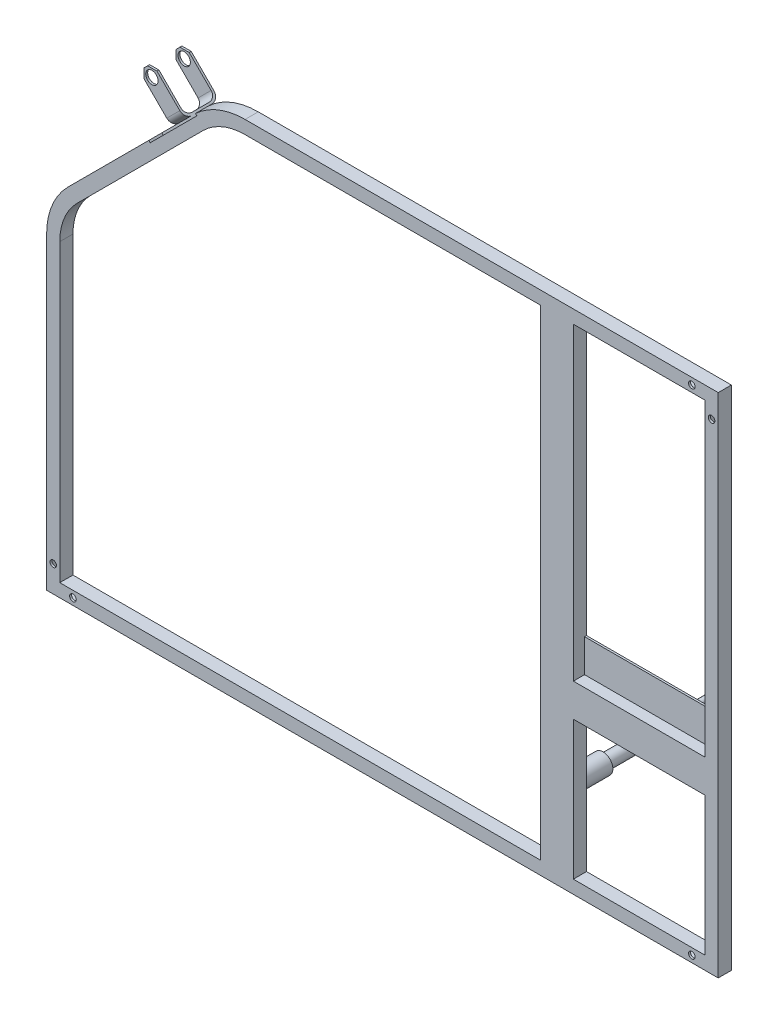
ISO-10303-21;
HEADER;
FILE_DESCRIPTION(('STEP AP214'),'2;1');
FILE_NAME('part.step','',(''),(''),'','','');
FILE_SCHEMA(('AUTOMOTIVE_DESIGN { 1 0 10303 214 1 1 1 1 }'));
ENDSEC;
DATA;
#1=APPLICATION_CONTEXT('core data for automotive mechanical design processes');
#2=APPLICATION_PROTOCOL_DEFINITION('international standard','automotive_design',2000,#1);
#3=PRODUCT_CONTEXT('',#1,'mechanical');
#4=PRODUCT('Part','Part','',(#3));
#5=PRODUCT_RELATED_PRODUCT_CATEGORY('part','',(#4));
#6=PRODUCT_DEFINITION_FORMATION('','',#4);
#7=PRODUCT_DEFINITION_CONTEXT('part definition',#1,'design');
#8=PRODUCT_DEFINITION('design','',#6,#7);
#9=PRODUCT_DEFINITION_SHAPE('','',#8);
#10=(LENGTH_UNIT() NAMED_UNIT(*) SI_UNIT(.MILLI.,.METRE.));
#11=(NAMED_UNIT(*) PLANE_ANGLE_UNIT() SI_UNIT($,.RADIAN.));
#12=(NAMED_UNIT(*) SI_UNIT($,.STERADIAN.) SOLID_ANGLE_UNIT());
#13=UNCERTAINTY_MEASURE_WITH_UNIT(LENGTH_MEASURE(1.E-05),#10,'distance_accuracy_value','');
#14=(GEOMETRIC_REPRESENTATION_CONTEXT(3) GLOBAL_UNCERTAINTY_ASSIGNED_CONTEXT((#13)) GLOBAL_UNIT_ASSIGNED_CONTEXT((#10,
#11,#12)) REPRESENTATION_CONTEXT('',''));
#15=CARTESIAN_POINT('',(0.,0.,0.));
#16=DIRECTION('',(0.,0.,1.));
#17=DIRECTION('',(1.,0.,0.));
#18=AXIS2_PLACEMENT_3D('',#15,#16,#17);
#19=CARTESIAN_POINT('',(-1056.56854249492,10.0000000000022,-9.99999999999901));
#20=DIRECTION('',(0.,0.,1.));
#21=DIRECTION('',(-0.999999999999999,0.,0.));
#22=AXIS2_PLACEMENT_3D('',#19,#20,#21);
#23=PLANE('',#22);
#24=CARTESIAN_POINT('',(-1000.,29.9999999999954,-9.99999999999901));
#25=DIRECTION('',(0.,0.,-1.));
#26=DIRECTION('',(-0.999999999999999,0.,0.));
#27=AXIS2_PLACEMENT_3D('',#24,#25,#26);
#28=CIRCLE('',#27,4.90359405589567);
#29=CARTESIAN_POINT('',(-1004.9035940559,29.9999999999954,-9.99999999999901));
#30=VERTEX_POINT('',#29);
#31=EDGE_CURVE('E1204',#30,#30,#28,.T.);
#32=ORIENTED_EDGE('',*,*,#31,.T.);
#33=EDGE_LOOP('',(#32));
#34=FACE_BOUND('',#33,.T.);
#35=CARTESIAN_POINT('',(-30.000000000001,2.22044604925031E-12,-10.));
#36=DIRECTION('',(0.,0.,-1.));
#37=DIRECTION('',(-0.999999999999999,0.,0.));
#38=AXIS2_PLACEMENT_3D('',#35,#36,#37);
#39=CIRCLE('',#38,5.);
#40=CARTESIAN_POINT('',(-25.0000000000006,0.,-10.));
#41=VERTEX_POINT('',#40);
#42=EDGE_CURVE('E1208',#41,#41,#39,.T.);
#43=ORIENTED_EDGE('',*,*,#42,.T.);
#44=EDGE_LOOP('',(#43));
#45=FACE_BOUND('',#44,.T.);
#46=CARTESIAN_POINT('',(0.,720.,-10.));
#47=DIRECTION('',(0.,0.,-1.));
#48=DIRECTION('',(-0.999999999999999,0.,0.));
#49=AXIS2_PLACEMENT_3D('',#46,#47,#48);
#50=CIRCLE('',#49,5.);
#51=CARTESIAN_POINT('',(5.,720.,-10.));
#52=VERTEX_POINT('',#51);
#53=EDGE_CURVE('E1212',#52,#52,#50,.T.);
#54=ORIENTED_EDGE('',*,*,#53,.T.);
#55=EDGE_LOOP('',(#54));
#56=FACE_BOUND('',#55,.T.);
#57=CARTESIAN_POINT('',(-969.999999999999,1.11022302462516E-12,-9.99999999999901));
#58=DIRECTION('',(0.,0.,-1.));
#59=DIRECTION('',(-0.999999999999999,0.,0.));
#60=AXIS2_PLACEMENT_3D('',#57,#58,#59);
#61=CIRCLE('',#60,5.00000000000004);
#62=CARTESIAN_POINT('',(-964.999999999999,1.10883524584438E-12,-9.99999999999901));
#63=VERTEX_POINT('',#62);
#64=EDGE_CURVE('E1216',#63,#63,#61,.T.);
#65=ORIENTED_EDGE('',*,*,#64,.T.);
#66=EDGE_LOOP('',(#65));
#67=FACE_BOUND('',#66,.T.);
#68=CARTESIAN_POINT('',(-30.0000000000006,750.,-9.99999999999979));
#69=DIRECTION('',(0.,0.,-1.));
#70=DIRECTION('',(-0.999999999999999,0.,0.));
#71=AXIS2_PLACEMENT_3D('',#68,#69,#70);
#72=CIRCLE('',#71,5.);
#73=CARTESIAN_POINT('',(-25.0000000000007,750.,-9.99999999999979));
#74=VERTEX_POINT('',#73);
#75=EDGE_CURVE('E478',#74,#74,#72,.T.);
#76=ORIENTED_EDGE('',*,*,#75,.T.);
#77=EDGE_LOOP('',(#76));
#78=FACE_BOUND('',#77,.T.);
#79=DIRECTION('',(0.,-1.,0.));
#80=VECTOR('',#79,1.);
#81=CARTESIAN_POINT('',(-10.0000000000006,740.000000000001,-10.));
#82=LINE('',#81,#80);
#83=CARTESIAN_POINT('',(-10.0000000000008,220.455625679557,-10.));
#84=VERTEX_POINT('',#83);
#85=CARTESIAN_POINT('',(-10.0000000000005,10.0000000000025,-10.));
#86=VERTEX_POINT('',#85);
#87=EDGE_CURVE('E793',#84,#86,#82,.T.);
#88=ORIENTED_EDGE('',*,*,#87,.T.);
#89=DIRECTION('',(0.999999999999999,0.,0.));
#90=VECTOR('',#89,1.);
#91=CARTESIAN_POINT('',(-1056.56854249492,10.0000000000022,-9.99999999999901));
#92=LINE('',#91,#90);
#93=CARTESIAN_POINT('',(-210.000000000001,10.0000000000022,-10.));
#94=VERTEX_POINT('',#93);
#95=EDGE_CURVE('E1053',#94,#86,#92,.T.);
#96=ORIENTED_EDGE('',*,*,#95,.F.);
#97=DIRECTION('',(0.,1.,0.));
#98=VECTOR('',#97,1.);
#99=CARTESIAN_POINT('',(-209.999999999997,-500000.,-10.));
#100=LINE('',#99,#98);
#101=CARTESIAN_POINT('',(-209.999999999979,220.455625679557,-10.));
#102=VERTEX_POINT('',#101);
#103=EDGE_CURVE('E777',#94,#102,#100,.T.);
#104=ORIENTED_EDGE('',*,*,#103,.T.);
#105=DIRECTION('',(0.999999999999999,0.,0.));
#106=VECTOR('',#105,1.);
#107=CARTESIAN_POINT('',(-500000.,220.455625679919,-9.99999999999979));
#108=LINE('',#107,#106);
#109=EDGE_CURVE('E720',#102,#84,#108,.T.);
#110=ORIENTED_EDGE('',*,*,#109,.T.);
#111=EDGE_LOOP('',(#88,#96,#104,#110));
#112=FACE_BOUND('',#111,.T.);
#113=DIRECTION('',(0.,-1.,0.));
#114=VECTOR('',#113,1.);
#115=CARTESIAN_POINT('',(9.99999999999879,760.000000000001,-9.99999999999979));
#116=LINE('',#115,#114);
#117=CARTESIAN_POINT('',(9.99999999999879,760.000000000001,-9.99999999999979));
#118=VERTEX_POINT('',#117);
#119=CARTESIAN_POINT('',(9.99999999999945,-9.99999999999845,-10.));
#120=VERTEX_POINT('',#119);
#121=EDGE_CURVE('E991',#118,#120,#116,.T.);
#122=ORIENTED_EDGE('',*,*,#121,.F.);
#123=DIRECTION('',(0.999999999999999,0.,0.));
#124=VECTOR('',#123,1.);
#125=CARTESIAN_POINT('',(-708.57864376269,760.,-10.));
#126=LINE('',#125,#124);
#127=CARTESIAN_POINT('',(-708.57864376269,760.,-10.));
#128=VERTEX_POINT('',#127);
#129=EDGE_CURVE('E952',#128,#118,#126,.T.);
#130=ORIENTED_EDGE('',*,*,#129,.F.);
#131=CARTESIAN_POINT('',(-708.578643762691,649.999999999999,-10.));
#132=DIRECTION('',(0.,0.,-1.));
#133=DIRECTION('',(-0.999999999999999,0.,0.));
#134=AXIS2_PLACEMENT_3D('',#131,#132,#133);
#135=CIRCLE('',#134,110.);
#136=CARTESIAN_POINT('',(-783.923744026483,730.144343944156,-10.));
#137=VERTEX_POINT('',#136);
#138=EDGE_CURVE('E930',#137,#128,#135,.T.);
#139=ORIENTED_EDGE('',*,*,#138,.F.);
#140=DIRECTION('',(0.707106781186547,-0.707106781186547,0.));
#141=VECTOR('',#140,1.);
#142=CARTESIAN_POINT('',(-783.960767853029,730.181367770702,-10.));
#143=LINE('',#142,#141);
#144=CARTESIAN_POINT('',(-781.839447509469,728.060047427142,-10.));
#145=VERTEX_POINT('',#144);
#146=EDGE_CURVE('E511',#137,#145,#143,.T.);
#147=ORIENTED_EDGE('',*,*,#146,.T.);
#148=DIRECTION('',(-0.707106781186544,-0.707106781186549,0.));
#149=VECTOR('',#148,1.);
#150=CARTESIAN_POINT('',(-781.839447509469,728.060047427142,-10.));
#151=LINE('',#150,#149);
#152=CARTESIAN_POINT('',(-801.638437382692,708.261057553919,-10.));
#153=VERTEX_POINT('',#152);
#154=EDGE_CURVE('E514',#145,#153,#151,.T.);
#155=ORIENTED_EDGE('',*,*,#154,.T.);
#156=DIRECTION('',(-0.707106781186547,0.707106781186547,0.));
#157=VECTOR('',#156,1.);
#158=CARTESIAN_POINT('',(-801.638437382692,708.261057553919,-10.));
#159=LINE('',#158,#157);
#160=CARTESIAN_POINT('',(-803.759757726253,710.382377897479,-10.));
#161=VERTEX_POINT('',#160);
#162=EDGE_CURVE('E517',#153,#161,#159,.T.);
#163=ORIENTED_EDGE('',*,*,#162,.T.);
#164=DIRECTION('',(0.707106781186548,0.707106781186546,0.));
#165=VECTOR('',#164,1.);
#166=CARTESIAN_POINT('',(-977.78174593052,536.360389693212,-10.));
#167=LINE('',#166,#165);
#168=CARTESIAN_POINT('',(-977.78174593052,536.360389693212,-10.));
#169=VERTEX_POINT('',#168);
#170=EDGE_CURVE('E900',#169,#161,#167,.T.);
#171=ORIENTED_EDGE('',*,*,#170,.F.);
#172=CARTESIAN_POINT('',(-900.,458.578643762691,-10.));
#173=DIRECTION('',(0.,0.,-1.));
#174=DIRECTION('',(-0.999999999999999,0.,0.));
#175=AXIS2_PLACEMENT_3D('',#172,#173,#174);
#176=CIRCLE('',#175,110.);
#177=CARTESIAN_POINT('',(-1010.,458.578643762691,-9.99999999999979));
#178=VERTEX_POINT('',#177);
#179=EDGE_CURVE('E868',#178,#169,#176,.T.);
#180=ORIENTED_EDGE('',*,*,#179,.F.);
#181=DIRECTION('',(0.,1.,0.));
#182=VECTOR('',#181,1.);
#183=CARTESIAN_POINT('',(-1010.,-9.99999999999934,-9.99999999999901));
#184=LINE('',#183,#182);
#185=CARTESIAN_POINT('',(-1010.,-9.99999999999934,-9.99999999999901));
#186=VERTEX_POINT('',#185);
#187=EDGE_CURVE('E829',#186,#178,#184,.T.);
#188=ORIENTED_EDGE('',*,*,#187,.F.);
#189=DIRECTION('',(0.999999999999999,0.,0.));
#190=VECTOR('',#189,1.);
#191=CARTESIAN_POINT('',(-1056.56854249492,-9.99999999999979,-9.99999999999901));
#192=LINE('',#191,#190);
#193=EDGE_CURVE('E1075',#186,#120,#192,.T.);
#194=ORIENTED_EDGE('',*,*,#193,.T.);
#195=EDGE_LOOP('',(#122,#130,#139,#147,#155,#163,#171,#180,#188,#194));
#196=FACE_BOUND('',#195,.T.);
#197=DIRECTION('',(0.999999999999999,0.,0.));
#198=VECTOR('',#197,1.);
#199=CARTESIAN_POINT('',(-500000.,270.455625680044,-9.9999999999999));
#200=LINE('',#199,#198);
#201=CARTESIAN_POINT('',(-209.99999999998,270.455625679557,-10.));
#202=VERTEX_POINT('',#201);
#203=CARTESIAN_POINT('',(-10.,270.455625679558,-10.));
#204=VERTEX_POINT('',#203);
#205=EDGE_CURVE('E723',#202,#204,#200,.T.);
#206=ORIENTED_EDGE('',*,*,#205,.F.);
#207=CARTESIAN_POINT('',(-210.000000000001,740.,-10.));
#208=VERTEX_POINT('',#207);
#209=EDGE_CURVE('E780',#202,#208,#100,.T.);
#210=ORIENTED_EDGE('',*,*,#209,.T.);
#211=DIRECTION('',(0.999999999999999,0.,0.));
#212=VECTOR('',#211,1.);
#213=CARTESIAN_POINT('',(-708.578643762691,740.,-10.));
#214=LINE('',#213,#212);
#215=CARTESIAN_POINT('',(-10.0000000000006,740.000000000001,-10.));
#216=VERTEX_POINT('',#215);
#217=EDGE_CURVE('E955',#208,#216,#214,.T.);
#218=ORIENTED_EDGE('',*,*,#217,.T.);
#219=EDGE_CURVE('E1003',#216,#204,#82,.T.);
#220=ORIENTED_EDGE('',*,*,#219,.T.);
#221=EDGE_LOOP('',(#206,#210,#218,#220));
#222=FACE_BOUND('',#221,.T.);
#223=DIRECTION('',(0.,1.,0.));
#224=VECTOR('',#223,1.);
#225=CARTESIAN_POINT('',(-989.999999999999,10.0000000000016,-9.99999999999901));
#226=LINE('',#225,#224);
#227=CARTESIAN_POINT('',(-989.999999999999,10.0000000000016,-9.99999999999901));
#228=VERTEX_POINT('',#227);
#229=CARTESIAN_POINT('',(-990.,458.57864376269,-10.));
#230=VERTEX_POINT('',#229);
#231=EDGE_CURVE('E832',#228,#230,#226,.T.);
#232=ORIENTED_EDGE('',*,*,#231,.T.);
#233=CARTESIAN_POINT('',(-900.,458.578643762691,-10.));
#234=DIRECTION('',(0.,0.,-1.));
#235=DIRECTION('',(-0.999999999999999,0.,0.));
#236=AXIS2_PLACEMENT_3D('',#233,#234,#235);
#237=CIRCLE('',#236,90.);
#238=CARTESIAN_POINT('',(-963.639610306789,522.21825406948,-9.99999999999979));
#239=VERTEX_POINT('',#238);
#240=EDGE_CURVE('E871',#230,#239,#237,.T.);
#241=ORIENTED_EDGE('',*,*,#240,.T.);
#242=DIRECTION('',(0.707106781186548,0.707106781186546,0.));
#243=VECTOR('',#242,1.);
#244=CARTESIAN_POINT('',(-963.639610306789,522.21825406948,-9.99999999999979));
#245=LINE('',#244,#243);
#246=CARTESIAN_POINT('',(-772.21825406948,713.639610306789,-10.));
#247=VERTEX_POINT('',#246);
#248=EDGE_CURVE('E903',#239,#247,#245,.T.);
#249=ORIENTED_EDGE('',*,*,#248,.T.);
#250=CARTESIAN_POINT('',(-708.578643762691,649.999999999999,-10.));
#251=DIRECTION('',(0.,0.,-1.));
#252=DIRECTION('',(-0.999999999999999,0.,0.));
#253=AXIS2_PLACEMENT_3D('',#250,#251,#252);
#254=CIRCLE('',#253,89.9999999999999);
#255=CARTESIAN_POINT('',(-708.578643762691,740.,-10.));
#256=VERTEX_POINT('',#255);
#257=EDGE_CURVE('E934',#247,#256,#254,.T.);
#258=ORIENTED_EDGE('',*,*,#257,.T.);
#259=CARTESIAN_POINT('',(-260.000000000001,740.,-9.9999999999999));
#260=VERTEX_POINT('',#259);
#261=EDGE_CURVE('E800',#256,#260,#214,.T.);
#262=ORIENTED_EDGE('',*,*,#261,.T.);
#263=DIRECTION('',(0.,1.,0.));
#264=VECTOR('',#263,1.);
#265=CARTESIAN_POINT('',(-260.000000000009,-500000.,-10.));
#266=LINE('',#265,#264);
#267=CARTESIAN_POINT('',(-260.,10.000000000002,-9.9999999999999));
#268=VERTEX_POINT('',#267);
#269=EDGE_CURVE('E758',#268,#260,#266,.T.);
#270=ORIENTED_EDGE('',*,*,#269,.F.);
#271=EDGE_CURVE('E1081',#228,#268,#92,.T.);
#272=ORIENTED_EDGE('',*,*,#271,.F.);
#273=EDGE_LOOP('',(#232,#241,#249,#258,#262,#270,#272));
#274=FACE_BOUND('',#273,.T.);
#275=ADVANCED_FACE('F27',(#34,#45,#56,#67,#78,#112,#196,#222,#274),#23,.T.);
#276=CARTESIAN_POINT('',(-783.960767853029,730.181367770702,-35.0000000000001));
#277=DIRECTION('',(-0.707106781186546,0.707106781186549,0.));
#278=DIRECTION('',(-0.707106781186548,-0.707106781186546,0.));
#279=AXIS2_PLACEMENT_3D('',#276,#277,#278);
#280=PLANE('',#279);
#281=DIRECTION('',(0.707106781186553,0.707106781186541,0.));
#282=VECTOR('',#281,1.);
#283=CARTESIAN_POINT('',(-803.759757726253,710.382377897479,-10.));
#284=LINE('',#283,#282);
#285=CARTESIAN_POINT('',(-786.360389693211,727.78174593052,-10.));
#286=VERTEX_POINT('',#285);
#287=CARTESIAN_POINT('',(-783.960767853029,730.181367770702,-10.));
#288=VERTEX_POINT('',#287);
#289=EDGE_CURVE('E508',#286,#288,#284,.T.);
#290=ORIENTED_EDGE('',*,*,#289,.F.);
#291=DIRECTION('',(0.,0.,-1.));
#292=VECTOR('',#291,1.);
#293=CARTESIAN_POINT('',(-786.360389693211,727.78174593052,-30.));
#294=LINE('',#293,#292);
#295=CARTESIAN_POINT('',(-786.360389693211,727.78174593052,-30.));
#296=VERTEX_POINT('',#295);
#297=EDGE_CURVE('E883',#286,#296,#294,.T.);
#298=ORIENTED_EDGE('',*,*,#297,.T.);
#299=DIRECTION('',(0.707106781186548,0.707106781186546,0.));
#300=VECTOR('',#299,1.);
#301=CARTESIAN_POINT('',(-977.781745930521,536.360389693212,-30.));
#302=LINE('',#301,#300);
#303=CARTESIAN_POINT('',(-803.759757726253,710.382377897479,-30.));
#304=VERTEX_POINT('',#303);
#305=EDGE_CURVE('E896',#304,#296,#302,.T.);
#306=ORIENTED_EDGE('',*,*,#305,.F.);
#307=DIRECTION('',(0.,0.,1.));
#308=VECTOR('',#307,1.);
#309=CARTESIAN_POINT('',(-803.759757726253,710.382377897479,-35.0000000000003));
#310=LINE('',#309,#308);
#311=CARTESIAN_POINT('',(-803.759757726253,710.382377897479,-35.0000000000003));
#312=VERTEX_POINT('',#311);
#313=EDGE_CURVE('E570',#312,#304,#310,.T.);
#314=ORIENTED_EDGE('',*,*,#313,.F.);
#315=DIRECTION('',(-0.707106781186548,-0.707106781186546,0.));
#316=VECTOR('',#315,1.);
#317=CARTESIAN_POINT('',(-783.960767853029,730.181367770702,-35.0000000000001));
#318=LINE('',#317,#316);
#319=CARTESIAN_POINT('',(-783.960767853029,730.181367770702,-35.0000000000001));
#320=VERTEX_POINT('',#319);
#321=EDGE_CURVE('E617',#320,#312,#318,.T.);
#322=ORIENTED_EDGE('',*,*,#321,.F.);
#323=DIRECTION('',(0.,0.,1.));
#324=VECTOR('',#323,1.);
#325=CARTESIAN_POINT('',(-783.960767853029,730.181367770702,-35.0000000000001));
#326=LINE('',#325,#324);
#327=EDGE_CURVE('E599',#320,#288,#326,.T.);
#328=ORIENTED_EDGE('',*,*,#327,.T.);
#329=EDGE_LOOP('',(#290,#298,#306,#314,#322,#328));
#330=FACE_BOUND('',#329,.T.);
#331=ADVANCED_FACE('F1194',(#330),#280,.F.);
#332=CARTESIAN_POINT('',(-110.,245.455625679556,-95.));
#333=DIRECTION('',(0.,0.,-1.));
#334=DIRECTION('',(0.999999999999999,0.,0.));
#335=AXIS2_PLACEMENT_3D('',#332,#333,#334);
#336=PLANE('',#335);
#337=CARTESIAN_POINT('',(-110.,245.455625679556,-95.));
#338=DIRECTION('',(0.,0.,1.));
#339=DIRECTION('',(0.999999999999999,0.,0.));
#340=AXIS2_PLACEMENT_3D('',#337,#338,#339);
#341=CIRCLE('',#340,10.);
#342=CARTESIAN_POINT('',(-99.9999999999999,245.455625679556,-95.));
#343=VERTEX_POINT('',#342);
#344=EDGE_CURVE('E648',#343,#343,#341,.T.);
#345=ORIENTED_EDGE('',*,*,#344,.F.);
#346=EDGE_LOOP('',(#345));
#347=FACE_BOUND('',#346,.T.);
#348=CARTESIAN_POINT('',(-110.,245.455625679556,-95.));
#349=DIRECTION('',(0.,0.,1.));
#350=DIRECTION('',(0.999999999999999,0.,0.));
#351=AXIS2_PLACEMENT_3D('',#348,#349,#350);
#352=CIRCLE('',#351,4.99999999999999);
#353=CARTESIAN_POINT('',(-105.,245.455625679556,-95.));
#354=VERTEX_POINT('',#353);
#355=EDGE_CURVE('E644',#354,#354,#352,.T.);
#356=ORIENTED_EDGE('',*,*,#355,.T.);
#357=EDGE_LOOP('',(#356));
#358=FACE_BOUND('',#357,.T.);
#359=ADVANCED_FACE('F1120',(#347,#358),#336,.T.);
#360=CARTESIAN_POINT('',(-1056.56854249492,10.0000000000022,-29.999999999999));
#361=DIRECTION('',(0.,0.,-1.));
#362=DIRECTION('',(0.999999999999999,0.,0.));
#363=AXIS2_PLACEMENT_3D('',#360,#361,#362);
#364=PLANE('',#363);
#365=CARTESIAN_POINT('',(-1000.,29.9999999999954,-29.999999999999));
#366=DIRECTION('',(0.,0.,1.));
#367=DIRECTION('',(0.999999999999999,0.,0.));
#368=AXIS2_PLACEMENT_3D('',#365,#366,#367);
#369=CIRCLE('',#368,4.90359405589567);
#370=CARTESIAN_POINT('',(-1004.9035940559,29.9999999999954,-29.999999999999));
#371=VERTEX_POINT('',#370);
#372=EDGE_CURVE('E1574',#371,#371,#369,.T.);
#373=ORIENTED_EDGE('',*,*,#372,.T.);
#374=EDGE_LOOP('',(#373));
#375=FACE_BOUND('',#374,.T.);
#376=CARTESIAN_POINT('',(-30.0000000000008,2.22044604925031E-12,-30.));
#377=DIRECTION('',(0.,0.,1.));
#378=DIRECTION('',(0.999999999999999,0.,0.));
#379=AXIS2_PLACEMENT_3D('',#376,#377,#378);
#380=CIRCLE('',#379,5.);
#381=CARTESIAN_POINT('',(-25.0000000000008,2.21905827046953E-12,-30.));
#382=VERTEX_POINT('',#381);
#383=EDGE_CURVE('E1553',#382,#382,#380,.T.);
#384=ORIENTED_EDGE('',*,*,#383,.T.);
#385=EDGE_LOOP('',(#384));
#386=FACE_BOUND('',#385,.T.);
#387=CARTESIAN_POINT('',(0.,720.,-29.9999999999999));
#388=DIRECTION('',(0.,0.,1.));
#389=DIRECTION('',(0.999999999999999,0.,0.));
#390=AXIS2_PLACEMENT_3D('',#387,#388,#389);
#391=CIRCLE('',#390,5.);
#392=CARTESIAN_POINT('',(5.,720.,-29.9999999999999));
#393=VERTEX_POINT('',#392);
#394=EDGE_CURVE('E1548',#393,#393,#391,.T.);
#395=ORIENTED_EDGE('',*,*,#394,.T.);
#396=EDGE_LOOP('',(#395));
#397=FACE_BOUND('',#396,.T.);
#398=CARTESIAN_POINT('',(-969.999999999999,8.88178419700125E-13,-29.999999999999));
#399=DIRECTION('',(0.,0.,1.));
#400=DIRECTION('',(0.999999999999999,0.,0.));
#401=AXIS2_PLACEMENT_3D('',#398,#399,#400);
#402=CIRCLE('',#401,5.00000000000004);
#403=CARTESIAN_POINT('',(-964.999999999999,8.86790640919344E-13,-29.999999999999));
#404=VERTEX_POINT('',#403);
#405=EDGE_CURVE('E1543',#404,#404,#402,.T.);
#406=ORIENTED_EDGE('',*,*,#405,.T.);
#407=EDGE_LOOP('',(#406));
#408=FACE_BOUND('',#407,.T.);
#409=CARTESIAN_POINT('',(-30.0000000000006,750.,-29.9999999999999));
#410=DIRECTION('',(0.,0.,1.));
#411=DIRECTION('',(0.999999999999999,0.,0.));
#412=AXIS2_PLACEMENT_3D('',#409,#410,#411);
#413=CIRCLE('',#412,5.);
#414=CARTESIAN_POINT('',(-25.0000000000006,750.,-29.9999999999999));
#415=VERTEX_POINT('',#414);
#416=EDGE_CURVE('E1538',#415,#415,#413,.T.);
#417=ORIENTED_EDGE('',*,*,#416,.T.);
#418=EDGE_LOOP('',(#417));
#419=FACE_BOUND('',#418,.T.);
#420=DIRECTION('',(0.,-1.,0.));
#421=VECTOR('',#420,1.);
#422=CARTESIAN_POINT('',(-10.0000000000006,740.000000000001,-29.9999999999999));
#423=LINE('',#422,#421);
#424=CARTESIAN_POINT('',(-10.0000000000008,220.455625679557,-30.));
#425=VERTEX_POINT('',#424);
#426=CARTESIAN_POINT('',(-10.0000000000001,10.000000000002,-29.9999999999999));
#427=VERTEX_POINT('',#426);
#428=EDGE_CURVE('E1044',#425,#427,#423,.T.);
#429=ORIENTED_EDGE('',*,*,#428,.F.);
#430=DIRECTION('',(0.999999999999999,0.,0.));
#431=VECTOR('',#430,1.);
#432=CARTESIAN_POINT('',(-500000.,220.455625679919,-29.9999999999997));
#433=LINE('',#432,#431);
#434=CARTESIAN_POINT('',(-209.999999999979,220.455625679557,-30.));
#435=VERTEX_POINT('',#434);
#436=EDGE_CURVE('E696',#435,#425,#433,.T.);
#437=ORIENTED_EDGE('',*,*,#436,.F.);
#438=DIRECTION('',(0.,1.,0.));
#439=VECTOR('',#438,1.);
#440=CARTESIAN_POINT('',(-209.999999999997,-500000.,-30.));
#441=LINE('',#440,#439);
#442=CARTESIAN_POINT('',(-210.,9.99999999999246,-30.));
#443=VERTEX_POINT('',#442);
#444=EDGE_CURVE('E773',#443,#435,#441,.T.);
#445=ORIENTED_EDGE('',*,*,#444,.F.);
#446=DIRECTION('',(0.999999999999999,0.,0.));
#447=VECTOR('',#446,1.);
#448=CARTESIAN_POINT('',(-1056.56854249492,10.0000000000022,-29.999999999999));
#449=LINE('',#448,#447);
#450=EDGE_CURVE('E1094',#443,#427,#449,.T.);
#451=ORIENTED_EDGE('',*,*,#450,.T.);
#452=EDGE_LOOP('',(#429,#437,#445,#451));
#453=FACE_BOUND('',#452,.T.);
#454=DIRECTION('',(0.,1.,0.));
#455=VECTOR('',#454,1.);
#456=CARTESIAN_POINT('',(-108.677650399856,10.000000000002,-30.));
#457=LINE('',#456,#455);
#458=CARTESIAN_POINT('',(-108.677650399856,255.367809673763,-30.));
#459=VERTEX_POINT('',#458);
#460=CARTESIAN_POINT('',(-108.677650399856,314.00469601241,-30.));
#461=VERTEX_POINT('',#460);
#462=EDGE_CURVE('E497',#459,#461,#457,.T.);
#463=ORIENTED_EDGE('',*,*,#462,.T.);
#464=DIRECTION('',(-0.999999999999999,0.,0.));
#465=VECTOR('',#464,1.);
#466=CARTESIAN_POINT('',(-1056.56854249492,314.00469601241,-29.9999999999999));
#467=LINE('',#466,#465);
#468=CARTESIAN_POINT('',(-111.677650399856,314.004696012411,-30.));
#469=VERTEX_POINT('',#468);
#470=EDGE_CURVE('E500',#461,#469,#467,.T.);
#471=ORIENTED_EDGE('',*,*,#470,.T.);
#472=DIRECTION('',(0.,1.,0.));
#473=VECTOR('',#472,1.);
#474=CARTESIAN_POINT('',(-111.677650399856,10.0000000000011,-30.));
#475=LINE('',#474,#473);
#476=CARTESIAN_POINT('',(-111.677650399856,255.313895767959,-30.));
#477=VERTEX_POINT('',#476);
#478=EDGE_CURVE('E476',#477,#469,#475,.T.);
#479=ORIENTED_EDGE('',*,*,#478,.F.);
#480=CARTESIAN_POINT('',(-110.,245.455625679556,-30.));
#481=DIRECTION('',(0.,0.,1.));
#482=DIRECTION('',(0.999999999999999,0.,0.));
#483=AXIS2_PLACEMENT_3D('',#480,#481,#482);
#484=CIRCLE('',#483,10.);
#485=EDGE_CURVE('E490',#477,#459,#484,.T.);
#486=ORIENTED_EDGE('',*,*,#485,.T.);
#487=EDGE_LOOP('',(#463,#471,#479,#486));
#488=FACE_BOUND('',#487,.T.);
#489=DIRECTION('',(0.999999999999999,0.,0.));
#490=VECTOR('',#489,1.);
#491=CARTESIAN_POINT('',(-1056.56854249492,-9.99999999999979,-29.999999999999));
#492=LINE('',#491,#490);
#493=CARTESIAN_POINT('',(-1010.,-9.99999999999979,-29.999999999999));
#494=VERTEX_POINT('',#493);
#495=CARTESIAN_POINT('',(10.,-9.99999999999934,-30.));
#496=VERTEX_POINT('',#495);
#497=EDGE_CURVE('E1078',#494,#496,#492,.T.);
#498=ORIENTED_EDGE('',*,*,#497,.F.);
#499=DIRECTION('',(0.,1.,0.));
#500=VECTOR('',#499,1.);
#501=CARTESIAN_POINT('',(-1010.,-9.99999999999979,-29.999999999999));
#502=LINE('',#501,#500);
#503=CARTESIAN_POINT('',(-1010.,458.578643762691,-29.9999999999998));
#504=VERTEX_POINT('',#503);
#505=EDGE_CURVE('E826',#494,#504,#502,.T.);
#506=ORIENTED_EDGE('',*,*,#505,.T.);
#507=CARTESIAN_POINT('',(-900.,458.578643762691,-30.));
#508=DIRECTION('',(0.,0.,-1.));
#509=DIRECTION('',(-0.999999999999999,0.,0.));
#510=AXIS2_PLACEMENT_3D('',#507,#508,#509);
#511=CIRCLE('',#510,110.);
#512=CARTESIAN_POINT('',(-977.781745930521,536.360389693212,-30.));
#513=VERTEX_POINT('',#512);
#514=EDGE_CURVE('E865',#504,#513,#511,.T.);
#515=ORIENTED_EDGE('',*,*,#514,.T.);
#516=EDGE_CURVE('E897',#513,#304,#302,.T.);
#517=ORIENTED_EDGE('',*,*,#516,.T.);
#518=ORIENTED_EDGE('',*,*,#305,.T.);
#519=CARTESIAN_POINT('',(-708.578643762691,649.999999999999,-30.));
#520=DIRECTION('',(0.,0.,-1.));
#521=DIRECTION('',(-0.999999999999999,0.,0.));
#522=AXIS2_PLACEMENT_3D('',#519,#520,#521);
#523=CIRCLE('',#522,110.);
#524=CARTESIAN_POINT('',(-708.57864376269,760.000000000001,-30.));
#525=VERTEX_POINT('',#524);
#526=EDGE_CURVE('E927',#296,#525,#523,.T.);
#527=ORIENTED_EDGE('',*,*,#526,.T.);
#528=DIRECTION('',(0.999999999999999,0.,0.));
#529=VECTOR('',#528,1.);
#530=CARTESIAN_POINT('',(-708.57864376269,760.000000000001,-30.));
#531=LINE('',#530,#529);
#532=CARTESIAN_POINT('',(9.99999999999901,760.,-29.9999999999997));
#533=VERTEX_POINT('',#532);
#534=EDGE_CURVE('E949',#525,#533,#531,.T.);
#535=ORIENTED_EDGE('',*,*,#534,.T.);
#536=DIRECTION('',(0.,-1.,0.));
#537=VECTOR('',#536,1.);
#538=CARTESIAN_POINT('',(9.99999999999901,760.,-29.9999999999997));
#539=LINE('',#538,#537);
#540=EDGE_CURVE('E1031',#533,#496,#539,.T.);
#541=ORIENTED_EDGE('',*,*,#540,.T.);
#542=EDGE_LOOP('',(#498,#506,#515,#517,#518,#527,#535,#541));
#543=FACE_BOUND('',#542,.T.);
#544=CARTESIAN_POINT('',(-235.000000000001,115.,-30.));
#545=DIRECTION('',(0.,0.,1.));
#546=DIRECTION('',(0.999999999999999,0.,0.));
#547=AXIS2_PLACEMENT_3D('',#544,#545,#546);
#548=CIRCLE('',#547,15.0000000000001);
#549=CARTESIAN_POINT('',(-220.000000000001,115.,-30.));
#550=VERTEX_POINT('',#549);
#551=EDGE_CURVE('E679',#550,#550,#548,.T.);
#552=ORIENTED_EDGE('',*,*,#551,.T.);
#553=EDGE_LOOP('',(#552));
#554=FACE_BOUND('',#553,.T.);
#555=CARTESIAN_POINT('',(-989.999999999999,10.0000000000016,-29.999999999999));
#556=VERTEX_POINT('',#555);
#557=CARTESIAN_POINT('',(-260.,10.0000000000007,-29.9999999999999));
#558=VERTEX_POINT('',#557);
#559=EDGE_CURVE('E823',#556,#558,#449,.T.);
#560=ORIENTED_EDGE('',*,*,#559,.T.);
#561=DIRECTION('',(0.,1.,0.));
#562=VECTOR('',#561,1.);
#563=CARTESIAN_POINT('',(-260.000000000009,-500000.,-30.));
#564=LINE('',#563,#562);
#565=CARTESIAN_POINT('',(-260.000000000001,740.,-29.9999999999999));
#566=VERTEX_POINT('',#565);
#567=EDGE_CURVE('E770',#558,#566,#564,.T.);
#568=ORIENTED_EDGE('',*,*,#567,.T.);
#569=DIRECTION('',(0.999999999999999,0.,0.));
#570=VECTOR('',#569,1.);
#571=CARTESIAN_POINT('',(-708.57864376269,740.,-30.));
#572=LINE('',#571,#570);
#573=CARTESIAN_POINT('',(-708.57864376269,740.,-30.));
#574=VERTEX_POINT('',#573);
#575=EDGE_CURVE('E946',#574,#566,#572,.T.);
#576=ORIENTED_EDGE('',*,*,#575,.F.);
#577=CARTESIAN_POINT('',(-708.578643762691,649.999999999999,-30.));
#578=DIRECTION('',(0.,0.,-1.));
#579=DIRECTION('',(-0.999999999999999,0.,0.));
#580=AXIS2_PLACEMENT_3D('',#577,#578,#579);
#581=CIRCLE('',#580,90.);
#582=CARTESIAN_POINT('',(-772.21825406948,713.639610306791,-30.));
#583=VERTEX_POINT('',#582);
#584=EDGE_CURVE('E918',#583,#574,#581,.T.);
#585=ORIENTED_EDGE('',*,*,#584,.F.);
#586=DIRECTION('',(0.707106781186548,0.707106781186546,0.));
#587=VECTOR('',#586,1.);
#588=CARTESIAN_POINT('',(-963.639610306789,522.218254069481,-29.9999999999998));
#589=LINE('',#588,#587);
#590=CARTESIAN_POINT('',(-963.639610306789,522.218254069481,-29.9999999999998));
#591=VERTEX_POINT('',#590);
#592=EDGE_CURVE('E887',#591,#583,#589,.T.);
#593=ORIENTED_EDGE('',*,*,#592,.F.);
#594=CARTESIAN_POINT('',(-900.,458.578643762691,-30.));
#595=DIRECTION('',(0.,0.,-1.));
#596=DIRECTION('',(-0.999999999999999,0.,0.));
#597=AXIS2_PLACEMENT_3D('',#594,#595,#596);
#598=CIRCLE('',#597,90.);
#599=CARTESIAN_POINT('',(-990.,458.578643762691,-30.));
#600=VERTEX_POINT('',#599);
#601=EDGE_CURVE('E856',#600,#591,#598,.T.);
#602=ORIENTED_EDGE('',*,*,#601,.F.);
#603=DIRECTION('',(0.,1.,0.));
#604=VECTOR('',#603,1.);
#605=CARTESIAN_POINT('',(-989.999999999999,10.0000000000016,-29.999999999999));
#606=LINE('',#605,#604);
#607=EDGE_CURVE('E818',#556,#600,#606,.T.);
#608=ORIENTED_EDGE('',*,*,#607,.F.);
#609=EDGE_LOOP('',(#560,#568,#576,#585,#593,#602,#608));
#610=FACE_BOUND('',#609,.T.);
#611=CARTESIAN_POINT('',(-10.0000000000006,740.000000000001,-29.9999999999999));
#612=VERTEX_POINT('',#611);
#613=CARTESIAN_POINT('',(-10.0000000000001,320.455625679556,-30.));
#614=VERTEX_POINT('',#613);
#615=EDGE_CURVE('E1039',#612,#614,#423,.T.);
#616=ORIENTED_EDGE('',*,*,#615,.F.);
#617=CARTESIAN_POINT('',(-210.000000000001,740.,-29.9999999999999));
#618=VERTEX_POINT('',#617);
#619=EDGE_CURVE('E945',#618,#612,#572,.T.);
#620=ORIENTED_EDGE('',*,*,#619,.F.);
#621=CARTESIAN_POINT('',(-210.,320.455625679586,-30.));
#622=VERTEX_POINT('',#621);
#623=EDGE_CURVE('E776',#622,#618,#441,.T.);
#624=ORIENTED_EDGE('',*,*,#623,.F.);
#625=DIRECTION('',(0.999999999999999,0.,0.));
#626=VECTOR('',#625,1.);
#627=CARTESIAN_POINT('',(-500000.,320.45562567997,-29.9999999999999));
#628=LINE('',#627,#626);
#629=EDGE_CURVE('E663',#622,#614,#628,.T.);
#630=ORIENTED_EDGE('',*,*,#629,.T.);
#631=EDGE_LOOP('',(#616,#620,#624,#630));
#632=FACE_BOUND('',#631,.T.);
#633=ADVANCED_FACE('F1116',(#375,#386,#397,#408,#419,#453,#488,#543,#554,#610,#632),#364,.T.);
#634=CARTESIAN_POINT('',(-10.0000000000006,740.000000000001,-29.9999999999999));
#635=DIRECTION('',(0.999999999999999,0.,0.));
#636=DIRECTION('',(0.,1.,0.));
#637=AXIS2_PLACEMENT_3D('',#634,#635,#636);
#638=PLANE('',#637);
#639=DIRECTION('',(0.,-1.,0.));
#640=VECTOR('',#639,1.);
#641=CARTESIAN_POINT('',(-10.,270.455625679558,-27.));
#642=LINE('',#641,#640);
#643=CARTESIAN_POINT('',(-10.0000000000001,320.455625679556,-27.));
#644=VERTEX_POINT('',#643);
#645=CARTESIAN_POINT('',(-10.,270.455625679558,-27.));
#646=VERTEX_POINT('',#645);
#647=EDGE_CURVE('E652',#644,#646,#642,.T.);
#648=ORIENTED_EDGE('',*,*,#647,.T.);
#649=DIRECTION('',(0.,0.,1.));
#650=VECTOR('',#649,1.);
#651=CARTESIAN_POINT('',(-10.,270.455625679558,-30.));
#652=LINE('',#651,#650);
#653=EDGE_CURVE('E689',#646,#204,#652,.T.);
#654=ORIENTED_EDGE('',*,*,#653,.T.);
#655=ORIENTED_EDGE('',*,*,#219,.F.);
#656=DIRECTION('',(0.,0.,-1.));
#657=VECTOR('',#656,1.);
#658=CARTESIAN_POINT('',(-10.0000000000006,740.000000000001,-29.9999999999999));
#659=LINE('',#658,#657);
#660=EDGE_CURVE('E794',#216,#612,#659,.T.);
#661=ORIENTED_EDGE('',*,*,#660,.T.);
#662=ORIENTED_EDGE('',*,*,#615,.T.);
#663=DIRECTION('',(0.,0.,1.));
#664=VECTOR('',#663,1.);
#665=CARTESIAN_POINT('',(-10.0000000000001,320.455625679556,-30.));
#666=LINE('',#665,#664);
#667=EDGE_CURVE('E655',#614,#644,#666,.T.);
#668=ORIENTED_EDGE('',*,*,#667,.T.);
#669=EDGE_LOOP('',(#648,#654,#655,#661,#662,#668));
#670=FACE_BOUND('',#669,.T.);
#671=ADVANCED_FACE('F1119',(#670),#638,.F.);
#672=CARTESIAN_POINT('',(-209.999999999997,-500000.,-30.));
#673=DIRECTION('',(-0.999999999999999,0.,0.));
#674=DIRECTION('',(0.,0.,-1.));
#675=AXIS2_PLACEMENT_3D('',#672,#673,#674);
#676=PLANE('',#675);
#677=DIRECTION('',(0.,-1.,0.));
#678=VECTOR('',#677,1.);
#679=CARTESIAN_POINT('',(-209.999999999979,270.455625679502,-27.));
#680=LINE('',#679,#678);
#681=CARTESIAN_POINT('',(-210.,320.455625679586,-27.));
#682=VERTEX_POINT('',#681);
#683=CARTESIAN_POINT('',(-209.99999999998,270.455625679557,-27.));
#684=VERTEX_POINT('',#683);
#685=EDGE_CURVE('E651',#682,#684,#680,.T.);
#686=ORIENTED_EDGE('',*,*,#685,.F.);
#687=DIRECTION('',(0.,0.,1.));
#688=VECTOR('',#687,1.);
#689=CARTESIAN_POINT('',(-209.99999999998,320.455625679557,-30.));
#690=LINE('',#689,#688);
#691=EDGE_CURVE('E660',#622,#682,#690,.T.);
#692=ORIENTED_EDGE('',*,*,#691,.F.);
#693=ORIENTED_EDGE('',*,*,#623,.T.);
#694=DIRECTION('',(0.,0.,-1.));
#695=VECTOR('',#694,1.);
#696=CARTESIAN_POINT('',(-210.000000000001,740.,-29.9999999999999));
#697=LINE('',#696,#695);
#698=EDGE_CURVE('E737',#208,#618,#697,.T.);
#699=ORIENTED_EDGE('',*,*,#698,.F.);
#700=ORIENTED_EDGE('',*,*,#209,.F.);
#701=DIRECTION('',(0.,0.,1.));
#702=VECTOR('',#701,1.);
#703=CARTESIAN_POINT('',(-209.99999999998,270.455625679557,-30.));
#704=LINE('',#703,#702);
#705=EDGE_CURVE('E715',#684,#202,#704,.T.);
#706=ORIENTED_EDGE('',*,*,#705,.F.);
#707=EDGE_LOOP('',(#686,#692,#693,#699,#700,#706));
#708=FACE_BOUND('',#707,.T.);
#709=ADVANCED_FACE('F1279',(#708),#676,.F.);
#710=CARTESIAN_POINT('',(-500000.,270.455625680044,-29.9999999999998));
#711=DIRECTION('',(0.,-1.,0.));
#712=DIRECTION('',(0.999999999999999,0.,0.));
#713=AXIS2_PLACEMENT_3D('',#710,#711,#712);
#714=PLANE('',#713);
#715=ORIENTED_EDGE('',*,*,#653,.F.);
#716=DIRECTION('',(0.999999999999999,0.,0.));
#717=VECTOR('',#716,1.);
#718=CARTESIAN_POINT('',(-500000.,270.455625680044,-26.9999999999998));
#719=LINE('',#718,#717);
#720=EDGE_CURVE('E656',#684,#646,#719,.T.);
#721=ORIENTED_EDGE('',*,*,#720,.F.);
#722=ORIENTED_EDGE('',*,*,#705,.T.);
#723=ORIENTED_EDGE('',*,*,#205,.T.);
#724=EDGE_LOOP('',(#715,#721,#722,#723));
#725=FACE_BOUND('',#724,.T.);
#726=ADVANCED_FACE('F1306',(#725),#714,.F.);
#727=CARTESIAN_POINT('',(-235.,115.,-140.5));
#728=DIRECTION('',(0.,0.,-1.));
#729=DIRECTION('',(0.999999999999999,0.,0.));
#730=AXIS2_PLACEMENT_3D('',#727,#728,#729);
#731=PLANE('',#730);
#732=CARTESIAN_POINT('',(-235.,115.,-140.5));
#733=DIRECTION('',(0.,0.,1.));
#734=DIRECTION('',(0.999999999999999,0.,0.));
#735=AXIS2_PLACEMENT_3D('',#732,#733,#734);
#736=CIRCLE('',#735,10.0000000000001);
#737=CARTESIAN_POINT('',(-225.,115.,-140.5));
#738=VERTEX_POINT('',#737);
#739=EDGE_CURVE('E676',#738,#738,#736,.T.);
#740=ORIENTED_EDGE('',*,*,#739,.F.);
#741=EDGE_LOOP('',(#740));
#742=FACE_BOUND('',#741,.T.);
#743=CARTESIAN_POINT('',(-235.,115.,-140.5));
#744=DIRECTION('',(0.,0.,1.));
#745=DIRECTION('',(0.999999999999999,0.,0.));
#746=AXIS2_PLACEMENT_3D('',#743,#744,#745);
#747=CIRCLE('',#746,8.00000000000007);
#748=CARTESIAN_POINT('',(-227.,115.,-140.5));
#749=VERTEX_POINT('',#748);
#750=EDGE_CURVE('E659',#749,#749,#747,.T.);
#751=ORIENTED_EDGE('',*,*,#750,.T.);
#752=EDGE_LOOP('',(#751));
#753=FACE_BOUND('',#752,.T.);
#754=ADVANCED_FACE('F1309',(#742,#753),#731,.T.);
#755=CARTESIAN_POINT('',(-235.,115.,-80.));
#756=DIRECTION('',(0.,0.,-1.));
#757=DIRECTION('',(0.999999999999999,0.,0.));
#758=AXIS2_PLACEMENT_3D('',#755,#756,#757);
#759=PLANE('',#758);
#760=CARTESIAN_POINT('',(-235.,115.,-80.));
#761=DIRECTION('',(0.,0.,1.));
#762=DIRECTION('',(0.999999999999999,0.,0.));
#763=AXIS2_PLACEMENT_3D('',#760,#761,#762);
#764=CIRCLE('',#763,15.0000000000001);
#765=CARTESIAN_POINT('',(-220.,115.,-80.));
#766=VERTEX_POINT('',#765);
#767=EDGE_CURVE('E682',#766,#766,#764,.T.);
#768=ORIENTED_EDGE('',*,*,#767,.F.);
#769=EDGE_LOOP('',(#768));
#770=FACE_BOUND('',#769,.T.);
#771=CARTESIAN_POINT('',(-235.,115.,-80.));
#772=DIRECTION('',(0.,0.,1.));
#773=DIRECTION('',(0.999999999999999,0.,0.));
#774=AXIS2_PLACEMENT_3D('',#771,#772,#773);
#775=CIRCLE('',#774,10.0000000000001);
#776=CARTESIAN_POINT('',(-225.,115.,-80.));
#777=VERTEX_POINT('',#776);
#778=EDGE_CURVE('E673',#777,#777,#775,.T.);
#779=ORIENTED_EDGE('',*,*,#778,.T.);
#780=EDGE_LOOP('',(#779));
#781=FACE_BOUND('',#780,.T.);
#782=ADVANCED_FACE('F1318',(#770,#781),#759,.T.);
#783=DIRECTION('',(0.,0.,-1.));
#784=VECTOR('',#783,1.);
#785=CARTESIAN_POINT('',(-10.0000000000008,220.455625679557,-30.));
#786=LINE('',#785,#784);
#787=EDGE_CURVE('E686',#84,#425,#786,.T.);
#788=ORIENTED_EDGE('',*,*,#787,.T.);
#789=ORIENTED_EDGE('',*,*,#428,.T.);
#790=CARTESIAN_POINT('',(-9.99999999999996,10.0000000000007,-29.9999999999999));
#791=DIRECTION('',(0.,0.,1.));
#792=VECTOR('',#791,1.);
#793=LINE('',#790,#792);
#794=EDGE_CURVE('E967',#427,#86,#793,.T.);
#795=ORIENTED_EDGE('',*,*,#794,.T.);
#796=ORIENTED_EDGE('',*,*,#87,.F.);
#797=EDGE_LOOP('',(#788,#789,#795,#796));
#798=FACE_BOUND('',#797,.T.);
#799=ADVANCED_FACE('F1224',(#798),#638,.F.);
#800=DIRECTION('',(0.,0.,-1.));
#801=VECTOR('',#800,1.);
#802=CARTESIAN_POINT('',(-209.999999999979,220.455625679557,-30.));
#803=LINE('',#802,#801);
#804=EDGE_CURVE('E685',#102,#435,#803,.T.);
#805=ORIENTED_EDGE('',*,*,#804,.F.);
#806=ORIENTED_EDGE('',*,*,#103,.F.);
#807=DIRECTION('',(0.,0.,1.));
#808=VECTOR('',#807,1.);
#809=CARTESIAN_POINT('',(-210.,9.99999999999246,-30.));
#810=LINE('',#809,#808);
#811=EDGE_CURVE('E755',#443,#94,#810,.T.);
#812=ORIENTED_EDGE('',*,*,#811,.F.);
#813=ORIENTED_EDGE('',*,*,#444,.T.);
#814=EDGE_LOOP('',(#805,#806,#812,#813));
#815=FACE_BOUND('',#814,.T.);
#816=ADVANCED_FACE('F1234',(#815),#676,.F.);
#817=CARTESIAN_POINT('',(-1056.56854249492,10.0000000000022,-29.999999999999));
#818=DIRECTION('',(0.,1.,0.));
#819=DIRECTION('',(-0.999999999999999,0.,0.));
#820=AXIS2_PLACEMENT_3D('',#817,#818,#819);
#821=PLANE('',#820);
#822=ORIENTED_EDGE('',*,*,#794,.F.);
#823=ORIENTED_EDGE('',*,*,#450,.F.);
#824=ORIENTED_EDGE('',*,*,#811,.T.);
#825=ORIENTED_EDGE('',*,*,#95,.T.);
#826=EDGE_LOOP('',(#822,#823,#824,#825));
#827=FACE_BOUND('',#826,.T.);
#828=ADVANCED_FACE('F1230',(#827),#821,.T.);
#829=ORIENTED_EDGE('',*,*,#559,.F.);
#830=DIRECTION('',(0.,0.,-1.));
#831=VECTOR('',#830,1.);
#832=CARTESIAN_POINT('',(-989.999999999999,10.0000000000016,-29.999999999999));
#833=LINE('',#832,#831);
#834=EDGE_CURVE('E821',#228,#556,#833,.T.);
#835=ORIENTED_EDGE('',*,*,#834,.F.);
#836=ORIENTED_EDGE('',*,*,#271,.T.);
#837=DIRECTION('',(0.,0.,-1.));
#838=VECTOR('',#837,1.);
#839=CARTESIAN_POINT('',(-260.,9.99999999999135,-29.9999999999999));
#840=LINE('',#839,#838);
#841=EDGE_CURVE('E753',#268,#558,#840,.T.);
#842=ORIENTED_EDGE('',*,*,#841,.T.);
#843=EDGE_LOOP('',(#829,#835,#836,#842));
#844=FACE_BOUND('',#843,.T.);
#845=ADVANCED_FACE('F1261',(#844),#821,.T.);
#846=CARTESIAN_POINT('',(-708.57864376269,740.,-30.));
#847=DIRECTION('',(0.,-1.,0.));
#848=DIRECTION('',(0.,0.,1.));
#849=AXIS2_PLACEMENT_3D('',#846,#847,#848);
#850=PLANE('',#849);
#851=ORIENTED_EDGE('',*,*,#619,.T.);
#852=ORIENTED_EDGE('',*,*,#660,.F.);
#853=ORIENTED_EDGE('',*,*,#217,.F.);
#854=ORIENTED_EDGE('',*,*,#698,.T.);
#855=EDGE_LOOP('',(#851,#852,#853,#854));
#856=FACE_BOUND('',#855,.T.);
#857=ADVANCED_FACE('F1746',(#856),#850,.T.);
#858=ORIENTED_EDGE('',*,*,#261,.F.);
#859=DIRECTION('',(0.,0.,1.));
#860=VECTOR('',#859,1.);
#861=CARTESIAN_POINT('',(-708.57864376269,740.,-30.));
#862=LINE('',#861,#860);
#863=EDGE_CURVE('E913',#574,#256,#862,.T.);
#864=ORIENTED_EDGE('',*,*,#863,.F.);
#865=ORIENTED_EDGE('',*,*,#575,.T.);
#866=DIRECTION('',(0.,0.,1.));
#867=VECTOR('',#866,1.);
#868=CARTESIAN_POINT('',(-260.000000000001,740.,-29.9999999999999));
#869=LINE('',#868,#867);
#870=EDGE_CURVE('E739',#566,#260,#869,.T.);
#871=ORIENTED_EDGE('',*,*,#870,.T.);
#872=EDGE_LOOP('',(#858,#864,#865,#871));
#873=FACE_BOUND('',#872,.T.);
#874=ADVANCED_FACE('F1020',(#873),#850,.T.);
#875=CARTESIAN_POINT('',(9.99999999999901,760.,-29.9999999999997));
#876=DIRECTION('',(-0.999999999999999,0.,0.));
#877=DIRECTION('',(0.,-1.,0.));
#878=AXIS2_PLACEMENT_3D('',#875,#876,#877);
#879=PLANE('',#878);
#880=CARTESIAN_POINT('',(9.99999999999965,-9.99999999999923,-9.99999999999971));
#881=DIRECTION('',(0.,0.,-1.));
#882=VECTOR('',#881,1.);
#883=LINE('',#880,#882);
#884=EDGE_CURVE('E1067',#120,#496,#883,.T.);
#885=ORIENTED_EDGE('',*,*,#884,.T.);
#886=ORIENTED_EDGE('',*,*,#540,.F.);
#887=DIRECTION('',(0.,0.,1.));
#888=VECTOR('',#887,1.);
#889=CARTESIAN_POINT('',(9.99999999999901,760.,-29.9999999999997));
#890=LINE('',#889,#888);
#891=EDGE_CURVE('E791',#533,#118,#890,.T.);
#892=ORIENTED_EDGE('',*,*,#891,.T.);
#893=ORIENTED_EDGE('',*,*,#121,.T.);
#894=EDGE_LOOP('',(#885,#886,#892,#893));
#895=FACE_BOUND('',#894,.T.);
#896=ADVANCED_FACE('F1015',(#895),#879,.F.);
#897=CARTESIAN_POINT('',(-708.57864376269,760.000000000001,-30.));
#898=DIRECTION('',(0.,1.,0.));
#899=DIRECTION('',(0.,0.,-1.));
#900=AXIS2_PLACEMENT_3D('',#897,#898,#899);
#901=PLANE('',#900);
#902=ORIENTED_EDGE('',*,*,#534,.F.);
#903=DIRECTION('',(0.,0.,-1.));
#904=VECTOR('',#903,1.);
#905=CARTESIAN_POINT('',(-708.57864376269,760.000000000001,-30.));
#906=LINE('',#905,#904);
#907=EDGE_CURVE('E915',#128,#525,#906,.T.);
#908=ORIENTED_EDGE('',*,*,#907,.F.);
#909=ORIENTED_EDGE('',*,*,#129,.T.);
#910=ORIENTED_EDGE('',*,*,#891,.F.);
#911=EDGE_LOOP('',(#902,#908,#909,#910));
#912=FACE_BOUND('',#911,.T.);
#913=ADVANCED_FACE('F1019',(#912),#901,.T.);
#914=CARTESIAN_POINT('',(-708.578643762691,649.999999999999,-20.));
#915=DIRECTION('',(0.,0.,1.));
#916=DIRECTION('',(-0.999999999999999,0.,0.));
#917=AXIS2_PLACEMENT_3D('',#914,#915,#916);
#918=CYLINDRICAL_SURFACE('',#917,110.);
#919=ORIENTED_EDGE('',*,*,#297,.F.);
#920=EDGE_CURVE('E931',#286,#137,#135,.T.);
#921=ORIENTED_EDGE('',*,*,#920,.T.);
#922=ORIENTED_EDGE('',*,*,#138,.T.);
#923=ORIENTED_EDGE('',*,*,#907,.T.);
#924=ORIENTED_EDGE('',*,*,#526,.F.);
#925=EDGE_LOOP('',(#919,#921,#922,#923,#924));
#926=FACE_BOUND('',#925,.T.);
#927=ADVANCED_FACE('F1720',(#926),#918,.T.);
#928=CARTESIAN_POINT('',(-977.781745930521,536.360389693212,-30.));
#929=DIRECTION('',(-0.707106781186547,0.707106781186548,0.));
#930=DIRECTION('',(-0.707106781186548,-0.707106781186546,0.));
#931=AXIS2_PLACEMENT_3D('',#928,#929,#930);
#932=PLANE('',#931);
#933=DIRECTION('',(0.,0.,-1.));
#934=VECTOR('',#933,1.);
#935=CARTESIAN_POINT('',(-803.759757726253,710.382377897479,-29.9999999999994));
#936=LINE('',#935,#934);
#937=EDGE_CURVE('E1058',#161,#304,#936,.T.);
#938=ORIENTED_EDGE('',*,*,#937,.T.);
#939=ORIENTED_EDGE('',*,*,#516,.F.);
#940=DIRECTION('',(0.,0.,-1.));
#941=VECTOR('',#940,1.);
#942=CARTESIAN_POINT('',(-977.781745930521,536.360389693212,-30.));
#943=LINE('',#942,#941);
#944=EDGE_CURVE('E853',#169,#513,#943,.T.);
#945=ORIENTED_EDGE('',*,*,#944,.F.);
#946=ORIENTED_EDGE('',*,*,#170,.T.);
#947=EDGE_LOOP('',(#938,#939,#945,#946));
#948=FACE_BOUND('',#947,.T.);
#949=ADVANCED_FACE('F1732',(#948),#932,.T.);
#950=CARTESIAN_POINT('',(-900.,458.578643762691,-20.));
#951=DIRECTION('',(0.,0.,1.));
#952=DIRECTION('',(-0.999999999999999,0.,0.));
#953=AXIS2_PLACEMENT_3D('',#950,#951,#952);
#954=CYLINDRICAL_SURFACE('',#953,110.);
#955=DIRECTION('',(0.,0.,-1.));
#956=VECTOR('',#955,1.);
#957=CARTESIAN_POINT('',(-1010.,458.578643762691,-29.9999999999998));
#958=LINE('',#957,#956);
#959=EDGE_CURVE('E808',#178,#504,#958,.T.);
#960=ORIENTED_EDGE('',*,*,#959,.F.);
#961=ORIENTED_EDGE('',*,*,#179,.T.);
#962=ORIENTED_EDGE('',*,*,#944,.T.);
#963=ORIENTED_EDGE('',*,*,#514,.F.);
#964=EDGE_LOOP('',(#960,#961,#962,#963));
#965=FACE_BOUND('',#964,.T.);
#966=ADVANCED_FACE('F1735',(#965),#954,.T.);
#967=CARTESIAN_POINT('',(-1010.,-9.99999999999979,-29.999999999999));
#968=DIRECTION('',(0.999999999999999,0.,0.));
#969=DIRECTION('',(0.,0.,1.));
#970=AXIS2_PLACEMENT_3D('',#967,#968,#969);
#971=PLANE('',#970);
#972=ORIENTED_EDGE('',*,*,#959,.T.);
#973=ORIENTED_EDGE('',*,*,#505,.F.);
#974=DIRECTION('',(0.,0.,1.));
#975=VECTOR('',#974,1.);
#976=CARTESIAN_POINT('',(-1010.,-9.99999999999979,-29.999999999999));
#977=LINE('',#976,#975);
#978=EDGE_CURVE('E812',#494,#186,#977,.T.);
#979=ORIENTED_EDGE('',*,*,#978,.T.);
#980=ORIENTED_EDGE('',*,*,#187,.T.);
#981=EDGE_LOOP('',(#972,#973,#979,#980));
#982=FACE_BOUND('',#981,.T.);
#983=ADVANCED_FACE('F1114',(#982),#971,.F.);
#984=CARTESIAN_POINT('',(-1056.56854249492,-9.99999999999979,-29.999999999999));
#985=DIRECTION('',(0.,-1.,0.));
#986=DIRECTION('',(0.999999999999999,0.,0.));
#987=AXIS2_PLACEMENT_3D('',#984,#985,#986);
#988=PLANE('',#987);
#989=ORIENTED_EDGE('',*,*,#884,.F.);
#990=ORIENTED_EDGE('',*,*,#193,.F.);
#991=ORIENTED_EDGE('',*,*,#978,.F.);
#992=ORIENTED_EDGE('',*,*,#497,.T.);
#993=EDGE_LOOP('',(#989,#990,#991,#992));
#994=FACE_BOUND('',#993,.T.);
#995=ADVANCED_FACE('F1103',(#994),#988,.T.);
#996=CARTESIAN_POINT('',(-989.999999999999,10.0000000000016,-29.999999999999));
#997=DIRECTION('',(-0.999999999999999,0.,0.));
#998=DIRECTION('',(0.,0.,-1.));
#999=AXIS2_PLACEMENT_3D('',#996,#997,#998);
#1000=PLANE('',#999);
#1001=DIRECTION('',(0.,0.,1.));
#1002=VECTOR('',#1001,1.);
#1003=CARTESIAN_POINT('',(-990.,458.578643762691,-30.));
#1004=LINE('',#1003,#1002);
#1005=EDGE_CURVE('E807',#600,#230,#1004,.T.);
#1006=ORIENTED_EDGE('',*,*,#1005,.T.);
#1007=ORIENTED_EDGE('',*,*,#231,.F.);
#1008=ORIENTED_EDGE('',*,*,#834,.T.);
#1009=ORIENTED_EDGE('',*,*,#607,.T.);
#1010=EDGE_LOOP('',(#1006,#1007,#1008,#1009));
#1011=FACE_BOUND('',#1010,.T.);
#1012=ADVANCED_FACE('F1113',(#1011),#1000,.F.);
#1013=CARTESIAN_POINT('',(-900.,458.578643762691,-20.));
#1014=DIRECTION('',(0.,0.,1.));
#1015=DIRECTION('',(-0.999999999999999,0.,0.));
#1016=AXIS2_PLACEMENT_3D('',#1013,#1014,#1015);
#1017=CYLINDRICAL_SURFACE('',#1016,90.);
#1018=ORIENTED_EDGE('',*,*,#1005,.F.);
#1019=ORIENTED_EDGE('',*,*,#601,.T.);
#1020=DIRECTION('',(0.,0.,1.));
#1021=VECTOR('',#1020,1.);
#1022=CARTESIAN_POINT('',(-963.639610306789,522.218254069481,-29.9999999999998));
#1023=LINE('',#1022,#1021);
#1024=EDGE_CURVE('E851',#591,#239,#1023,.T.);
#1025=ORIENTED_EDGE('',*,*,#1024,.T.);
#1026=ORIENTED_EDGE('',*,*,#240,.F.);
#1027=EDGE_LOOP('',(#1018,#1019,#1025,#1026));
#1028=FACE_BOUND('',#1027,.T.);
#1029=ADVANCED_FACE('F1777',(#1028),#1017,.F.);
#1030=CARTESIAN_POINT('',(-963.639610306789,522.218254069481,-29.9999999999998));
#1031=DIRECTION('',(0.707106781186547,-0.707106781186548,0.));
#1032=DIRECTION('',(0.707106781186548,0.707106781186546,0.));
#1033=AXIS2_PLACEMENT_3D('',#1030,#1031,#1032);
#1034=PLANE('',#1033);
#1035=ORIENTED_EDGE('',*,*,#1024,.F.);
#1036=ORIENTED_EDGE('',*,*,#592,.T.);
#1037=DIRECTION('',(0.,0.,1.));
#1038=VECTOR('',#1037,1.);
#1039=CARTESIAN_POINT('',(-772.21825406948,713.639610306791,-30.));
#1040=LINE('',#1039,#1038);
#1041=EDGE_CURVE('E881',#583,#247,#1040,.T.);
#1042=ORIENTED_EDGE('',*,*,#1041,.T.);
#1043=ORIENTED_EDGE('',*,*,#248,.F.);
#1044=EDGE_LOOP('',(#1035,#1036,#1042,#1043));
#1045=FACE_BOUND('',#1044,.T.);
#1046=ADVANCED_FACE('F1779',(#1045),#1034,.T.);
#1047=CARTESIAN_POINT('',(-708.578643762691,649.999999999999,-20.));
#1048=DIRECTION('',(0.,0.,1.));
#1049=DIRECTION('',(-0.999999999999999,0.,0.));
#1050=AXIS2_PLACEMENT_3D('',#1047,#1048,#1049);
#1051=CYLINDRICAL_SURFACE('',#1050,90.);
#1052=ORIENTED_EDGE('',*,*,#1041,.F.);
#1053=ORIENTED_EDGE('',*,*,#584,.T.);
#1054=ORIENTED_EDGE('',*,*,#863,.T.);
#1055=ORIENTED_EDGE('',*,*,#257,.F.);
#1056=EDGE_LOOP('',(#1052,#1053,#1054,#1055));
#1057=FACE_BOUND('',#1056,.T.);
#1058=ADVANCED_FACE('F1266',(#1057),#1051,.F.);
#1059=CARTESIAN_POINT('',(-260.000000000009,-500000.,-30.));
#1060=DIRECTION('',(0.999999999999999,0.,0.));
#1061=DIRECTION('',(0.,0.,1.));
#1062=AXIS2_PLACEMENT_3D('',#1059,#1060,#1061);
#1063=PLANE('',#1062);
#1064=ORIENTED_EDGE('',*,*,#269,.T.);
#1065=ORIENTED_EDGE('',*,*,#870,.F.);
#1066=ORIENTED_EDGE('',*,*,#567,.F.);
#1067=ORIENTED_EDGE('',*,*,#841,.F.);
#1068=EDGE_LOOP('',(#1064,#1065,#1066,#1067));
#1069=FACE_BOUND('',#1068,.T.);
#1070=ADVANCED_FACE('F1263',(#1069),#1063,.F.);
#1071=CARTESIAN_POINT('',(-500000.,220.455625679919,-29.9999999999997));
#1072=DIRECTION('',(0.,1.,0.));
#1073=DIRECTION('',(-0.999999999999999,0.,0.));
#1074=AXIS2_PLACEMENT_3D('',#1071,#1072,#1073);
#1075=PLANE('',#1074);
#1076=ORIENTED_EDGE('',*,*,#787,.F.);
#1077=ORIENTED_EDGE('',*,*,#109,.F.);
#1078=ORIENTED_EDGE('',*,*,#804,.T.);
#1079=ORIENTED_EDGE('',*,*,#436,.T.);
#1080=EDGE_LOOP('',(#1076,#1077,#1078,#1079));
#1081=FACE_BOUND('',#1080,.T.);
#1082=ADVANCED_FACE('F1237',(#1081),#1075,.F.);
#1083=CARTESIAN_POINT('',(-235.,115.,-80.));
#1084=DIRECTION('',(0.,0.,1.));
#1085=DIRECTION('',(-0.999999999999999,0.,0.));
#1086=AXIS2_PLACEMENT_3D('',#1083,#1084,#1085);
#1087=CYLINDRICAL_SURFACE('',#1086,15.0000000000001);
#1088=ORIENTED_EDGE('',*,*,#767,.T.);
#1089=EDGE_LOOP('',(#1088));
#1090=FACE_BOUND('',#1089,.T.);
#1091=ORIENTED_EDGE('',*,*,#551,.F.);
#1092=EDGE_LOOP('',(#1091));
#1093=FACE_BOUND('',#1092,.T.);
#1094=ADVANCED_FACE('F1313',(#1090,#1093),#1087,.T.);
#1095=CARTESIAN_POINT('',(-235.,115.,-140.5));
#1096=DIRECTION('',(0.,0.,1.));
#1097=DIRECTION('',(-0.999999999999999,0.,0.));
#1098=AXIS2_PLACEMENT_3D('',#1095,#1096,#1097);
#1099=CYLINDRICAL_SURFACE('',#1098,10.0000000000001);
#1100=ORIENTED_EDGE('',*,*,#739,.T.);
#1101=EDGE_LOOP('',(#1100));
#1102=FACE_BOUND('',#1101,.T.);
#1103=ORIENTED_EDGE('',*,*,#778,.F.);
#1104=EDGE_LOOP('',(#1103));
#1105=FACE_BOUND('',#1104,.T.);
#1106=ADVANCED_FACE('F1316',(#1102,#1105),#1099,.T.);
#1107=CARTESIAN_POINT('',(-235.000000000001,115.,-160.5));
#1108=DIRECTION('',(0.,0.,1.));
#1109=DIRECTION('',(-0.999999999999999,0.,0.));
#1110=AXIS2_PLACEMENT_3D('',#1107,#1108,#1109);
#1111=CYLINDRICAL_SURFACE('',#1110,8.00000000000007);
#1112=CARTESIAN_POINT('',(-235.000000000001,115.,-159.5));
#1113=DIRECTION('',(0.,0.,1.));
#1114=DIRECTION('',(0.999999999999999,0.,0.));
#1115=AXIS2_PLACEMENT_3D('',#1112,#1113,#1114);
#1116=CIRCLE('',#1115,8.00000000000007);
#1117=CARTESIAN_POINT('',(-227.000000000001,115.,-159.5));
#1118=VERTEX_POINT('',#1117);
#1119=EDGE_CURVE('E1560',#1118,#1118,#1116,.F.);
#1120=ORIENTED_EDGE('',*,*,#1119,.F.);
#1121=EDGE_LOOP('',(#1120));
#1122=FACE_BOUND('',#1121,.T.);
#1123=ORIENTED_EDGE('',*,*,#750,.F.);
#1124=EDGE_LOOP('',(#1123));
#1125=FACE_BOUND('',#1124,.T.);
#1126=ADVANCED_FACE('F1324',(#1122,#1125),#1111,.T.);
#1127=CARTESIAN_POINT('',(-235.000000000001,115.,-160.5));
#1128=DIRECTION('',(0.,0.,-1.));
#1129=DIRECTION('',(0.999999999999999,0.,0.));
#1130=AXIS2_PLACEMENT_3D('',#1127,#1128,#1129);
#1131=PLANE('',#1130);
#1132=CARTESIAN_POINT('',(-235.000000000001,115.,-160.5));
#1133=DIRECTION('',(0.,0.,1.));
#1134=DIRECTION('',(0.999999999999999,0.,0.));
#1135=AXIS2_PLACEMENT_3D('',#1132,#1133,#1134);
#1136=CIRCLE('',#1135,7.00000000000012);
#1137=CARTESIAN_POINT('',(-228.000000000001,115.,-160.5));
#1138=VERTEX_POINT('',#1137);
#1139=EDGE_CURVE('E484',#1138,#1138,#1136,.T.);
#1140=ORIENTED_EDGE('',*,*,#1139,.F.);
#1141=EDGE_LOOP('',(#1140));
#1142=FACE_BOUND('',#1141,.T.);
#1143=ADVANCED_FACE('F1331',(#1142),#1131,.T.);
#1144=CARTESIAN_POINT('',(-500000.,270.455625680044,-26.9999999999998));
#1145=DIRECTION('',(0.,0.,-1.));
#1146=DIRECTION('',(0.999999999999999,0.,0.));
#1147=AXIS2_PLACEMENT_3D('',#1144,#1145,#1146);
#1148=PLANE('',#1147);
#1149=ORIENTED_EDGE('',*,*,#647,.F.);
#1150=DIRECTION('',(0.999999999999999,0.,0.));
#1151=VECTOR('',#1150,1.);
#1152=CARTESIAN_POINT('',(-500000.,320.45562567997,-26.9999999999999));
#1153=LINE('',#1152,#1151);
#1154=EDGE_CURVE('E667',#682,#644,#1153,.T.);
#1155=ORIENTED_EDGE('',*,*,#1154,.F.);
#1156=ORIENTED_EDGE('',*,*,#685,.T.);
#1157=ORIENTED_EDGE('',*,*,#720,.T.);
#1158=EDGE_LOOP('',(#1149,#1155,#1156,#1157));
#1159=FACE_BOUND('',#1158,.T.);
#1160=ADVANCED_FACE('F1335',(#1159),#1148,.F.);
#1161=CARTESIAN_POINT('',(-500000.,320.45562567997,-29.9999999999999));
#1162=DIRECTION('',(0.,-1.,0.));
#1163=DIRECTION('',(0.999999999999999,0.,0.));
#1164=AXIS2_PLACEMENT_3D('',#1161,#1162,#1163);
#1165=PLANE('',#1164);
#1166=ORIENTED_EDGE('',*,*,#691,.T.);
#1167=ORIENTED_EDGE('',*,*,#1154,.T.);
#1168=ORIENTED_EDGE('',*,*,#667,.F.);
#1169=ORIENTED_EDGE('',*,*,#629,.F.);
#1170=EDGE_LOOP('',(#1166,#1167,#1168,#1169));
#1171=FACE_BOUND('',#1170,.T.);
#1172=ADVANCED_FACE('F1337',(#1171),#1165,.F.);
#1173=CARTESIAN_POINT('',(-110.,245.455625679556,-95.));
#1174=DIRECTION('',(0.,0.,1.));
#1175=DIRECTION('',(-0.999999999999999,0.,0.));
#1176=AXIS2_PLACEMENT_3D('',#1173,#1174,#1175);
#1177=CYLINDRICAL_SURFACE('',#1176,10.);
#1178=ORIENTED_EDGE('',*,*,#485,.F.);
#1179=DIRECTION('',(0.,0.,1.));
#1180=VECTOR('',#1179,1.);
#1181=CARTESIAN_POINT('',(-111.677650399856,255.313895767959,-95.));
#1182=LINE('',#1181,#1180);
#1183=CARTESIAN_POINT('',(-111.677650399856,255.313895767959,-80.7585103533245));
#1184=VERTEX_POINT('',#1183);
#1185=EDGE_CURVE('E473',#477,#1184,#1182,.F.);
#1186=ORIENTED_EDGE('',*,*,#1185,.T.);
#1187=CARTESIAN_POINT('',(-110.,245.455625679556,-89.284396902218));
#1188=DIRECTION('',(0.,-0.654143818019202,0.756370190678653));
#1189=DIRECTION('',(0.,0.756370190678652,0.654143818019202));
#1190=AXIS2_PLACEMENT_3D('',#1187,#1188,#1189);
#1191=ELLIPSE('',#1190,13.2210392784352,10.);
#1192=CARTESIAN_POINT('',(-108.677650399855,255.367809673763,-80.7118831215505));
#1193=VERTEX_POINT('',#1192);
#1194=EDGE_CURVE('E481',#1193,#1184,#1191,.T.);
#1195=ORIENTED_EDGE('',*,*,#1194,.F.);
#1196=DIRECTION('',(0.,0.,1.));
#1197=VECTOR('',#1196,1.);
#1198=CARTESIAN_POINT('',(-108.677650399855,255.367809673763,-95.));
#1199=LINE('',#1198,#1197);
#1200=EDGE_CURVE('E492',#459,#1193,#1199,.F.);
#1201=ORIENTED_EDGE('',*,*,#1200,.F.);
#1202=EDGE_LOOP('',(#1178,#1186,#1195,#1201));
#1203=FACE_BOUND('',#1202,.T.);
#1204=ORIENTED_EDGE('',*,*,#344,.T.);
#1205=EDGE_LOOP('',(#1204));
#1206=FACE_BOUND('',#1205,.T.);
#1207=ADVANCED_FACE('F487',(#1203,#1206),#1177,.T.);
#1208=CARTESIAN_POINT('',(-110.,245.455625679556,-130.));
#1209=DIRECTION('',(0.,0.,1.));
#1210=DIRECTION('',(-0.999999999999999,0.,0.));
#1211=AXIS2_PLACEMENT_3D('',#1208,#1209,#1210);
#1212=CYLINDRICAL_SURFACE('',#1211,4.99999999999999);
#1213=CARTESIAN_POINT('',(-115.,245.455625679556,-128.749620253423));
#1214=CARTESIAN_POINT('',(-114.999999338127,245.413757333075,-128.74828567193));
#1215=CARTESIAN_POINT('',(-114.999468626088,245.371976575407,-128.743434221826));
#1216=CARTESIAN_POINT('',(-114.997419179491,245.289806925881,-128.726829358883));
#1217=CARTESIAN_POINT('',(-114.995899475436,245.249419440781,-128.715069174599));
#1218=CARTESIAN_POINT('',(-114.992058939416,245.171233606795,-128.685004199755));
#1219=CARTESIAN_POINT('',(-114.989738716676,245.133433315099,-128.666704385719));
#1220=CARTESIAN_POINT('',(-114.984568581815,245.061442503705,-128.624088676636));
#1221=CARTESIAN_POINT('',(-114.981718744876,245.027251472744,-128.599773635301));
#1222=CARTESIAN_POINT('',(-114.975795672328,244.963181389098,-128.545616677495));
#1223=CARTESIAN_POINT('',(-114.972721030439,244.933333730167,-128.515737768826));
#1224=CARTESIAN_POINT('',(-114.966721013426,244.879058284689,-128.451391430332));
#1225=CARTESIAN_POINT('',(-114.963795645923,244.854630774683,-128.416923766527));
#1226=CARTESIAN_POINT('',(-114.958422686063,244.811797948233,-128.344203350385));
#1227=CARTESIAN_POINT('',(-114.955977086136,244.793417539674,-128.305935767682));
#1228=CARTESIAN_POINT('',(-114.951867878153,244.763356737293,-128.22681431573));
#1229=CARTESIAN_POINT('',(-114.950204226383,244.751675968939,-128.185960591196));
#1230=CARTESIAN_POINT('',(-114.947866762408,244.735429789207,-128.103158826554));
#1231=CARTESIAN_POINT('',(-114.947185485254,244.730810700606,-128.061221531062));
#1232=CARTESIAN_POINT('',(-114.946869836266,244.728659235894,-127.977162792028));
#1233=CARTESIAN_POINT('',(-114.94723541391,244.731126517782,-127.935041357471));
#1234=CARTESIAN_POINT('',(-114.948963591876,244.74302872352,-127.85212238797));
#1235=CARTESIAN_POINT('',(-114.950319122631,244.752414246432,-127.811317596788));
#1236=CARTESIAN_POINT('',(-114.953861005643,244.777817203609,-127.731866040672));
#1237=CARTESIAN_POINT('',(-114.956047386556,244.793834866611,-127.693219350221));
#1238=CARTESIAN_POINT('',(-114.961011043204,244.832133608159,-127.618969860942));
#1239=CARTESIAN_POINT('',(-114.963791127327,244.854444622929,-127.583382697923));
#1240=CARTESIAN_POINT('',(-114.969616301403,244.904670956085,-127.516434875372));
#1241=CARTESIAN_POINT('',(-114.972661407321,244.932586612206,-127.485074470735));
#1242=CARTESIAN_POINT('',(-114.978695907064,244.99353143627,-127.427176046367));
#1243=CARTESIAN_POINT('',(-114.981684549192,245.026604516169,-127.400684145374));
#1244=CARTESIAN_POINT('',(-114.987228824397,245.096759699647,-127.353623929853));
#1245=CARTESIAN_POINT('',(-114.989784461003,245.133841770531,-127.333055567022));
#1246=CARTESIAN_POINT('',(-114.994157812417,245.210932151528,-127.298458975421));
#1247=CARTESIAN_POINT('',(-114.995976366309,245.250937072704,-127.284423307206));
#1248=CARTESIAN_POINT('',(-114.998657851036,245.332767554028,-127.263278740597));
#1249=CARTESIAN_POINT('',(-114.999520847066,245.374592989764,-127.256169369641));
#1250=CARTESIAN_POINT('',(-115.000173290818,245.458445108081,-127.24912694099));
#1251=CARTESIAN_POINT('',(-114.999972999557,245.500465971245,-127.249125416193));
#1252=CARTESIAN_POINT('',(-114.998528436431,245.58390105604,-127.256124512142));
#1253=CARTESIAN_POINT('',(-114.997284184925,245.625315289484,-127.26312499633));
#1254=CARTESIAN_POINT('',(-114.993879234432,245.706237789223,-127.283882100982));
#1255=CARTESIAN_POINT('',(-114.991721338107,245.745751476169,-127.297618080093));
#1256=CARTESIAN_POINT('',(-114.986711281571,245.821916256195,-127.331434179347));
#1257=CARTESIAN_POINT('',(-114.983859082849,245.85856719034,-127.351514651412));
#1258=CARTESIAN_POINT('',(-114.977731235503,245.928308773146,-127.397651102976));
#1259=CARTESIAN_POINT('',(-114.974452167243,245.961366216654,-127.423756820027));
#1260=CARTESIAN_POINT('',(-114.967839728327,246.022653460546,-127.481121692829));
#1261=CARTESIAN_POINT('',(-114.964506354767,246.050883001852,-127.512381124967));
#1262=CARTESIAN_POINT('',(-114.958121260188,246.101924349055,-127.579448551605));
#1263=CARTESIAN_POINT('',(-114.955071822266,246.124694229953,-127.615288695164));
#1264=CARTESIAN_POINT('',(-114.949622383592,246.163885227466,-127.69033249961));
#1265=CARTESIAN_POINT('',(-114.947222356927,246.180306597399,-127.729536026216));
#1266=CARTESIAN_POINT('',(-114.943354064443,246.206240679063,-127.809977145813));
#1267=CARTESIAN_POINT('',(-114.94188086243,246.215790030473,-127.851202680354));
#1268=CARTESIAN_POINT('',(-114.940013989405,246.227830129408,-127.934694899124));
#1269=CARTESIAN_POINT('',(-114.939620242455,246.230321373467,-127.976961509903));
#1270=CARTESIAN_POINT('',(-114.939955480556,246.228180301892,-128.060868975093));
#1271=CARTESIAN_POINT('',(-114.940672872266,246.223621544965,-128.102511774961));
#1272=CARTESIAN_POINT('',(-114.943128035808,246.207656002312,-128.184431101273));
#1273=CARTESIAN_POINT('',(-114.94486581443,246.196249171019,-128.224707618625));
#1274=CARTESIAN_POINT('',(-114.949169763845,246.16691815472,-128.302790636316));
#1275=CARTESIAN_POINT('',(-114.95173642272,246.148990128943,-128.340595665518));
#1276=CARTESIAN_POINT('',(-114.957417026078,246.107132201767,-128.412676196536));
#1277=CARTESIAN_POINT('',(-114.960530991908,246.083202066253,-128.446951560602));
#1278=CARTESIAN_POINT('',(-114.967005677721,246.029721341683,-128.511386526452));
#1279=CARTESIAN_POINT('',(-114.970368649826,246.000114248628,-128.541499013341));
#1280=CARTESIAN_POINT('',(-114.976949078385,245.936256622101,-128.596351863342));
#1281=CARTESIAN_POINT('',(-114.980166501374,245.902005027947,-128.621090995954));
#1282=CARTESIAN_POINT('',(-114.986125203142,245.829630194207,-128.664600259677));
#1283=CARTESIAN_POINT('',(-114.988864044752,245.791488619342,-128.683340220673));
#1284=CARTESIAN_POINT('',(-114.993549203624,245.712574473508,-128.714115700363));
#1285=CARTESIAN_POINT('',(-114.995496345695,245.671804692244,-128.726158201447));
#1286=CARTESIAN_POINT('',(-114.997950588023,245.601632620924,-128.740567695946));
#1287=CARTESIAN_POINT('',(-114.998716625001,245.572603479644,-128.744773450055));
#1288=CARTESIAN_POINT('',(-114.999741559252,245.514243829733,-128.749766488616));
#1289=CARTESIAN_POINT('',(-115.000000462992,245.484913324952,-128.750553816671));
#1290=CARTESIAN_POINT('',(-115.,245.455625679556,-128.749620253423));
#1291=B_SPLINE_CURVE_WITH_KNOTS('',3,(#1213,#1214,#1215,#1216,#1217,#1218,#1219,#1220,#1221,
#1222,#1223,#1224,#1225,#1226,#1227,#1228,#1229,#1230,#1231,#1232,#1233,#1234,#1235,#1236,#1237,
#1238,#1239,#1240,#1241,#1242,#1243,#1244,#1245,#1246,#1247,#1248,#1249,#1250,#1251,#1252,#1253,
#1254,#1255,#1256,#1257,#1258,#1259,#1260,#1261,#1262,#1263,#1264,#1265,#1266,#1267,#1268,#1269,
#1270,#1271,#1272,#1273,#1274,#1275,#1276,#1277,#1278,#1279,#1280,#1281,#1282,#1283,#1284,#1285,
#1286,#1287,#1288,#1289,#1290),.UNSPECIFIED.,.T.,.F.,(4,2,2,2,2,2,2,2,2,2,2,2,2,2,2,2,2,2,2,2,2,
2,2,2,2,2,2,2,2,2,2,2,2,2,2,2,2,2,4),(0.,0.125561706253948,0.251246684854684,0.376836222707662,
0.502407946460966,0.628846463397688,0.755291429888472,0.882250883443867,1.00920323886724,
1.13518572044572,1.2611621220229,1.38624757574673,1.51133734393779,1.63703247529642,
1.76273518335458,1.88957334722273,2.01641047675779,2.14310280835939,2.26978649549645,
2.39524988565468,2.5207108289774,2.64578966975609,2.7708754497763,2.89703326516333,
3.02319784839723,3.15030227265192,3.27740162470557,3.40381819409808,3.53022586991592,
3.65532349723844,3.7804219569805,3.90559421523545,4.03077135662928,4.15726597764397,
4.28378953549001,4.41093973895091,4.53795713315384,4.62579087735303,4.7136235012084),.UNSPECIFIED.);
#1292=CARTESIAN_POINT('',(-115.,245.455625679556,-128.749620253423));
#1293=VERTEX_POINT('',#1292);
#1294=EDGE_CURVE('E32',#1293,#1293,#1291,.T.);
#1295=ORIENTED_EDGE('',*,*,#1294,.F.);
#1296=EDGE_LOOP('',(#1295));
#1297=FACE_BOUND('',#1296,.T.);
#1298=CARTESIAN_POINT('',(-105.00005694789,245.479489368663,-127.25));
#1299=CARTESIAN_POINT('',(-104.999857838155,245.437631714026,-127.250001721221));
#1300=CARTESIAN_POINT('',(-105.000188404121,245.395747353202,-127.253515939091));
#1301=CARTESIAN_POINT('',(-105.00185928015,245.313144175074,-127.267478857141));
#1302=CARTESIAN_POINT('',(-105.003200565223,245.272426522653,-127.277934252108));
#1303=CARTESIAN_POINT('',(-105.006726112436,245.19336438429,-127.305462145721));
#1304=CARTESIAN_POINT('',(-105.00890975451,245.155018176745,-127.322529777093));
#1305=CARTESIAN_POINT('',(-105.013863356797,245.081738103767,-127.362785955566));
#1306=CARTESIAN_POINT('',(-105.016633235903,245.046803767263,-127.385973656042));
#1307=CARTESIAN_POINT('',(-105.0224609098,244.981070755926,-127.437996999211));
#1308=CARTESIAN_POINT('',(-105.025520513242,244.950301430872,-127.466869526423));
#1309=CARTESIAN_POINT('',(-105.031558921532,244.894024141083,-127.529363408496));
#1310=CARTESIAN_POINT('',(-105.034537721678,244.868516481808,-127.56298503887));
#1311=CARTESIAN_POINT('',(-105.040084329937,244.823361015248,-127.63423573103));
#1312=CARTESIAN_POINT('',(-105.042649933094,244.803744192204,-127.671884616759));
#1313=CARTESIAN_POINT('',(-105.047048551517,244.771122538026,-127.749985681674));
#1314=CARTESIAN_POINT('',(-105.048881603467,244.758117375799,-127.790437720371));
#1315=CARTESIAN_POINT('',(-105.051587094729,244.739175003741,-127.872704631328));
#1316=CARTESIAN_POINT('',(-105.05246600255,244.73319017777,-127.914508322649));
#1317=CARTESIAN_POINT('',(-105.053180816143,244.728311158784,-127.998535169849));
#1318=CARTESIAN_POINT('',(-105.053016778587,244.729416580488,-128.040758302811));
#1319=CARTESIAN_POINT('',(-105.051670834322,244.738646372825,-128.124075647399));
#1320=CARTESIAN_POINT('',(-105.050496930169,244.746715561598,-128.165176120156));
#1321=CARTESIAN_POINT('',(-105.047279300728,244.769557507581,-128.245433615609));
#1322=CARTESIAN_POINT('',(-105.045235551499,244.784330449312,-128.284590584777));
#1323=CARTESIAN_POINT('',(-105.040505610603,244.820218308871,-128.360017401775));
#1324=CARTESIAN_POINT('',(-105.037817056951,244.84135661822,-128.396275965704));
#1325=CARTESIAN_POINT('',(-105.032110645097,244.889359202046,-128.464752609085));
#1326=CARTESIAN_POINT('',(-105.029092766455,244.916223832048,-128.496970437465));
#1327=CARTESIAN_POINT('',(-105.023043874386,244.975216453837,-128.556766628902));
#1328=CARTESIAN_POINT('',(-105.020013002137,245.0073913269,-128.584298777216));
#1329=CARTESIAN_POINT('',(-105.014319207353,245.07593159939,-128.63357925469));
#1330=CARTESIAN_POINT('',(-105.011656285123,245.112297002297,-128.655327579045));
#1331=CARTESIAN_POINT('',(-105.007011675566,245.188208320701,-128.692416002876));
#1332=CARTESIAN_POINT('',(-105.005030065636,245.22775459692,-128.707755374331));
#1333=CARTESIAN_POINT('',(-105.001988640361,245.308897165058,-128.731563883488));
#1334=CARTESIAN_POINT('',(-105.000928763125,245.350493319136,-128.740033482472));
#1335=CARTESIAN_POINT('',(-104.999872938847,245.434134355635,-128.749799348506));
#1336=CARTESIAN_POINT('',(-104.999867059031,245.476171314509,-128.751162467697));
#1337=CARTESIAN_POINT('',(-105.000911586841,245.559869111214,-128.746856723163));
#1338=CARTESIAN_POINT('',(-105.001961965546,245.601529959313,-128.74118805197));
#1339=CARTESIAN_POINT('',(-105.005011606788,245.683115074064,-128.723032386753));
#1340=CARTESIAN_POINT('',(-105.007006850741,245.723045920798,-128.710574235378));
#1341=CARTESIAN_POINT('',(-105.011740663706,245.800250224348,-128.679226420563));
#1342=CARTESIAN_POINT('',(-105.014479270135,245.837523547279,-128.660336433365));
#1343=CARTESIAN_POINT('',(-105.020438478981,245.908674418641,-128.616490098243));
#1344=CARTESIAN_POINT('',(-105.023662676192,245.942523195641,-128.591487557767));
#1345=CARTESIAN_POINT('',(-105.030234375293,246.005567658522,-128.536190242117));
#1346=CARTESIAN_POINT('',(-105.03358188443,246.034763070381,-128.505895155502));
#1347=CARTESIAN_POINT('',(-105.0400674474,246.087918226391,-128.440570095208));
#1348=CARTESIAN_POINT('',(-105.043203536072,246.11183258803,-128.405502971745));
#1349=CARTESIAN_POINT('',(-105.048887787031,246.153429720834,-128.331805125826));
#1350=CARTESIAN_POINT('',(-105.05143596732,246.171112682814,-128.293174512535));
#1351=CARTESIAN_POINT('',(-105.055648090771,246.199663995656,-128.213606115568));
#1352=CARTESIAN_POINT('',(-105.057315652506,246.210560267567,-128.172678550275));
#1353=CARTESIAN_POINT('',(-105.05959237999,246.22531995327,-128.089546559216));
#1354=CARTESIAN_POINT('',(-105.060201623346,246.229183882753,-128.047342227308));
#1355=CARTESIAN_POINT('',(-105.060291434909,246.229756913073,-127.963335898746));
#1356=CARTESIAN_POINT('',(-105.059783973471,246.226541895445,-127.921534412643));
#1357=CARTESIAN_POINT('',(-105.057722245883,246.213210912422,-127.839074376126));
#1358=CARTESIAN_POINT('',(-105.056167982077,246.203094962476,-127.798415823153));
#1359=CARTESIAN_POINT('',(-105.052187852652,246.176276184,-127.719416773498));
#1360=CARTESIAN_POINT('',(-105.049762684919,246.159578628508,-127.681074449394));
#1361=CARTESIAN_POINT('',(-105.044306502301,246.120078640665,-127.607723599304));
#1362=CARTESIAN_POINT('',(-105.041275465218,246.097275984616,-127.57271519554));
#1363=CARTESIAN_POINT('',(-105.034901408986,246.045939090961,-127.506641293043));
#1364=CARTESIAN_POINT('',(-105.03155552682,246.017348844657,-127.47561958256));
#1365=CARTESIAN_POINT('',(-105.024939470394,245.955367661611,-127.418787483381));
#1366=CARTESIAN_POINT('',(-105.021669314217,245.921975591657,-127.392978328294));
#1367=CARTESIAN_POINT('',(-105.015536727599,245.851097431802,-127.347160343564));
#1368=CARTESIAN_POINT('',(-105.012676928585,245.81358742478,-127.327188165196));
#1369=CARTESIAN_POINT('',(-105.007699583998,245.735719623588,-127.293858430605));
#1370=CARTESIAN_POINT('',(-105.00558127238,245.695364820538,-127.280494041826));
#1371=CARTESIAN_POINT('',(-105.002808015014,245.625607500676,-127.263783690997));
#1372=CARTESIAN_POINT('',(-105.001903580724,245.596636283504,-127.258622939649));
#1373=CARTESIAN_POINT('',(-105.000597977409,245.538277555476,-127.251730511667));
#1374=CARTESIAN_POINT('',(-105.000196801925,245.508890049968,-127.24999879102));
#1375=CARTESIAN_POINT('',(-105.00005694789,245.479489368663,-127.25));
#1376=B_SPLINE_CURVE_WITH_KNOTS('',3,(#1298,#1299,#1300,#1301,#1302,#1303,#1304,#1305,#1306,
#1307,#1308,#1309,#1310,#1311,#1312,#1313,#1314,#1315,#1316,#1317,#1318,#1319,#1320,#1321,#1322,
#1323,#1324,#1325,#1326,#1327,#1328,#1329,#1330,#1331,#1332,#1333,#1334,#1335,#1336,#1337,#1338,
#1339,#1340,#1341,#1342,#1343,#1344,#1345,#1346,#1347,#1348,#1349,#1350,#1351,#1352,#1353,#1354,
#1355,#1356,#1357,#1358,#1359,#1360,#1361,#1362,#1363,#1364,#1365,#1366,#1367,#1368,#1369,#1370,
#1371,#1372,#1373,#1374,#1375),.UNSPECIFIED.,.T.,.F.,(4,2,2,2,2,2,2,2,2,2,2,2,2,2,2,2,2,2,2,2,2,
2,2,2,2,2,2,2,2,2,2,2,2,2,2,2,2,2,4),(0.,0.125467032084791,0.251055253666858,0.376551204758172,
0.502029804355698,0.628351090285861,0.754679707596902,0.881661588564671,1.00863710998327,
1.13474633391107,1.26084870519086,1.38596090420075,1.51107654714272,1.63665769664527,
1.76224664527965,1.88901031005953,2.01577408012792,2.14255224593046,2.2693218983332,
2.39489682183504,2.52046830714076,2.64551045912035,2.77055890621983,2.8965832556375,
3.02261502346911,3.14969098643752,3.27676305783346,3.40330882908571,3.529845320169,
3.65503203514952,3.78021846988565,3.90530481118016,4.03039573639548,4.15676066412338,
4.28315546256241,4.41032765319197,4.53736806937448,4.62549683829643,4.71362447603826),.UNSPECIFIED.);
#1377=CARTESIAN_POINT('',(-105.00005694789,245.479489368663,-127.25));
#1378=VERTEX_POINT('',#1377);
#1379=EDGE_CURVE('E1356',#1378,#1378,#1376,.T.);
#1380=ORIENTED_EDGE('',*,*,#1379,.F.);
#1381=EDGE_LOOP('',(#1380));
#1382=FACE_BOUND('',#1381,.T.);
#1383=CARTESIAN_POINT('',(-110.,245.455625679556,-129.));
#1384=DIRECTION('',(0.,0.,1.));
#1385=DIRECTION('',(0.999999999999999,0.,0.));
#1386=AXIS2_PLACEMENT_3D('',#1383,#1384,#1385);
#1387=CIRCLE('',#1386,4.99999999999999);
#1388=CARTESIAN_POINT('',(-105.,245.455625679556,-129.));
#1389=VERTEX_POINT('',#1388);
#1390=EDGE_CURVE('E11',#1389,#1389,#1387,.F.);
#1391=ORIENTED_EDGE('',*,*,#1390,.F.);
#1392=EDGE_LOOP('',(#1391));
#1393=FACE_BOUND('',#1392,.T.);
#1394=ORIENTED_EDGE('',*,*,#355,.F.);
#1395=EDGE_LOOP('',(#1394));
#1396=FACE_BOUND('',#1395,.T.);
#1397=ADVANCED_FACE('F1346',(#1297,#1382,#1393,#1396),#1212,.T.);
#1398=CARTESIAN_POINT('',(-110.,245.455625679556,-130.));
#1399=DIRECTION('',(0.,0.,-1.));
#1400=DIRECTION('',(0.999999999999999,0.,0.));
#1401=AXIS2_PLACEMENT_3D('',#1398,#1399,#1400);
#1402=PLANE('',#1401);
#1403=CARTESIAN_POINT('',(-110.,245.455625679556,-130.));
#1404=DIRECTION('',(0.,0.,1.));
#1405=DIRECTION('',(0.999999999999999,0.,0.));
#1406=AXIS2_PLACEMENT_3D('',#1403,#1404,#1405);
#1407=CIRCLE('',#1406,4.00000000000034);
#1408=CARTESIAN_POINT('',(-106.,245.455625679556,-130.));
#1409=VERTEX_POINT('',#1408);
#1410=EDGE_CURVE('E42',#1409,#1409,#1407,.T.);
#1411=ORIENTED_EDGE('',*,*,#1410,.F.);
#1412=EDGE_LOOP('',(#1411));
#1413=FACE_BOUND('',#1412,.T.);
#1414=ADVANCED_FACE('F1352',(#1413),#1402,.T.);
#1415=CARTESIAN_POINT('',(-833.458242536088,779.67884245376,6.00000000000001));
#1416=DIRECTION('',(0.707106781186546,-0.707106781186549,0.));
#1417=DIRECTION('',(0.707106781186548,0.707106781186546,0.));
#1418=AXIS2_PLACEMENT_3D('',#1415,#1416,#1417);
#1419=PLANE('',#1418);
#1420=DIRECTION('',(-0.707106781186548,-0.707106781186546,0.));
#1421=VECTOR('',#1420,1.);
#1422=CARTESIAN_POINT('',(-833.458242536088,779.67884245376,6.00000000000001));
#1423=LINE('',#1422,#1421);
#1424=CARTESIAN_POINT('',(-840.529310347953,772.607774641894,6.00000000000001));
#1425=VERTEX_POINT('',#1424);
#1426=CARTESIAN_POINT('',(-846.186164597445,766.950920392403,5.99999999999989));
#1427=VERTEX_POINT('',#1426);
#1428=EDGE_CURVE('E608',#1425,#1427,#1423,.T.);
#1429=ORIENTED_EDGE('',*,*,#1428,.F.);
#1430=DIRECTION('',(0.,0.,1.));
#1431=VECTOR('',#1430,1.);
#1432=CARTESIAN_POINT('',(-840.529310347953,772.607774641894,6.00000000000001));
#1433=LINE('',#1432,#1431);
#1434=CARTESIAN_POINT('',(-840.529310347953,772.607774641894,3.));
#1435=VERTEX_POINT('',#1434);
#1436=EDGE_CURVE('E1505',#1435,#1425,#1433,.T.);
#1437=ORIENTED_EDGE('',*,*,#1436,.F.);
#1438=DIRECTION('',(-0.707106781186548,-0.707106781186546,0.));
#1439=VECTOR('',#1438,1.);
#1440=CARTESIAN_POINT('',(-833.458242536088,779.67884245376,3.));
#1441=LINE('',#1440,#1439);
#1442=CARTESIAN_POINT('',(-846.186164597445,766.950920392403,2.99999999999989));
#1443=VERTEX_POINT('',#1442);
#1444=EDGE_CURVE('E641',#1435,#1443,#1441,.T.);
#1445=ORIENTED_EDGE('',*,*,#1444,.T.);
#1446=DIRECTION('',(0.,0.,-1.));
#1447=VECTOR('',#1446,1.);
#1448=CARTESIAN_POINT('',(-846.186164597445,766.950920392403,2.99999999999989));
#1449=LINE('',#1448,#1447);
#1450=EDGE_CURVE('E1507',#1427,#1443,#1449,.T.);
#1451=ORIENTED_EDGE('',*,*,#1450,.F.);
#1452=EDGE_LOOP('',(#1429,#1437,#1445,#1451));
#1453=FACE_BOUND('',#1452,.T.);
#1454=ADVANCED_FACE('F1493',(#1453),#1419,.F.);
#1455=CARTESIAN_POINT('',(-833.458242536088,779.67884245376,3.));
#1456=DIRECTION('',(0.,0.,1.));
#1457=DIRECTION('',(0.,1.,0.));
#1458=AXIS2_PLACEMENT_3D('',#1455,#1456,#1457);
#1459=PLANE('',#1458);
#1460=CARTESIAN_POINT('',(-834.083899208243,760.466493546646,2.99999999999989));
#1461=DIRECTION('',(0.,0.,-1.));
#1462=DIRECTION('',(0.,1.,0.));
#1463=AXIS2_PLACEMENT_3D('',#1460,#1461,#1462);
#1464=CIRCLE('',#1463,9.40398652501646);
#1465=CARTESIAN_POINT('',(-834.083899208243,769.870480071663,2.99999999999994));
#1466=VERTEX_POINT('',#1465);
#1467=EDGE_CURVE('E547',#1466,#1466,#1464,.T.);
#1468=ORIENTED_EDGE('',*,*,#1467,.F.);
#1469=EDGE_LOOP('',(#1468));
#1470=FACE_BOUND('',#1469,.T.);
#1471=ORIENTED_EDGE('',*,*,#1444,.F.);
#1472=DIRECTION('',(1.,0.,0.));
#1473=VECTOR('',#1472,1.);
#1474=CARTESIAN_POINT('',(-826.387174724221,772.607774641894,2.99999999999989));
#1475=LINE('',#1474,#1473);
#1476=CARTESIAN_POINT('',(-826.387174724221,772.607774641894,2.99999999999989));
#1477=VERTEX_POINT('',#1476);
#1478=EDGE_CURVE('E1517',#1477,#1435,#1475,.F.);
#1479=ORIENTED_EDGE('',*,*,#1478,.F.);
#1480=DIRECTION('',(0.707106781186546,-0.707106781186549,0.));
#1481=VECTOR('',#1480,1.);
#1482=CARTESIAN_POINT('',(-833.458242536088,779.67884245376,3.));
#1483=LINE('',#1482,#1481);
#1484=CARTESIAN_POINT('',(-793.153156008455,739.373755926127,2.99999999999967));
#1485=VERTEX_POINT('',#1484);
#1486=EDGE_CURVE('E579',#1477,#1485,#1483,.T.);
#1487=ORIENTED_EDGE('',*,*,#1486,.T.);
#1488=DIRECTION('',(-0.707106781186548,-0.707106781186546,0.));
#1489=VECTOR('',#1488,1.);
#1490=CARTESIAN_POINT('',(-793.153156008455,739.373755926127,2.99999999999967));
#1491=LINE('',#1490,#1489);
#1492=CARTESIAN_POINT('',(-812.952145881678,719.574766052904,2.99999999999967));
#1493=VERTEX_POINT('',#1492);
#1494=EDGE_CURVE('E638',#1485,#1493,#1491,.T.);
#1495=ORIENTED_EDGE('',*,*,#1494,.T.);
#1496=DIRECTION('',(0.707106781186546,-0.707106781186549,0.));
#1497=VECTOR('',#1496,1.);
#1498=CARTESIAN_POINT('',(-853.257232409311,759.879852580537,2.99999999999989));
#1499=LINE('',#1498,#1497);
#1500=CARTESIAN_POINT('',(-846.186164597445,752.808784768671,2.99999999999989));
#1501=VERTEX_POINT('',#1500);
#1502=EDGE_CURVE('E550',#1501,#1493,#1499,.T.);
#1503=ORIENTED_EDGE('',*,*,#1502,.F.);
#1504=DIRECTION('',(0.,-1.,0.));
#1505=VECTOR('',#1504,1.);
#1506=CARTESIAN_POINT('',(-846.186164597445,766.950920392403,2.99999999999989));
#1507=LINE('',#1506,#1505);
#1508=EDGE_CURVE('E1514',#1443,#1501,#1507,.T.);
#1509=ORIENTED_EDGE('',*,*,#1508,.F.);
#1510=EDGE_LOOP('',(#1471,#1479,#1487,#1495,#1503,#1509));
#1511=FACE_BOUND('',#1510,.T.);
#1512=ADVANCED_FACE('F1490',(#1470,#1511),#1459,.F.);
#1513=CARTESIAN_POINT('',(-793.153156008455,739.373755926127,-7.00000000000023));
#1514=DIRECTION('',(-0.707106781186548,-0.707106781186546,0.));
#1515=DIRECTION('',(0.707106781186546,-0.707106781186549,0.));
#1516=AXIS2_PLACEMENT_3D('',#1513,#1514,#1515);
#1517=CYLINDRICAL_SURFACE('',#1516,9.99999999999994);
#1518=ORIENTED_EDGE('',*,*,#1494,.F.);
#1519=CARTESIAN_POINT('',(-793.153156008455,739.373755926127,-7.00000000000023));
#1520=DIRECTION('',(0.707106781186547,0.707106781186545,0.));
#1521=DIRECTION('',(0.707106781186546,-0.707106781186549,0.));
#1522=AXIS2_PLACEMENT_3D('',#1519,#1520,#1521);
#1523=CIRCLE('',#1522,9.99999999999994);
#1524=CARTESIAN_POINT('',(-786.082088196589,732.302688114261,-7.00000000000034));
#1525=VERTEX_POINT('',#1524);
#1526=EDGE_CURVE('E582',#1485,#1525,#1523,.T.);
#1527=ORIENTED_EDGE('',*,*,#1526,.T.);
#1528=DIRECTION('',(-0.707106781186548,-0.707106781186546,0.));
#1529=VECTOR('',#1528,1.);
#1530=CARTESIAN_POINT('',(-786.082088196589,732.302688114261,-7.00000000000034));
#1531=LINE('',#1530,#1529);
#1532=CARTESIAN_POINT('',(-805.881078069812,712.503698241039,-7.00000000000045));
#1533=VERTEX_POINT('',#1532);
#1534=EDGE_CURVE('E635',#1525,#1533,#1531,.T.);
#1535=ORIENTED_EDGE('',*,*,#1534,.T.);
#1536=CARTESIAN_POINT('',(-812.952145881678,719.574766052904,-7.00000000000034));
#1537=DIRECTION('',(0.707106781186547,0.707106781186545,0.));
#1538=DIRECTION('',(0.707106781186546,-0.707106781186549,0.));
#1539=AXIS2_PLACEMENT_3D('',#1536,#1537,#1538);
#1540=CIRCLE('',#1539,9.99999999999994);
#1541=EDGE_CURVE('E553',#1493,#1533,#1540,.T.);
#1542=ORIENTED_EDGE('',*,*,#1541,.F.);
#1543=EDGE_LOOP('',(#1518,#1527,#1535,#1542));
#1544=FACE_BOUND('',#1543,.T.);
#1545=ADVANCED_FACE('F1486',(#1544),#1517,.F.);
#1546=CARTESIAN_POINT('',(-786.082088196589,732.302688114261,-33.0000000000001));
#1547=DIRECTION('',(0.707106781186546,-0.707106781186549,0.));
#1548=DIRECTION('',(0.707106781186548,0.707106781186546,0.));
#1549=AXIS2_PLACEMENT_3D('',#1546,#1547,#1548);
#1550=PLANE('',#1549);
#1551=ORIENTED_EDGE('',*,*,#1534,.F.);
#1552=DIRECTION('',(0.,0.,-1.));
#1553=VECTOR('',#1552,1.);
#1554=CARTESIAN_POINT('',(-786.082088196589,732.302688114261,-33.0000000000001));
#1555=LINE('',#1554,#1553);
#1556=CARTESIAN_POINT('',(-786.082088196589,732.302688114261,-33.0000000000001));
#1557=VERTEX_POINT('',#1556);
#1558=EDGE_CURVE('E585',#1525,#1557,#1555,.T.);
#1559=ORIENTED_EDGE('',*,*,#1558,.T.);
#1560=DIRECTION('',(-0.707106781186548,-0.707106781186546,0.));
#1561=VECTOR('',#1560,1.);
#1562=CARTESIAN_POINT('',(-786.082088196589,732.302688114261,-33.0000000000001));
#1563=LINE('',#1562,#1561);
#1564=CARTESIAN_POINT('',(-805.881078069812,712.503698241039,-33.0000000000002));
#1565=VERTEX_POINT('',#1564);
#1566=EDGE_CURVE('E632',#1557,#1565,#1563,.T.);
#1567=ORIENTED_EDGE('',*,*,#1566,.T.);
#1568=DIRECTION('',(0.,0.,-1.));
#1569=VECTOR('',#1568,1.);
#1570=CARTESIAN_POINT('',(-805.881078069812,712.503698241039,-33.0000000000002));
#1571=LINE('',#1570,#1569);
#1572=EDGE_CURVE('E556',#1533,#1565,#1571,.T.);
#1573=ORIENTED_EDGE('',*,*,#1572,.F.);
#1574=EDGE_LOOP('',(#1551,#1559,#1567,#1573));
#1575=FACE_BOUND('',#1574,.T.);
#1576=ADVANCED_FACE('F1482',(#1575),#1550,.F.);
#1577=CARTESIAN_POINT('',(-793.153156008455,739.373755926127,-33.0000000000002));
#1578=DIRECTION('',(-0.707106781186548,-0.707106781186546,0.));
#1579=DIRECTION('',(0.707106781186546,-0.707106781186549,0.));
#1580=AXIS2_PLACEMENT_3D('',#1577,#1578,#1579);
#1581=CYLINDRICAL_SURFACE('',#1580,9.99999999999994);
#1582=ORIENTED_EDGE('',*,*,#1566,.F.);
#1583=CARTESIAN_POINT('',(-793.153156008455,739.373755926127,-33.0000000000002));
#1584=DIRECTION('',(0.707106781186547,0.707106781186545,0.));
#1585=DIRECTION('',(0.707106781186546,-0.707106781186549,0.));
#1586=AXIS2_PLACEMENT_3D('',#1583,#1584,#1585);
#1587=CIRCLE('',#1586,9.99999999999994);
#1588=CARTESIAN_POINT('',(-793.153156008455,739.373755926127,-43.0000000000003));
#1589=VERTEX_POINT('',#1588);
#1590=EDGE_CURVE('E588',#1557,#1589,#1587,.T.);
#1591=ORIENTED_EDGE('',*,*,#1590,.T.);
#1592=DIRECTION('',(-0.707106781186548,-0.707106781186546,0.));
#1593=VECTOR('',#1592,1.);
#1594=CARTESIAN_POINT('',(-793.153156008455,739.373755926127,-43.0000000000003));
#1595=LINE('',#1594,#1593);
#1596=CARTESIAN_POINT('',(-812.952145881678,719.574766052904,-43.0000000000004));
#1597=VERTEX_POINT('',#1596);
#1598=EDGE_CURVE('E629',#1589,#1597,#1595,.T.);
#1599=ORIENTED_EDGE('',*,*,#1598,.T.);
#1600=CARTESIAN_POINT('',(-812.952145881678,719.574766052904,-33.0000000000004));
#1601=DIRECTION('',(0.707106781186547,0.707106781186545,0.));
#1602=DIRECTION('',(0.707106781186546,-0.707106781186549,0.));
#1603=AXIS2_PLACEMENT_3D('',#1600,#1601,#1602);
#1604=CIRCLE('',#1603,9.99999999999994);
#1605=EDGE_CURVE('E559',#1565,#1597,#1604,.T.);
#1606=ORIENTED_EDGE('',*,*,#1605,.F.);
#1607=EDGE_LOOP('',(#1582,#1591,#1599,#1606));
#1608=FACE_BOUND('',#1607,.T.);
#1609=ADVANCED_FACE('F1478',(#1608),#1581,.F.);
#1610=CARTESIAN_POINT('',(-793.153156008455,739.373755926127,-43.0000000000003));
#1611=DIRECTION('',(0.,0.,-1.));
#1612=DIRECTION('',(0.,-1.,0.));
#1613=AXIS2_PLACEMENT_3D('',#1610,#1611,#1612);
#1614=PLANE('',#1613);
#1615=CARTESIAN_POINT('',(-834.083899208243,760.466493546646,-43.));
#1616=DIRECTION('',(0.,0.,1.));
#1617=DIRECTION('',(0.,-1.,0.));
#1618=AXIS2_PLACEMENT_3D('',#1615,#1616,#1617);
#1619=CIRCLE('',#1618,9.40398652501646);
#1620=CARTESIAN_POINT('',(-834.083899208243,751.06250702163,-43.0000000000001));
#1621=VERTEX_POINT('',#1620);
#1622=EDGE_CURVE('E544',#1621,#1621,#1619,.T.);
#1623=ORIENTED_EDGE('',*,*,#1622,.F.);
#1624=EDGE_LOOP('',(#1623));
#1625=FACE_BOUND('',#1624,.T.);
#1626=DIRECTION('',(-0.707106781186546,0.707106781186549,0.));
#1627=VECTOR('',#1626,1.);
#1628=CARTESIAN_POINT('',(-812.952145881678,719.574766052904,-43.0000000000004));
#1629=LINE('',#1628,#1627);
#1630=CARTESIAN_POINT('',(-846.186164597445,752.808784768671,-43.0000000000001));
#1631=VERTEX_POINT('',#1630);
#1632=EDGE_CURVE('E562',#1597,#1631,#1629,.T.);
#1633=ORIENTED_EDGE('',*,*,#1632,.F.);
#1634=ORIENTED_EDGE('',*,*,#1598,.F.);
#1635=DIRECTION('',(-0.707106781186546,0.707106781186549,0.));
#1636=VECTOR('',#1635,1.);
#1637=CARTESIAN_POINT('',(-793.153156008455,739.373755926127,-43.0000000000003));
#1638=LINE('',#1637,#1636);
#1639=CARTESIAN_POINT('',(-826.387174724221,772.607774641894,-43.));
#1640=VERTEX_POINT('',#1639);
#1641=EDGE_CURVE('E591',#1589,#1640,#1638,.T.);
#1642=ORIENTED_EDGE('',*,*,#1641,.T.);
#1643=DIRECTION('',(-0.999999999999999,0.,0.));
#1644=VECTOR('',#1643,1.);
#1645=CARTESIAN_POINT('',(-826.387174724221,772.607774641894,-43.));
#1646=LINE('',#1645,#1644);
#1647=CARTESIAN_POINT('',(-840.529310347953,772.607774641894,-43.));
#1648=VERTEX_POINT('',#1647);
#1649=EDGE_CURVE('E1523',#1648,#1640,#1646,.F.);
#1650=ORIENTED_EDGE('',*,*,#1649,.F.);
#1651=DIRECTION('',(-0.707106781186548,-0.707106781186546,0.));
#1652=VECTOR('',#1651,1.);
#1653=CARTESIAN_POINT('',(-833.458242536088,779.67884245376,-43.));
#1654=LINE('',#1653,#1652);
#1655=CARTESIAN_POINT('',(-846.186164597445,766.950920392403,-43.));
#1656=VERTEX_POINT('',#1655);
#1657=EDGE_CURVE('E626',#1648,#1656,#1654,.T.);
#1658=ORIENTED_EDGE('',*,*,#1657,.T.);
#1659=DIRECTION('',(0.,1.,0.));
#1660=VECTOR('',#1659,1.);
#1661=CARTESIAN_POINT('',(-846.186164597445,766.950920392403,-43.));
#1662=LINE('',#1661,#1660);
#1663=EDGE_CURVE('E1519',#1631,#1656,#1662,.T.);
#1664=ORIENTED_EDGE('',*,*,#1663,.F.);
#1665=EDGE_LOOP('',(#1633,#1634,#1642,#1650,#1658,#1664));
#1666=FACE_BOUND('',#1665,.T.);
#1667=ADVANCED_FACE('F1474',(#1625,#1666),#1614,.F.);
#1668=CARTESIAN_POINT('',(-833.458242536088,779.67884245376,-43.));
#1669=DIRECTION('',(0.707106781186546,-0.707106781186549,0.));
#1670=DIRECTION('',(0.707106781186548,0.707106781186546,0.));
#1671=AXIS2_PLACEMENT_3D('',#1668,#1669,#1670);
#1672=PLANE('',#1671);
#1673=ORIENTED_EDGE('',*,*,#1657,.F.);
#1674=DIRECTION('',(0.,0.,1.));
#1675=VECTOR('',#1674,1.);
#1676=CARTESIAN_POINT('',(-840.529310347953,772.607774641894,-43.));
#1677=LINE('',#1676,#1675);
#1678=CARTESIAN_POINT('',(-840.529310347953,772.607774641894,-46.));
#1679=VERTEX_POINT('',#1678);
#1680=EDGE_CURVE('E1668',#1679,#1648,#1677,.T.);
#1681=ORIENTED_EDGE('',*,*,#1680,.F.);
#1682=DIRECTION('',(-0.707106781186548,-0.707106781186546,0.));
#1683=VECTOR('',#1682,1.);
#1684=CARTESIAN_POINT('',(-833.458242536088,779.67884245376,-46.));
#1685=LINE('',#1684,#1683);
#1686=CARTESIAN_POINT('',(-846.186164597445,766.950920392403,-46.));
#1687=VERTEX_POINT('',#1686);
#1688=EDGE_CURVE('E623',#1679,#1687,#1685,.T.);
#1689=ORIENTED_EDGE('',*,*,#1688,.T.);
#1690=DIRECTION('',(0.,0.,-1.));
#1691=VECTOR('',#1690,1.);
#1692=CARTESIAN_POINT('',(-846.186164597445,766.950920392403,-46.));
#1693=LINE('',#1692,#1691);
#1694=EDGE_CURVE('E1671',#1656,#1687,#1693,.T.);
#1695=ORIENTED_EDGE('',*,*,#1694,.F.);
#1696=EDGE_LOOP('',(#1673,#1681,#1689,#1695));
#1697=FACE_BOUND('',#1696,.T.);
#1698=ADVANCED_FACE('F1470',(#1697),#1672,.F.);
#1699=CARTESIAN_POINT('',(-791.738942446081,737.959542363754,-46.0000000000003));
#1700=DIRECTION('',(0.,0.,1.));
#1701=DIRECTION('',(0.,1.,0.));
#1702=AXIS2_PLACEMENT_3D('',#1699,#1700,#1701);
#1703=PLANE('',#1702);
#1704=CARTESIAN_POINT('',(-834.083899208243,760.466493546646,-46.));
#1705=DIRECTION('',(0.,0.,-1.));
#1706=DIRECTION('',(0.,1.,0.));
#1707=AXIS2_PLACEMENT_3D('',#1704,#1705,#1706);
#1708=CIRCLE('',#1707,9.40398652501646);
#1709=CARTESIAN_POINT('',(-834.083899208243,769.870480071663,-46.));
#1710=VERTEX_POINT('',#1709);
#1711=EDGE_CURVE('E541',#1710,#1710,#1708,.T.);
#1712=ORIENTED_EDGE('',*,*,#1711,.F.);
#1713=EDGE_LOOP('',(#1712));
#1714=FACE_BOUND('',#1713,.T.);
#1715=ORIENTED_EDGE('',*,*,#1688,.F.);
#1716=DIRECTION('',(0.999999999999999,0.,0.));
#1717=VECTOR('',#1716,1.);
#1718=CARTESIAN_POINT('',(-826.387174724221,772.607774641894,-46.));
#1719=LINE('',#1718,#1717);
#1720=CARTESIAN_POINT('',(-826.387174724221,772.607774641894,-46.));
#1721=VERTEX_POINT('',#1720);
#1722=EDGE_CURVE('E1676',#1721,#1679,#1719,.F.);
#1723=ORIENTED_EDGE('',*,*,#1722,.F.);
#1724=DIRECTION('',(0.707106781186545,-0.707106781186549,0.));
#1725=VECTOR('',#1724,1.);
#1726=CARTESIAN_POINT('',(-791.738942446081,737.959542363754,-46.0000000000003));
#1727=LINE('',#1726,#1725);
#1728=CARTESIAN_POINT('',(-791.738942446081,737.959542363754,-46.0000000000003));
#1729=VERTEX_POINT('',#1728);
#1730=EDGE_CURVE('E594',#1721,#1729,#1727,.T.);
#1731=ORIENTED_EDGE('',*,*,#1730,.T.);
#1732=DIRECTION('',(-0.707106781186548,-0.707106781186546,0.));
#1733=VECTOR('',#1732,1.);
#1734=CARTESIAN_POINT('',(-791.738942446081,737.959542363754,-46.0000000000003));
#1735=LINE('',#1734,#1733);
#1736=CARTESIAN_POINT('',(-811.537932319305,718.160552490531,-46.0000000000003));
#1737=VERTEX_POINT('',#1736);
#1738=EDGE_CURVE('E620',#1729,#1737,#1735,.T.);
#1739=ORIENTED_EDGE('',*,*,#1738,.T.);
#1740=DIRECTION('',(0.707106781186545,-0.707106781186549,0.));
#1741=VECTOR('',#1740,1.);
#1742=CARTESIAN_POINT('',(-811.537932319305,718.160552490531,-46.0000000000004));
#1743=LINE('',#1742,#1741);
#1744=CARTESIAN_POINT('',(-846.186164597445,752.808784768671,-46.0000000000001));
#1745=VERTEX_POINT('',#1744);
#1746=EDGE_CURVE('E565',#1745,#1737,#1743,.T.);
#1747=ORIENTED_EDGE('',*,*,#1746,.F.);
#1748=DIRECTION('',(0.,-1.,0.));
#1749=VECTOR('',#1748,1.);
#1750=CARTESIAN_POINT('',(-846.186164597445,766.950920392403,-46.));
#1751=LINE('',#1750,#1749);
#1752=EDGE_CURVE('E1680',#1687,#1745,#1751,.T.);
#1753=ORIENTED_EDGE('',*,*,#1752,.F.);
#1754=EDGE_LOOP('',(#1715,#1723,#1731,#1739,#1747,#1753));
#1755=FACE_BOUND('',#1754,.T.);
#1756=ADVANCED_FACE('F1466',(#1714,#1755),#1703,.F.);
#1757=CARTESIAN_POINT('',(-791.738942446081,737.959542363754,-35.0000000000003));
#1758=DIRECTION('',(-0.707106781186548,-0.707106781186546,0.));
#1759=DIRECTION('',(0.707106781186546,-0.707106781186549,0.));
#1760=AXIS2_PLACEMENT_3D('',#1757,#1758,#1759);
#1761=CYLINDRICAL_SURFACE('',#1760,11.);
#1762=ORIENTED_EDGE('',*,*,#1738,.F.);
#1763=CARTESIAN_POINT('',(-791.738942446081,737.959542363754,-35.0000000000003));
#1764=DIRECTION('',(-0.707106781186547,-0.707106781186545,0.));
#1765=DIRECTION('',(-0.707106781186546,0.707106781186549,0.));
#1766=AXIS2_PLACEMENT_3D('',#1763,#1764,#1765);
#1767=CIRCLE('',#1766,11.);
#1768=EDGE_CURVE('E597',#1729,#320,#1767,.T.);
#1769=ORIENTED_EDGE('',*,*,#1768,.T.);
#1770=ORIENTED_EDGE('',*,*,#321,.T.);
#1771=CARTESIAN_POINT('',(-811.537932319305,718.160552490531,-35.0000000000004));
#1772=DIRECTION('',(-0.707106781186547,-0.707106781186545,0.));
#1773=DIRECTION('',(-0.707106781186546,0.707106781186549,0.));
#1774=AXIS2_PLACEMENT_3D('',#1771,#1772,#1773);
#1775=CIRCLE('',#1774,11.);
#1776=EDGE_CURVE('E568',#1737,#312,#1775,.T.);
#1777=ORIENTED_EDGE('',*,*,#1776,.F.);
#1778=EDGE_LOOP('',(#1762,#1769,#1770,#1777));
#1779=FACE_BOUND('',#1778,.T.);
#1780=ADVANCED_FACE('F1461',(#1779),#1761,.T.);
#1781=CARTESIAN_POINT('',(-791.738942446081,737.959542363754,-5.00000000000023));
#1782=DIRECTION('',(-0.707106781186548,-0.707106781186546,0.));
#1783=DIRECTION('',(0.707106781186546,-0.707106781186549,0.));
#1784=AXIS2_PLACEMENT_3D('',#1781,#1782,#1783);
#1785=CYLINDRICAL_SURFACE('',#1784,11.);
#1786=DIRECTION('',(-0.707106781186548,-0.707106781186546,0.));
#1787=VECTOR('',#1786,1.);
#1788=CARTESIAN_POINT('',(-783.960767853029,730.181367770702,-5.00000000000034));
#1789=LINE('',#1788,#1787);
#1790=CARTESIAN_POINT('',(-783.960767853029,730.181367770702,-5.00000000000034));
#1791=VERTEX_POINT('',#1790);
#1792=CARTESIAN_POINT('',(-803.759757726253,710.382377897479,-5.00000000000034));
#1793=VERTEX_POINT('',#1792);
#1794=EDGE_CURVE('E614',#1791,#1793,#1789,.T.);
#1795=ORIENTED_EDGE('',*,*,#1794,.F.);
#1796=CARTESIAN_POINT('',(-791.738942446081,737.959542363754,-5.00000000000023));
#1797=DIRECTION('',(-0.707106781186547,-0.707106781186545,0.));
#1798=DIRECTION('',(0.707106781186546,-0.707106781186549,0.));
#1799=AXIS2_PLACEMENT_3D('',#1796,#1797,#1798);
#1800=CIRCLE('',#1799,11.);
#1801=CARTESIAN_POINT('',(-791.738942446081,737.959542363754,5.99999999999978));
#1802=VERTEX_POINT('',#1801);
#1803=EDGE_CURVE('E602',#1791,#1802,#1800,.T.);
#1804=ORIENTED_EDGE('',*,*,#1803,.T.);
#1805=DIRECTION('',(-0.707106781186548,-0.707106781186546,0.));
#1806=VECTOR('',#1805,1.);
#1807=CARTESIAN_POINT('',(-791.738942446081,737.959542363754,5.99999999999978));
#1808=LINE('',#1807,#1806);
#1809=CARTESIAN_POINT('',(-811.537932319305,718.160552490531,5.99999999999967));
#1810=VERTEX_POINT('',#1809);
#1811=EDGE_CURVE('E611',#1802,#1810,#1808,.T.);
#1812=ORIENTED_EDGE('',*,*,#1811,.T.);
#1813=CARTESIAN_POINT('',(-811.537932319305,718.160552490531,-5.00000000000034));
#1814=DIRECTION('',(-0.707106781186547,-0.707106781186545,0.));
#1815=DIRECTION('',(0.707106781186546,-0.707106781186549,0.));
#1816=AXIS2_PLACEMENT_3D('',#1813,#1814,#1815);
#1817=CIRCLE('',#1816,11.);
#1818=EDGE_CURVE('E573',#1793,#1810,#1817,.T.);
#1819=ORIENTED_EDGE('',*,*,#1818,.F.);
#1820=EDGE_LOOP('',(#1795,#1804,#1812,#1819));
#1821=FACE_BOUND('',#1820,.T.);
#1822=ADVANCED_FACE('F1458',(#1821),#1785,.T.);
#1823=CARTESIAN_POINT('',(-833.458242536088,779.67884245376,6.00000000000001));
#1824=DIRECTION('',(0.,0.,-1.));
#1825=DIRECTION('',(0.,-1.,0.));
#1826=AXIS2_PLACEMENT_3D('',#1823,#1824,#1825);
#1827=PLANE('',#1826);
#1828=CARTESIAN_POINT('',(-834.083899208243,760.466493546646,5.9999999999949));
#1829=DIRECTION('',(0.,0.,-1.));
#1830=DIRECTION('',(-0.999999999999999,0.,0.));
#1831=AXIS2_PLACEMENT_3D('',#1828,#1829,#1830);
#1832=CIRCLE('',#1831,9.40398652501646);
#1833=CARTESIAN_POINT('',(-843.48788573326,760.466493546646,5.99999999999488));
#1834=VERTEX_POINT('',#1833);
#1835=EDGE_CURVE('E538',#1834,#1834,#1832,.T.);
#1836=ORIENTED_EDGE('',*,*,#1835,.T.);
#1837=EDGE_LOOP('',(#1836));
#1838=FACE_BOUND('',#1837,.T.);
#1839=DIRECTION('',(-0.707106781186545,0.707106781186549,0.));
#1840=VECTOR('',#1839,1.);
#1841=CARTESIAN_POINT('',(-853.257232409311,759.879852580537,5.99999999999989));
#1842=LINE('',#1841,#1840);
#1843=CARTESIAN_POINT('',(-846.186164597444,752.808784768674,5.99999999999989));
#1844=VERTEX_POINT('',#1843);
#1845=EDGE_CURVE('E576',#1810,#1844,#1842,.T.);
#1846=ORIENTED_EDGE('',*,*,#1845,.F.);
#1847=ORIENTED_EDGE('',*,*,#1811,.F.);
#1848=DIRECTION('',(-0.707106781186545,0.707106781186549,0.));
#1849=VECTOR('',#1848,1.);
#1850=CARTESIAN_POINT('',(-833.458242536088,779.67884245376,6.00000000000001));
#1851=LINE('',#1850,#1849);
#1852=CARTESIAN_POINT('',(-826.387174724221,772.607774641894,5.99999999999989));
#1853=VERTEX_POINT('',#1852);
#1854=EDGE_CURVE('E605',#1802,#1853,#1851,.T.);
#1855=ORIENTED_EDGE('',*,*,#1854,.T.);
#1856=DIRECTION('',(-1.,0.,0.));
#1857=VECTOR('',#1856,1.);
#1858=CARTESIAN_POINT('',(-826.387174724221,772.607774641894,5.99999999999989));
#1859=LINE('',#1858,#1857);
#1860=EDGE_CURVE('E1512',#1425,#1853,#1859,.F.);
#1861=ORIENTED_EDGE('',*,*,#1860,.F.);
#1862=ORIENTED_EDGE('',*,*,#1428,.T.);
#1863=DIRECTION('',(0.,1.,0.));
#1864=VECTOR('',#1863,1.);
#1865=CARTESIAN_POINT('',(-846.186164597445,766.950920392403,5.99999999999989));
#1866=LINE('',#1865,#1864);
#1867=EDGE_CURVE('E1510',#1844,#1427,#1866,.T.);
#1868=ORIENTED_EDGE('',*,*,#1867,.F.);
#1869=EDGE_LOOP('',(#1846,#1847,#1855,#1861,#1862,#1868));
#1870=FACE_BOUND('',#1869,.T.);
#1871=ADVANCED_FACE('F1454',(#1838,#1870),#1827,.F.);
#1872=CARTESIAN_POINT('',(-793.153156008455,739.373755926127,-7.00000000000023));
#1873=DIRECTION('',(-0.707106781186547,-0.707106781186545,0.));
#1874=DIRECTION('',(0.707106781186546,-0.707106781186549,0.));
#1875=AXIS2_PLACEMENT_3D('',#1872,#1873,#1874);
#1876=PLANE('',#1875);
#1877=ORIENTED_EDGE('',*,*,#1854,.F.);
#1878=ORIENTED_EDGE('',*,*,#1803,.F.);
#1879=DIRECTION('',(0.,0.,-1.));
#1880=VECTOR('',#1879,1.);
#1881=CARTESIAN_POINT('',(-783.960767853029,730.181367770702,41.0000000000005));
#1882=LINE('',#1881,#1880);
#1883=CARTESIAN_POINT('',(-783.960767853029,730.181367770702,41.0000000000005));
#1884=VERTEX_POINT('',#1883);
#1885=EDGE_CURVE('E536',#1884,#1791,#1882,.T.);
#1886=ORIENTED_EDGE('',*,*,#1885,.F.);
#1887=DIRECTION('',(0.707106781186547,-0.707106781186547,0.));
#1888=VECTOR('',#1887,1.);
#1889=CARTESIAN_POINT('',(-783.960767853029,730.181367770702,41.0000000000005));
#1890=LINE('',#1889,#1888);
#1891=CARTESIAN_POINT('',(-781.839447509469,728.060047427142,41.0000000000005));
#1892=VERTEX_POINT('',#1891);
#1893=EDGE_CURVE('E522',#1884,#1892,#1890,.T.);
#1894=ORIENTED_EDGE('',*,*,#1893,.T.);
#1895=DIRECTION('',(0.,0.,-1.));
#1896=VECTOR('',#1895,1.);
#1897=CARTESIAN_POINT('',(-781.839447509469,728.060047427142,41.0000000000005));
#1898=LINE('',#1897,#1896);
#1899=EDGE_CURVE('E534',#1892,#145,#1898,.T.);
#1900=ORIENTED_EDGE('',*,*,#1899,.T.);
#1901=ORIENTED_EDGE('',*,*,#146,.F.);
#1902=EDGE_CURVE('E512',#288,#137,#143,.T.);
#1903=ORIENTED_EDGE('',*,*,#1902,.F.);
#1904=ORIENTED_EDGE('',*,*,#327,.F.);
#1905=ORIENTED_EDGE('',*,*,#1768,.F.);
#1906=ORIENTED_EDGE('',*,*,#1730,.F.);
#1907=DIRECTION('',(0.,0.,-1.));
#1908=VECTOR('',#1907,1.);
#1909=CARTESIAN_POINT('',(-826.387174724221,772.607774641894,-7.00000000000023));
#1910=LINE('',#1909,#1908);
#1911=EDGE_CURVE('E1531',#1640,#1721,#1910,.T.);
#1912=ORIENTED_EDGE('',*,*,#1911,.F.);
#1913=ORIENTED_EDGE('',*,*,#1641,.F.);
#1914=ORIENTED_EDGE('',*,*,#1590,.F.);
#1915=ORIENTED_EDGE('',*,*,#1558,.F.);
#1916=ORIENTED_EDGE('',*,*,#1526,.F.);
#1917=ORIENTED_EDGE('',*,*,#1486,.F.);
#1918=DIRECTION('',(0.,0.,-1.));
#1919=VECTOR('',#1918,1.);
#1920=CARTESIAN_POINT('',(-826.387174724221,772.607774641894,-7.00000000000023));
#1921=LINE('',#1920,#1919);
#1922=EDGE_CURVE('E485',#1853,#1477,#1921,.T.);
#1923=ORIENTED_EDGE('',*,*,#1922,.F.);
#1924=EDGE_LOOP('',(#1877,#1878,#1886,#1894,#1900,#1901,#1903,#1904,#1905,#1906,#1912,#1913,
#1914,#1915,#1916,#1917,#1923));
#1925=FACE_BOUND('',#1924,.T.);
#1926=ADVANCED_FACE('F1450',(#1925),#1876,.F.);
#1927=CARTESIAN_POINT('',(-812.952145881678,719.574766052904,-7.00000000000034));
#1928=DIRECTION('',(-0.707106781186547,-0.707106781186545,0.));
#1929=DIRECTION('',(0.707106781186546,-0.707106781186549,0.));
#1930=AXIS2_PLACEMENT_3D('',#1927,#1928,#1929);
#1931=PLANE('',#1930);
#1932=ORIENTED_EDGE('',*,*,#1746,.T.);
#1933=ORIENTED_EDGE('',*,*,#1776,.T.);
#1934=ORIENTED_EDGE('',*,*,#313,.T.);
#1935=ORIENTED_EDGE('',*,*,#937,.F.);
#1936=ORIENTED_EDGE('',*,*,#162,.F.);
#1937=DIRECTION('',(0.,0.,-1.));
#1938=VECTOR('',#1937,1.);
#1939=CARTESIAN_POINT('',(-801.638437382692,708.261057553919,41.0000000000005));
#1940=LINE('',#1939,#1938);
#1941=CARTESIAN_POINT('',(-801.638437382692,708.261057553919,41.0000000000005));
#1942=VERTEX_POINT('',#1941);
#1943=EDGE_CURVE('E532',#1942,#153,#1940,.T.);
#1944=ORIENTED_EDGE('',*,*,#1943,.F.);
#1945=DIRECTION('',(-0.707106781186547,0.707106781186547,0.));
#1946=VECTOR('',#1945,1.);
#1947=CARTESIAN_POINT('',(-801.638437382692,708.261057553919,41.0000000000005));
#1948=LINE('',#1947,#1946);
#1949=CARTESIAN_POINT('',(-803.759757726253,710.382377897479,41.0000000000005));
#1950=VERTEX_POINT('',#1949);
#1951=EDGE_CURVE('E527',#1942,#1950,#1948,.T.);
#1952=ORIENTED_EDGE('',*,*,#1951,.T.);
#1953=DIRECTION('',(0.,0.,-1.));
#1954=VECTOR('',#1953,1.);
#1955=CARTESIAN_POINT('',(-803.759757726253,710.382377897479,41.0000000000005));
#1956=LINE('',#1955,#1954);
#1957=EDGE_CURVE('E530',#1950,#1793,#1956,.T.);
#1958=ORIENTED_EDGE('',*,*,#1957,.T.);
#1959=ORIENTED_EDGE('',*,*,#1818,.T.);
#1960=ORIENTED_EDGE('',*,*,#1845,.T.);
#1961=DIRECTION('',(0.,0.,1.));
#1962=VECTOR('',#1961,1.);
#1963=CARTESIAN_POINT('',(-846.186164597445,752.808784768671,5.99999999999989));
#1964=LINE('',#1963,#1962);
#1965=EDGE_CURVE('E1683',#1501,#1844,#1964,.T.);
#1966=ORIENTED_EDGE('',*,*,#1965,.F.);
#1967=ORIENTED_EDGE('',*,*,#1502,.T.);
#1968=ORIENTED_EDGE('',*,*,#1541,.T.);
#1969=ORIENTED_EDGE('',*,*,#1572,.T.);
#1970=ORIENTED_EDGE('',*,*,#1605,.T.);
#1971=ORIENTED_EDGE('',*,*,#1632,.T.);
#1972=DIRECTION('',(0.,0.,1.));
#1973=VECTOR('',#1972,1.);
#1974=CARTESIAN_POINT('',(-846.186164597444,752.808784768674,-43.));
#1975=LINE('',#1974,#1973);
#1976=EDGE_CURVE('E1685',#1745,#1631,#1975,.T.);
#1977=ORIENTED_EDGE('',*,*,#1976,.F.);
#1978=EDGE_LOOP('',(#1932,#1933,#1934,#1935,#1936,#1944,#1952,#1958,#1959,#1960,#1966,#1967,
#1968,#1969,#1970,#1971,#1977));
#1979=FACE_BOUND('',#1978,.T.);
#1980=ADVANCED_FACE('F1446',(#1979),#1931,.T.);
#1981=CARTESIAN_POINT('',(-846.186164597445,766.950920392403,-43.));
#1982=DIRECTION('',(-0.999999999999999,0.,0.));
#1983=DIRECTION('',(0.,-1.,0.));
#1984=AXIS2_PLACEMENT_3D('',#1981,#1982,#1983);
#1985=PLANE('',#1984);
#1986=ORIENTED_EDGE('',*,*,#1663,.T.);
#1987=ORIENTED_EDGE('',*,*,#1694,.T.);
#1988=ORIENTED_EDGE('',*,*,#1752,.T.);
#1989=ORIENTED_EDGE('',*,*,#1976,.T.);
#1990=EDGE_LOOP('',(#1986,#1987,#1988,#1989));
#1991=FACE_BOUND('',#1990,.T.);
#1992=ADVANCED_FACE('F1442',(#1991),#1985,.T.);
#1993=CARTESIAN_POINT('',(-846.186164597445,766.950920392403,5.99999999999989));
#1994=DIRECTION('',(-1.,0.,0.));
#1995=DIRECTION('',(0.,0.,-1.));
#1996=AXIS2_PLACEMENT_3D('',#1993,#1994,#1995);
#1997=PLANE('',#1996);
#1998=ORIENTED_EDGE('',*,*,#1867,.T.);
#1999=ORIENTED_EDGE('',*,*,#1450,.T.);
#2000=ORIENTED_EDGE('',*,*,#1508,.T.);
#2001=ORIENTED_EDGE('',*,*,#1965,.T.);
#2002=EDGE_LOOP('',(#1998,#1999,#2000,#2001));
#2003=FACE_BOUND('',#2002,.T.);
#2004=ADVANCED_FACE('F1438',(#2003),#1997,.T.);
#2005=CARTESIAN_POINT('',(-826.387174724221,772.607774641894,-7.00000000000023));
#2006=DIRECTION('',(0.,-1.,0.));
#2007=DIRECTION('',(0.,0.,1.));
#2008=AXIS2_PLACEMENT_3D('',#2005,#2006,#2007);
#2009=PLANE('',#2008);
#2010=ORIENTED_EDGE('',*,*,#1860,.T.);
#2011=ORIENTED_EDGE('',*,*,#1922,.T.);
#2012=ORIENTED_EDGE('',*,*,#1478,.T.);
#2013=ORIENTED_EDGE('',*,*,#1436,.T.);
#2014=EDGE_LOOP('',(#2010,#2011,#2012,#2013));
#2015=FACE_BOUND('',#2014,.T.);
#2016=ADVANCED_FACE('F1434',(#2015),#2009,.F.);
#2017=CARTESIAN_POINT('',(-826.387174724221,772.607774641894,-7.00000000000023));
#2018=DIRECTION('',(0.,-1.,0.));
#2019=DIRECTION('',(0.999999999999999,0.,0.));
#2020=AXIS2_PLACEMENT_3D('',#2017,#2018,#2019);
#2021=PLANE('',#2020);
#2022=ORIENTED_EDGE('',*,*,#1649,.T.);
#2023=ORIENTED_EDGE('',*,*,#1911,.T.);
#2024=ORIENTED_EDGE('',*,*,#1722,.T.);
#2025=ORIENTED_EDGE('',*,*,#1680,.T.);
#2026=EDGE_LOOP('',(#2022,#2023,#2024,#2025));
#2027=FACE_BOUND('',#2026,.T.);
#2028=ADVANCED_FACE('F1430',(#2027),#2021,.F.);
#2029=CARTESIAN_POINT('',(-834.083899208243,760.466493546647,-160.500000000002));
#2030=DIRECTION('',(0.,0.,1.));
#2031=DIRECTION('',(-0.999999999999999,0.,0.));
#2032=AXIS2_PLACEMENT_3D('',#2029,#2030,#2031);
#2033=CYLINDRICAL_SURFACE('',#2032,9.40398652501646);
#2034=ORIENTED_EDGE('',*,*,#1835,.F.);
#2035=EDGE_LOOP('',(#2034));
#2036=FACE_BOUND('',#2035,.T.);
#2037=ORIENTED_EDGE('',*,*,#1467,.T.);
#2038=EDGE_LOOP('',(#2037));
#2039=FACE_BOUND('',#2038,.T.);
#2040=ADVANCED_FACE('F1427',(#2036,#2039),#2033,.F.);
#2041=ORIENTED_EDGE('',*,*,#1711,.T.);
#2042=EDGE_LOOP('',(#2041));
#2043=FACE_BOUND('',#2042,.T.);
#2044=ORIENTED_EDGE('',*,*,#1622,.T.);
#2045=EDGE_LOOP('',(#2044));
#2046=FACE_BOUND('',#2045,.T.);
#2047=ADVANCED_FACE('F1425',(#2043,#2046),#2033,.F.);
#2048=CARTESIAN_POINT('',(-803.759757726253,710.382377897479,41.0000000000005));
#2049=DIRECTION('',(0.707106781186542,-0.707106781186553,0.));
#2050=DIRECTION('',(0.707106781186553,0.707106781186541,0.));
#2051=AXIS2_PLACEMENT_3D('',#2048,#2049,#2050);
#2052=PLANE('',#2051);
#2053=CARTESIAN_POINT('',(-793.153156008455,720.988979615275,21.));
#2054=DIRECTION('',(-0.707106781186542,0.707106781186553,0.));
#2055=DIRECTION('',(0.707106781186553,0.707106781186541,0.));
#2056=AXIS2_PLACEMENT_3D('',#2053,#2054,#2055);
#2057=CIRCLE('',#2056,3.49999999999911);
#2058=CARTESIAN_POINT('',(-790.678282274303,723.463853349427,21.));
#2059=VERTEX_POINT('',#2058);
#2060=EDGE_CURVE('E505',#2059,#2059,#2057,.T.);
#2061=ORIENTED_EDGE('',*,*,#2060,.F.);
#2062=EDGE_LOOP('',(#2061));
#2063=FACE_BOUND('',#2062,.T.);
#2064=ORIENTED_EDGE('',*,*,#1794,.T.);
#2065=ORIENTED_EDGE('',*,*,#1957,.F.);
#2066=DIRECTION('',(0.707106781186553,0.707106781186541,0.));
#2067=VECTOR('',#2066,1.);
#2068=CARTESIAN_POINT('',(-803.759757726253,710.382377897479,41.0000000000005));
#2069=LINE('',#2068,#2067);
#2070=EDGE_CURVE('E520',#1950,#1884,#2069,.T.);
#2071=ORIENTED_EDGE('',*,*,#2070,.T.);
#2072=ORIENTED_EDGE('',*,*,#1885,.T.);
#2073=EDGE_LOOP('',(#2064,#2065,#2071,#2072));
#2074=FACE_BOUND('',#2073,.T.);
#2075=ADVANCED_FACE('F1421',(#2063,#2074),#2052,.F.);
#2076=CARTESIAN_POINT('',(-781.839447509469,728.060047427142,41.0000000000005));
#2077=DIRECTION('',(-0.70710678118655,0.707106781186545,0.));
#2078=DIRECTION('',(-0.707106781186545,-0.70710678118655,0.));
#2079=AXIS2_PLACEMENT_3D('',#2076,#2077,#2078);
#2080=PLANE('',#2079);
#2081=CARTESIAN_POINT('',(-791.031835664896,718.867659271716,21.));
#2082=DIRECTION('',(-0.707106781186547,0.707106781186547,0.));
#2083=DIRECTION('',(0.707106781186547,0.707106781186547,0.));
#2084=AXIS2_PLACEMENT_3D('',#2081,#2082,#2083);
#2085=CIRCLE('',#2084,3.49999999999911);
#2086=CARTESIAN_POINT('',(-788.556961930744,721.342533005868,21.));
#2087=VERTEX_POINT('',#2086);
#2088=EDGE_CURVE('E502',#2087,#2087,#2085,.T.);
#2089=ORIENTED_EDGE('',*,*,#2088,.T.);
#2090=EDGE_LOOP('',(#2089));
#2091=FACE_BOUND('',#2090,.T.);
#2092=ORIENTED_EDGE('',*,*,#154,.F.);
#2093=ORIENTED_EDGE('',*,*,#1899,.F.);
#2094=DIRECTION('',(-0.707106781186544,-0.707106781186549,0.));
#2095=VECTOR('',#2094,1.);
#2096=CARTESIAN_POINT('',(-781.839447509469,728.060047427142,41.0000000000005));
#2097=LINE('',#2096,#2095);
#2098=EDGE_CURVE('E525',#1892,#1942,#2097,.T.);
#2099=ORIENTED_EDGE('',*,*,#2098,.T.);
#2100=ORIENTED_EDGE('',*,*,#1943,.T.);
#2101=EDGE_LOOP('',(#2092,#2093,#2099,#2100));
#2102=FACE_BOUND('',#2101,.T.);
#2103=ADVANCED_FACE('F1417',(#2091,#2102),#2080,.F.);
#2104=CARTESIAN_POINT('',(-783.960767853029,730.181367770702,41.0000000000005));
#2105=DIRECTION('',(0.,0.,1.));
#2106=DIRECTION('',(-0.999999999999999,0.,0.));
#2107=AXIS2_PLACEMENT_3D('',#2104,#2105,#2106);
#2108=PLANE('',#2107);
#2109=ORIENTED_EDGE('',*,*,#2070,.F.);
#2110=ORIENTED_EDGE('',*,*,#1951,.F.);
#2111=ORIENTED_EDGE('',*,*,#2098,.F.);
#2112=ORIENTED_EDGE('',*,*,#1893,.F.);
#2113=EDGE_LOOP('',(#2109,#2110,#2111,#2112));
#2114=FACE_BOUND('',#2113,.T.);
#2115=ADVANCED_FACE('F1413',(#2114),#2108,.T.);
#2116=CARTESIAN_POINT('',(-783.960767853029,730.181367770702,-10.));
#2117=DIRECTION('',(0.,0.,1.));
#2118=DIRECTION('',(-0.999999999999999,0.,0.));
#2119=AXIS2_PLACEMENT_3D('',#2116,#2117,#2118);
#2120=PLANE('',#2119);
#2121=ORIENTED_EDGE('',*,*,#920,.F.);
#2122=ORIENTED_EDGE('',*,*,#289,.T.);
#2123=ORIENTED_EDGE('',*,*,#1902,.T.);
#2124=EDGE_LOOP('',(#2121,#2122,#2123));
#2125=FACE_BOUND('',#2124,.T.);
#2126=ADVANCED_FACE('F1409',(#2125),#2120,.F.);
#2127=CARTESIAN_POINT('',(-927.385988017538,855.221811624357,21.));
#2128=DIRECTION('',(0.707106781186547,-0.707106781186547,0.));
#2129=DIRECTION('',(0.707106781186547,0.707106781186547,0.));
#2130=AXIS2_PLACEMENT_3D('',#2127,#2128,#2129);
#2131=CYLINDRICAL_SURFACE('',#2130,3.49999999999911);
#2132=ORIENTED_EDGE('',*,*,#2088,.F.);
#2133=EDGE_LOOP('',(#2132));
#2134=FACE_BOUND('',#2133,.T.);
#2135=ORIENTED_EDGE('',*,*,#2060,.T.);
#2136=EDGE_LOOP('',(#2135));
#2137=FACE_BOUND('',#2136,.T.);
#2138=ADVANCED_FACE('F1406',(#2134,#2137),#2131,.F.);
#2139=CARTESIAN_POINT('',(-110.177650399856,326.846347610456,-18.8939475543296));
#2140=DIRECTION('',(0.,0.654143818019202,-0.756370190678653));
#2141=DIRECTION('',(0.,-0.756370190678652,-0.654143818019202));
#2142=AXIS2_PLACEMENT_3D('',#2139,#2140,#2141);
#2143=PLANE('',#2142);
#2144=DIRECTION('',(0.,-0.756370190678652,-0.654143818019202));
#2145=VECTOR('',#2144,1.);
#2146=CARTESIAN_POINT('',(-108.677650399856,326.846347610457,-18.8939475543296));
#2147=LINE('',#2146,#2145);
#2148=EDGE_CURVE('E50',#461,#1193,#2147,.T.);
#2149=ORIENTED_EDGE('',*,*,#2148,.T.);
#2150=ORIENTED_EDGE('',*,*,#1194,.T.);
#2151=DIRECTION('',(0.,-0.756370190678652,-0.654143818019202));
#2152=VECTOR('',#2151,1.);
#2153=CARTESIAN_POINT('',(-111.677650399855,326.846347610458,-18.8939475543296));
#2154=LINE('',#2153,#2152);
#2155=EDGE_CURVE('E57',#469,#1184,#2154,.T.);
#2156=ORIENTED_EDGE('',*,*,#2155,.F.);
#2157=ORIENTED_EDGE('',*,*,#470,.F.);
#2158=EDGE_LOOP('',(#2149,#2150,#2156,#2157));
#2159=FACE_BOUND('',#2158,.T.);
#2160=ADVANCED_FACE('F482',(#2159),#2143,.T.);
#2161=CARTESIAN_POINT('',(-108.677650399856,381.303862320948,-59.7500000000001));
#2162=DIRECTION('',(0.999999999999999,0.,0.));
#2163=DIRECTION('',(0.,0.,1.));
#2164=AXIS2_PLACEMENT_3D('',#2161,#2162,#2163);
#2165=PLANE('',#2164);
#2166=ORIENTED_EDGE('',*,*,#1200,.T.);
#2167=ORIENTED_EDGE('',*,*,#2148,.F.);
#2168=ORIENTED_EDGE('',*,*,#462,.F.);
#2169=EDGE_LOOP('',(#2166,#2167,#2168));
#2170=FACE_BOUND('',#2169,.T.);
#2171=ADVANCED_FACE('F1401',(#2170),#2165,.T.);
#2172=CARTESIAN_POINT('',(-111.677650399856,381.30386232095,-59.7500000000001));
#2173=DIRECTION('',(0.999999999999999,0.,0.));
#2174=DIRECTION('',(0.,0.,1.));
#2175=AXIS2_PLACEMENT_3D('',#2172,#2173,#2174);
#2176=PLANE('',#2175);
#2177=ORIENTED_EDGE('',*,*,#478,.T.);
#2178=ORIENTED_EDGE('',*,*,#2155,.T.);
#2179=ORIENTED_EDGE('',*,*,#1185,.F.);
#2180=EDGE_LOOP('',(#2177,#2178,#2179));
#2181=FACE_BOUND('',#2180,.T.);
#2182=ADVANCED_FACE('F471',(#2181),#2176,.F.);
#2183=CARTESIAN_POINT('',(-30.0000000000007,750.,41.0000000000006));
#2184=DIRECTION('',(0.,0.,-1.));
#2185=DIRECTION('',(0.999999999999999,0.,0.));
#2186=AXIS2_PLACEMENT_3D('',#2183,#2184,#2185);
#2187=CYLINDRICAL_SURFACE('',#2186,5.);
#2188=CARTESIAN_POINT('',(-30.0000000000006,750.,-12.9999999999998));
#2189=DIRECTION('',(0.,0.,-1.));
#2190=DIRECTION('',(-0.999999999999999,0.,0.));
#2191=AXIS2_PLACEMENT_3D('',#2188,#2189,#2190);
#2192=CIRCLE('',#2191,5.);
#2193=CARTESIAN_POINT('',(-25.0000000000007,750.,-12.9999999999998));
#2194=VERTEX_POINT('',#2193);
#2195=EDGE_CURVE('E1534',#2194,#2194,#2192,.T.);
#2196=CARTESIAN_POINT('',(-25.0000000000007,750.,-9.99999999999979));
#2197=CARTESIAN_POINT('',(-25.0000000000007,750.,-10.0312499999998));
#2198=CARTESIAN_POINT('',(-25.0000000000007,750.,-10.0624999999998));
#2199=CARTESIAN_POINT('',(-25.0000000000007,750.,-10.1249999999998));
#2200=CARTESIAN_POINT('',(-25.0000000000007,750.,-10.1562499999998));
#2201=CARTESIAN_POINT('',(-25.0000000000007,750.,-10.2187499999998));
#2202=CARTESIAN_POINT('',(-25.0000000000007,750.,-10.2499999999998));
#2203=CARTESIAN_POINT('',(-25.0000000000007,750.,-10.3124999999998));
#2204=CARTESIAN_POINT('',(-25.0000000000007,750.,-10.3437499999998));
#2205=CARTESIAN_POINT('',(-25.0000000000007,750.,-10.4062499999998));
#2206=CARTESIAN_POINT('',(-25.0000000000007,750.,-10.4374999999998));
#2207=CARTESIAN_POINT('',(-25.0000000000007,750.,-10.4999999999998));
#2208=CARTESIAN_POINT('',(-25.0000000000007,750.,-10.5312499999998));
#2209=CARTESIAN_POINT('',(-25.0000000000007,750.,-10.5937499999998));
#2210=CARTESIAN_POINT('',(-25.0000000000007,750.,-10.6249999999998));
#2211=CARTESIAN_POINT('',(-25.0000000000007,750.,-10.6874999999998));
#2212=CARTESIAN_POINT('',(-25.0000000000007,750.,-10.7187499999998));
#2213=CARTESIAN_POINT('',(-25.0000000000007,750.,-10.7812499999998));
#2214=CARTESIAN_POINT('',(-25.0000000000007,750.,-10.8124999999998));
#2215=CARTESIAN_POINT('',(-25.0000000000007,750.,-10.8749999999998));
#2216=CARTESIAN_POINT('',(-25.0000000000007,750.,-10.9062499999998));
#2217=CARTESIAN_POINT('',(-25.0000000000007,750.,-10.9687499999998));
#2218=CARTESIAN_POINT('',(-25.0000000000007,750.,-10.9999999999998));
#2219=CARTESIAN_POINT('',(-25.0000000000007,750.,-11.0624999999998));
#2220=CARTESIAN_POINT('',(-25.0000000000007,750.,-11.0937499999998));
#2221=CARTESIAN_POINT('',(-25.0000000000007,750.,-11.1562499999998));
#2222=CARTESIAN_POINT('',(-25.0000000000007,750.,-11.1874999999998));
#2223=CARTESIAN_POINT('',(-25.0000000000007,750.,-11.2499999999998));
#2224=CARTESIAN_POINT('',(-25.0000000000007,750.,-11.2812499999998));
#2225=CARTESIAN_POINT('',(-25.0000000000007,750.,-11.3437499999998));
#2226=CARTESIAN_POINT('',(-25.0000000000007,750.,-11.3749999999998));
#2227=CARTESIAN_POINT('',(-25.0000000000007,750.,-11.4374999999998));
#2228=CARTESIAN_POINT('',(-25.0000000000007,750.,-11.4687499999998));
#2229=CARTESIAN_POINT('',(-25.0000000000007,750.,-11.5312499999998));
#2230=CARTESIAN_POINT('',(-25.0000000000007,750.,-11.5624999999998));
#2231=CARTESIAN_POINT('',(-25.0000000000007,750.,-11.6249999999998));
#2232=CARTESIAN_POINT('',(-25.0000000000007,750.,-11.6562499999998));
#2233=CARTESIAN_POINT('',(-25.0000000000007,750.,-11.7187499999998));
#2234=CARTESIAN_POINT('',(-25.0000000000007,750.,-11.7499999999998));
#2235=CARTESIAN_POINT('',(-25.0000000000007,750.,-11.8124999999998));
#2236=CARTESIAN_POINT('',(-25.0000000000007,750.,-11.8437499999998));
#2237=CARTESIAN_POINT('',(-25.0000000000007,750.,-11.9062499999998));
#2238=CARTESIAN_POINT('',(-25.0000000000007,750.,-11.9374999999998));
#2239=CARTESIAN_POINT('',(-25.0000000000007,750.,-11.9999999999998));
#2240=CARTESIAN_POINT('',(-25.0000000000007,750.,-12.0312499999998));
#2241=CARTESIAN_POINT('',(-25.0000000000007,750.,-12.0937499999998));
#2242=CARTESIAN_POINT('',(-25.0000000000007,750.,-12.1249999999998));
#2243=CARTESIAN_POINT('',(-25.0000000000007,750.,-12.1874999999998));
#2244=CARTESIAN_POINT('',(-25.0000000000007,750.,-12.2187499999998));
#2245=CARTESIAN_POINT('',(-25.0000000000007,750.,-12.2812499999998));
#2246=CARTESIAN_POINT('',(-25.0000000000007,750.,-12.3124999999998));
#2247=CARTESIAN_POINT('',(-25.0000000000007,750.,-12.3749999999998));
#2248=CARTESIAN_POINT('',(-25.0000000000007,750.,-12.4062499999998));
#2249=CARTESIAN_POINT('',(-25.0000000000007,750.,-12.4687499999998));
#2250=CARTESIAN_POINT('',(-25.0000000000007,750.,-12.4999999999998));
#2251=CARTESIAN_POINT('',(-25.0000000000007,750.,-12.5624999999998));
#2252=CARTESIAN_POINT('',(-25.0000000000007,750.,-12.5937499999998));
#2253=CARTESIAN_POINT('',(-25.0000000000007,750.,-12.6562499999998));
#2254=CARTESIAN_POINT('',(-25.0000000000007,750.,-12.6874999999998));
#2255=CARTESIAN_POINT('',(-25.0000000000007,750.,-12.7499999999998));
#2256=CARTESIAN_POINT('',(-25.0000000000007,750.,-12.7812499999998));
#2257=CARTESIAN_POINT('',(-25.0000000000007,750.,-12.8437499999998));
#2258=CARTESIAN_POINT('',(-25.0000000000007,750.,-12.8749999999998));
#2259=CARTESIAN_POINT('',(-25.0000000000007,750.,-12.9374999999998));
#2260=CARTESIAN_POINT('',(-25.0000000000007,750.,-12.9687499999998));
#2261=CARTESIAN_POINT('',(-25.0000000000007,750.,-12.9999999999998));
#2262=B_SPLINE_CURVE_WITH_KNOTS('',3,(#2196,#2197,#2198,#2199,#2200,#2201,#2202,#2203,#2204,
#2205,#2206,#2207,#2208,#2209,#2210,#2211,#2212,#2213,#2214,#2215,#2216,#2217,#2218,#2219,#2220,
#2221,#2222,#2223,#2224,#2225,#2226,#2227,#2228,#2229,#2230,#2231,#2232,#2233,#2234,#2235,#2236,
#2237,#2238,#2239,#2240,#2241,#2242,#2243,#2244,#2245,#2246,#2247,#2248,#2249,#2250,#2251,#2252,
#2253,#2254,#2255,#2256,#2257,#2258,#2259,#2260,#2261),.UNSPECIFIED.,.F.,.F.,(4,2,2,2,2,2,2,2,2,
2,2,2,2,2,2,2,2,2,2,2,2,2,2,2,2,2,2,2,2,2,2,2,4),(0.,0.0937500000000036,0.1875,
0.281249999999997,0.375,0.468750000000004,0.5625,0.656249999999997,0.750000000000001,
0.843750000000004,0.937500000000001,1.03125,1.125,1.21875,1.3125,1.40625,1.5,1.59375,1.6875,
1.78125,1.875,1.96875000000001,2.0625,2.15625,2.25,2.34375000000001,2.4375,2.53125,2.625,
2.71875000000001,2.8125,2.90625,3.),.UNSPECIFIED.);
#2263=EDGE_CURVE('BSEAM1397',#74,#2194,#2262,.T.);
#2264=ORIENTED_EDGE('',*,*,#75,.F.);
#2265=ORIENTED_EDGE('',*,*,#2195,.T.);
#2266=ORIENTED_EDGE('',*,*,#2263,.T.);
#2267=ORIENTED_EDGE('',*,*,#2263,.F.);
#2268=EDGE_LOOP('',(#2264,#2266,#2265,#2267));
#2269=FACE_BOUND('',#2268,.T.);
#2270=ADVANCED_FACE('F1397',(#2269),#2187,.F.);
#2271=ORIENTED_EDGE('',*,*,#416,.F.);
#2272=EDGE_LOOP('',(#2271));
#2273=FACE_BOUND('',#2272,.T.);
#2274=CARTESIAN_POINT('',(-30.0000000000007,750.,-26.9999999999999));
#2275=DIRECTION('',(0.,0.,1.));
#2276=DIRECTION('',(0.999999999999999,0.,0.));
#2277=AXIS2_PLACEMENT_3D('',#2274,#2275,#2276);
#2278=CIRCLE('',#2277,5.);
#2279=CARTESIAN_POINT('',(-25.0000000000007,750.,-26.9999999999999));
#2280=VERTEX_POINT('',#2279);
#2281=EDGE_CURVE('E1537',#2280,#2280,#2278,.T.);
#2282=ORIENTED_EDGE('',*,*,#2281,.T.);
#2283=EDGE_LOOP('',(#2282));
#2284=FACE_BOUND('',#2283,.T.);
#2285=ADVANCED_FACE('F1014',(#2273,#2284),#2187,.F.);
#2286=CARTESIAN_POINT('',(-7.00000000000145,743.,-26.9999999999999));
#2287=DIRECTION('',(0.999999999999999,0.,0.));
#2288=DIRECTION('',(0.,1.,0.));
#2289=AXIS2_PLACEMENT_3D('',#2286,#2287,#2288);
#2290=PLANE('',#2289);
#2291=DIRECTION('',(0.,-1.,0.));
#2292=VECTOR('',#2291,1.);
#2293=CARTESIAN_POINT('',(-7.00000000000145,743.,-26.9999999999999));
#2294=LINE('',#2293,#2292);
#2295=CARTESIAN_POINT('',(-7.00000000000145,743.,-26.9999999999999));
#2296=VERTEX_POINT('',#2295);
#2297=CARTESIAN_POINT('',(-7.00000000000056,7.00000000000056,-27.));
#2298=VERTEX_POINT('',#2297);
#2299=EDGE_CURVE('E961',#2296,#2298,#2294,.T.);
#2300=ORIENTED_EDGE('',*,*,#2299,.F.);
#2301=DIRECTION('',(0.,0.,-1.));
#2302=VECTOR('',#2301,1.);
#2303=CARTESIAN_POINT('',(-7.00000000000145,743.,-26.9999999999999));
#2304=LINE('',#2303,#2302);
#2305=CARTESIAN_POINT('',(-7.00000000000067,743.,-13.));
#2306=VERTEX_POINT('',#2305);
#2307=EDGE_CURVE('E796',#2306,#2296,#2304,.T.);
#2308=ORIENTED_EDGE('',*,*,#2307,.F.);
#2309=DIRECTION('',(0.,-1.,0.));
#2310=VECTOR('',#2309,1.);
#2311=CARTESIAN_POINT('',(-7.00000000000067,743.,-13.));
#2312=LINE('',#2311,#2310);
#2313=CARTESIAN_POINT('',(-7.00000000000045,7.00000000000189,-13.));
#2314=VERTEX_POINT('',#2313);
#2315=EDGE_CURVE('E986',#2306,#2314,#2312,.T.);
#2316=ORIENTED_EDGE('',*,*,#2315,.T.);
#2317=CARTESIAN_POINT('',(-7.00000000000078,7.00000000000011,-26.999999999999));
#2318=DIRECTION('',(0.,0.,1.));
#2319=VECTOR('',#2318,1.);
#2320=LINE('',#2317,#2319);
#2321=EDGE_CURVE('E999',#2298,#2314,#2320,.T.);
#2322=ORIENTED_EDGE('',*,*,#2321,.F.);
#2323=EDGE_LOOP('',(#2300,#2308,#2316,#2322));
#2324=FACE_BOUND('',#2323,.T.);
#2325=ADVANCED_FACE('F1005',(#2324),#2290,.T.);
#2326=CARTESIAN_POINT('',(6.99999999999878,757.,-26.9999999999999));
#2327=DIRECTION('',(-0.999999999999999,0.,0.));
#2328=DIRECTION('',(0.,-1.,0.));
#2329=AXIS2_PLACEMENT_3D('',#2326,#2327,#2328);
#2330=PLANE('',#2329);
#2331=DIRECTION('',(0.,-1.,0.));
#2332=VECTOR('',#2331,1.);
#2333=CARTESIAN_POINT('',(6.9999999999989,757.,-13.));
#2334=LINE('',#2333,#2332);
#2335=CARTESIAN_POINT('',(6.9999999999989,757.,-13.));
#2336=VERTEX_POINT('',#2335);
#2337=CARTESIAN_POINT('',(6.99999999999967,-6.99999999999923,-13.));
#2338=VERTEX_POINT('',#2337);
#2339=EDGE_CURVE('E962',#2336,#2338,#2334,.T.);
#2340=ORIENTED_EDGE('',*,*,#2339,.F.);
#2341=DIRECTION('',(0.,0.,1.));
#2342=VECTOR('',#2341,1.);
#2343=CARTESIAN_POINT('',(6.99999999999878,757.,-26.9999999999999));
#2344=LINE('',#2343,#2342);
#2345=CARTESIAN_POINT('',(6.99999999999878,757.,-26.9999999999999));
#2346=VERTEX_POINT('',#2345);
#2347=EDGE_CURVE('E797',#2346,#2336,#2344,.T.);
#2348=ORIENTED_EDGE('',*,*,#2347,.F.);
#2349=DIRECTION('',(0.,-1.,0.));
#2350=VECTOR('',#2349,1.);
#2351=CARTESIAN_POINT('',(6.99999999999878,757.,-26.9999999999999));
#2352=LINE('',#2351,#2350);
#2353=CARTESIAN_POINT('',(6.99999999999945,-6.99999999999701,-27.));
#2354=VERTEX_POINT('',#2353);
#2355=EDGE_CURVE('E958',#2346,#2354,#2352,.T.);
#2356=ORIENTED_EDGE('',*,*,#2355,.T.);
#2357=CARTESIAN_POINT('',(7.00000000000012,-6.99999999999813,-12.999999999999));
#2358=DIRECTION('',(0.,0.,-1.));
#2359=VECTOR('',#2358,1.);
#2360=LINE('',#2357,#2359);
#2361=EDGE_CURVE('E975',#2338,#2354,#2360,.T.);
#2362=ORIENTED_EDGE('',*,*,#2361,.F.);
#2363=EDGE_LOOP('',(#2340,#2348,#2356,#2362));
#2364=FACE_BOUND('',#2363,.T.);
#2365=ADVANCED_FACE('F29',(#2364),#2330,.T.);
#2366=CARTESIAN_POINT('',(-708.57864376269,742.999999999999,-27.));
#2367=DIRECTION('',(0.,-1.,0.));
#2368=DIRECTION('',(0.,0.,1.));
#2369=AXIS2_PLACEMENT_3D('',#2366,#2367,#2368);
#2370=PLANE('',#2369);
#2371=ORIENTED_EDGE('',*,*,#2307,.T.);
#2372=DIRECTION('',(0.999999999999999,0.,0.));
#2373=VECTOR('',#2372,1.);
#2374=CARTESIAN_POINT('',(-708.57864376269,742.999999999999,-27.));
#2375=LINE('',#2374,#2373);
#2376=CARTESIAN_POINT('',(-708.57864376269,742.999999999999,-27.));
#2377=VERTEX_POINT('',#2376);
#2378=EDGE_CURVE('E943',#2377,#2296,#2375,.T.);
#2379=ORIENTED_EDGE('',*,*,#2378,.F.);
#2380=DIRECTION('',(0.,0.,1.));
#2381=VECTOR('',#2380,1.);
#2382=CARTESIAN_POINT('',(-708.57864376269,742.999999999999,-27.));
#2383=LINE('',#2382,#2381);
#2384=CARTESIAN_POINT('',(-708.578643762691,742.999999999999,-13.));
#2385=VERTEX_POINT('',#2384);
#2386=EDGE_CURVE('E906',#2377,#2385,#2383,.T.);
#2387=ORIENTED_EDGE('',*,*,#2386,.T.);
#2388=DIRECTION('',(0.999999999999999,0.,0.));
#2389=VECTOR('',#2388,1.);
#2390=CARTESIAN_POINT('',(-708.578643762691,742.999999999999,-13.));
#2391=LINE('',#2390,#2389);
#2392=EDGE_CURVE('E937',#2385,#2306,#2391,.T.);
#2393=ORIENTED_EDGE('',*,*,#2392,.T.);
#2394=EDGE_LOOP('',(#2371,#2379,#2387,#2393));
#2395=FACE_BOUND('',#2394,.T.);
#2396=ADVANCED_FACE('F1181',(#2395),#2370,.F.);
#2397=CARTESIAN_POINT('',(-708.57864376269,757.,-27.));
#2398=DIRECTION('',(0.,1.,0.));
#2399=DIRECTION('',(0.,0.,-1.));
#2400=AXIS2_PLACEMENT_3D('',#2397,#2398,#2399);
#2401=PLANE('',#2400);
#2402=ORIENTED_EDGE('',*,*,#2347,.T.);
#2403=DIRECTION('',(0.999999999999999,0.,0.));
#2404=VECTOR('',#2403,1.);
#2405=CARTESIAN_POINT('',(-708.57864376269,757.,-13.));
#2406=LINE('',#2405,#2404);
#2407=CARTESIAN_POINT('',(-708.57864376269,757.,-13.));
#2408=VERTEX_POINT('',#2407);
#2409=EDGE_CURVE('E939',#2408,#2336,#2406,.T.);
#2410=ORIENTED_EDGE('',*,*,#2409,.F.);
#2411=DIRECTION('',(0.,0.,-1.));
#2412=VECTOR('',#2411,1.);
#2413=CARTESIAN_POINT('',(-708.57864376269,757.,-27.));
#2414=LINE('',#2413,#2412);
#2415=CARTESIAN_POINT('',(-708.57864376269,757.,-27.));
#2416=VERTEX_POINT('',#2415);
#2417=EDGE_CURVE('E909',#2408,#2416,#2414,.T.);
#2418=ORIENTED_EDGE('',*,*,#2417,.T.);
#2419=DIRECTION('',(0.999999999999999,0.,0.));
#2420=VECTOR('',#2419,1.);
#2421=CARTESIAN_POINT('',(-708.57864376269,757.,-27.));
#2422=LINE('',#2421,#2420);
#2423=EDGE_CURVE('E941',#2416,#2346,#2422,.T.);
#2424=ORIENTED_EDGE('',*,*,#2423,.T.);
#2425=EDGE_LOOP('',(#2402,#2410,#2418,#2424));
#2426=FACE_BOUND('',#2425,.T.);
#2427=ADVANCED_FACE('F1183',(#2426),#2401,.F.);
#2428=CARTESIAN_POINT('',(-708.578643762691,649.999999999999,-20.));
#2429=DIRECTION('',(0.,0.,1.));
#2430=DIRECTION('',(-0.999999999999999,0.,0.));
#2431=AXIS2_PLACEMENT_3D('',#2428,#2429,#2430);
#2432=CYLINDRICAL_SURFACE('',#2431,107.);
#2433=DIRECTION('',(0.,0.,-1.));
#2434=VECTOR('',#2433,1.);
#2435=CARTESIAN_POINT('',(-784.239069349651,725.66042558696,-27.));
#2436=LINE('',#2435,#2434);
#2437=CARTESIAN_POINT('',(-784.239069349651,725.66042558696,-13.));
#2438=VERTEX_POINT('',#2437);
#2439=CARTESIAN_POINT('',(-784.239069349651,725.66042558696,-27.));
#2440=VERTEX_POINT('',#2439);
#2441=EDGE_CURVE('E877',#2438,#2440,#2436,.T.);
#2442=ORIENTED_EDGE('',*,*,#2441,.T.);
#2443=CARTESIAN_POINT('',(-708.578643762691,649.999999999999,-27.));
#2444=DIRECTION('',(0.,0.,-1.));
#2445=DIRECTION('',(-0.999999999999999,0.,0.));
#2446=AXIS2_PLACEMENT_3D('',#2443,#2444,#2445);
#2447=CIRCLE('',#2446,107.);
#2448=EDGE_CURVE('E922',#2440,#2416,#2447,.T.);
#2449=ORIENTED_EDGE('',*,*,#2448,.T.);
#2450=ORIENTED_EDGE('',*,*,#2417,.F.);
#2451=CARTESIAN_POINT('',(-708.578643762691,649.999999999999,-13.));
#2452=DIRECTION('',(0.,0.,-1.));
#2453=DIRECTION('',(-0.999999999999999,0.,0.));
#2454=AXIS2_PLACEMENT_3D('',#2451,#2452,#2453);
#2455=CIRCLE('',#2454,107.);
#2456=EDGE_CURVE('E920',#2438,#2408,#2455,.T.);
#2457=ORIENTED_EDGE('',*,*,#2456,.F.);
#2458=EDGE_LOOP('',(#2442,#2449,#2450,#2457));
#2459=FACE_BOUND('',#2458,.T.);
#2460=ADVANCED_FACE('F1189',(#2459),#2432,.F.);
#2461=CARTESIAN_POINT('',(-708.578643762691,649.999999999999,-20.));
#2462=DIRECTION('',(0.,0.,1.));
#2463=DIRECTION('',(-0.999999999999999,0.,0.));
#2464=AXIS2_PLACEMENT_3D('',#2461,#2462,#2463);
#2465=CYLINDRICAL_SURFACE('',#2464,92.9999999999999);
#2466=DIRECTION('',(0.,0.,1.));
#2467=VECTOR('',#2466,1.);
#2468=CARTESIAN_POINT('',(-774.33957441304,715.760930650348,-27.));
#2469=LINE('',#2468,#2467);
#2470=CARTESIAN_POINT('',(-774.33957441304,715.760930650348,-27.));
#2471=VERTEX_POINT('',#2470);
#2472=CARTESIAN_POINT('',(-774.33957441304,715.760930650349,-13.));
#2473=VERTEX_POINT('',#2472);
#2474=EDGE_CURVE('E874',#2471,#2473,#2469,.T.);
#2475=ORIENTED_EDGE('',*,*,#2474,.T.);
#2476=CARTESIAN_POINT('',(-708.578643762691,649.999999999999,-13.));
#2477=DIRECTION('',(0.,0.,-1.));
#2478=DIRECTION('',(-0.999999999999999,0.,0.));
#2479=AXIS2_PLACEMENT_3D('',#2476,#2477,#2478);
#2480=CIRCLE('',#2479,92.9999999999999);
#2481=EDGE_CURVE('E912',#2473,#2385,#2480,.T.);
#2482=ORIENTED_EDGE('',*,*,#2481,.T.);
#2483=ORIENTED_EDGE('',*,*,#2386,.F.);
#2484=CARTESIAN_POINT('',(-708.578643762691,649.999999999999,-27.));
#2485=DIRECTION('',(0.,0.,-1.));
#2486=DIRECTION('',(-0.999999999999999,0.,0.));
#2487=AXIS2_PLACEMENT_3D('',#2484,#2485,#2486);
#2488=CIRCLE('',#2487,92.9999999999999);
#2489=EDGE_CURVE('E916',#2471,#2377,#2488,.T.);
#2490=ORIENTED_EDGE('',*,*,#2489,.F.);
#2491=EDGE_LOOP('',(#2475,#2482,#2483,#2490));
#2492=FACE_BOUND('',#2491,.T.);
#2493=ADVANCED_FACE('F1178',(#2492),#2465,.T.);
#2494=CARTESIAN_POINT('',(-975.66042558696,534.239069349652,-27.));
#2495=DIRECTION('',(-0.707106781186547,0.707106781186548,0.));
#2496=DIRECTION('',(-0.707106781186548,-0.707106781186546,0.));
#2497=AXIS2_PLACEMENT_3D('',#2494,#2495,#2496);
#2498=PLANE('',#2497);
#2499=DIRECTION('',(0.,0.,-1.));
#2500=VECTOR('',#2499,1.);
#2501=CARTESIAN_POINT('',(-975.66042558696,534.239069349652,-27.));
#2502=LINE('',#2501,#2500);
#2503=CARTESIAN_POINT('',(-975.66042558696,534.239069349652,-13.));
#2504=VERTEX_POINT('',#2503);
#2505=CARTESIAN_POINT('',(-975.66042558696,534.239069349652,-27.));
#2506=VERTEX_POINT('',#2505);
#2507=EDGE_CURVE('E847',#2504,#2506,#2502,.T.);
#2508=ORIENTED_EDGE('',*,*,#2507,.T.);
#2509=DIRECTION('',(0.707106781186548,0.707106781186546,0.));
#2510=VECTOR('',#2509,1.);
#2511=CARTESIAN_POINT('',(-975.66042558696,534.239069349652,-27.));
#2512=LINE('',#2511,#2510);
#2513=EDGE_CURVE('E891',#2506,#2440,#2512,.T.);
#2514=ORIENTED_EDGE('',*,*,#2513,.T.);
#2515=ORIENTED_EDGE('',*,*,#2441,.F.);
#2516=DIRECTION('',(0.707106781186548,0.707106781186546,0.));
#2517=VECTOR('',#2516,1.);
#2518=CARTESIAN_POINT('',(-975.66042558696,534.239069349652,-13.));
#2519=LINE('',#2518,#2517);
#2520=EDGE_CURVE('E889',#2504,#2438,#2519,.T.);
#2521=ORIENTED_EDGE('',*,*,#2520,.F.);
#2522=EDGE_LOOP('',(#2508,#2514,#2515,#2521));
#2523=FACE_BOUND('',#2522,.T.);
#2524=ADVANCED_FACE('F1659',(#2523),#2498,.F.);
#2525=CARTESIAN_POINT('',(-965.760930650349,524.33957441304,-27.));
#2526=DIRECTION('',(0.707106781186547,-0.707106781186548,0.));
#2527=DIRECTION('',(0.707106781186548,0.707106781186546,0.));
#2528=AXIS2_PLACEMENT_3D('',#2525,#2526,#2527);
#2529=PLANE('',#2528);
#2530=DIRECTION('',(0.,0.,1.));
#2531=VECTOR('',#2530,1.);
#2532=CARTESIAN_POINT('',(-965.760930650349,524.33957441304,-27.));
#2533=LINE('',#2532,#2531);
#2534=CARTESIAN_POINT('',(-965.760930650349,524.33957441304,-27.));
#2535=VERTEX_POINT('',#2534);
#2536=CARTESIAN_POINT('',(-965.760930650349,524.33957441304,-13.));
#2537=VERTEX_POINT('',#2536);
#2538=EDGE_CURVE('E806',#2535,#2537,#2533,.T.);
#2539=ORIENTED_EDGE('',*,*,#2538,.T.);
#2540=DIRECTION('',(0.707106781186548,0.707106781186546,0.));
#2541=VECTOR('',#2540,1.);
#2542=CARTESIAN_POINT('',(-965.760930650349,524.33957441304,-13.));
#2543=LINE('',#2542,#2541);
#2544=EDGE_CURVE('E880',#2537,#2473,#2543,.T.);
#2545=ORIENTED_EDGE('',*,*,#2544,.T.);
#2546=ORIENTED_EDGE('',*,*,#2474,.F.);
#2547=DIRECTION('',(0.707106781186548,0.707106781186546,0.));
#2548=VECTOR('',#2547,1.);
#2549=CARTESIAN_POINT('',(-965.760930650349,524.33957441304,-27.));
#2550=LINE('',#2549,#2548);
#2551=EDGE_CURVE('E884',#2535,#2471,#2550,.T.);
#2552=ORIENTED_EDGE('',*,*,#2551,.F.);
#2553=EDGE_LOOP('',(#2539,#2545,#2546,#2552));
#2554=FACE_BOUND('',#2553,.T.);
#2555=ADVANCED_FACE('F1173',(#2554),#2529,.F.);
#2556=CARTESIAN_POINT('',(-900.,458.578643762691,-20.));
#2557=DIRECTION('',(0.,0.,1.));
#2558=DIRECTION('',(-0.999999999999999,0.,0.));
#2559=AXIS2_PLACEMENT_3D('',#2556,#2557,#2558);
#2560=CYLINDRICAL_SURFACE('',#2559,107.);
#2561=DIRECTION('',(0.,0.,-1.));
#2562=VECTOR('',#2561,1.);
#2563=CARTESIAN_POINT('',(-1007.,458.578643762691,-27.));
#2564=LINE('',#2563,#2562);
#2565=CARTESIAN_POINT('',(-1007.,458.578643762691,-13.));
#2566=VERTEX_POINT('',#2565);
#2567=CARTESIAN_POINT('',(-1007.,458.578643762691,-27.));
#2568=VERTEX_POINT('',#2567);
#2569=EDGE_CURVE('E803',#2566,#2568,#2564,.T.);
#2570=ORIENTED_EDGE('',*,*,#2569,.T.);
#2571=CARTESIAN_POINT('',(-900.,458.578643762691,-27.));
#2572=DIRECTION('',(0.,0.,-1.));
#2573=DIRECTION('',(-0.999999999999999,0.,0.));
#2574=AXIS2_PLACEMENT_3D('',#2571,#2572,#2573);
#2575=CIRCLE('',#2574,107.);
#2576=EDGE_CURVE('E860',#2568,#2506,#2575,.T.);
#2577=ORIENTED_EDGE('',*,*,#2576,.T.);
#2578=ORIENTED_EDGE('',*,*,#2507,.F.);
#2579=CARTESIAN_POINT('',(-900.,458.578643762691,-13.));
#2580=DIRECTION('',(0.,0.,-1.));
#2581=DIRECTION('',(-0.999999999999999,0.,0.));
#2582=AXIS2_PLACEMENT_3D('',#2579,#2580,#2581);
#2583=CIRCLE('',#2582,107.);
#2584=EDGE_CURVE('E858',#2566,#2504,#2583,.T.);
#2585=ORIENTED_EDGE('',*,*,#2584,.F.);
#2586=EDGE_LOOP('',(#2570,#2577,#2578,#2585));
#2587=FACE_BOUND('',#2586,.T.);
#2588=ADVANCED_FACE('F1652',(#2587),#2560,.F.);
#2589=CARTESIAN_POINT('',(-900.,458.578643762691,-20.));
#2590=DIRECTION('',(0.,0.,1.));
#2591=DIRECTION('',(-0.999999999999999,0.,0.));
#2592=AXIS2_PLACEMENT_3D('',#2589,#2590,#2591);
#2593=CYLINDRICAL_SURFACE('',#2592,93.);
#2594=DIRECTION('',(0.,0.,1.));
#2595=VECTOR('',#2594,1.);
#2596=CARTESIAN_POINT('',(-993.,458.578643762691,-27.));
#2597=LINE('',#2596,#2595);
#2598=CARTESIAN_POINT('',(-993.,458.578643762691,-27.));
#2599=VERTEX_POINT('',#2598);
#2600=CARTESIAN_POINT('',(-993.,458.578643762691,-13.));
#2601=VERTEX_POINT('',#2600);
#2602=EDGE_CURVE('E810',#2599,#2601,#2597,.T.);
#2603=ORIENTED_EDGE('',*,*,#2602,.T.);
#2604=CARTESIAN_POINT('',(-900.,458.578643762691,-13.));
#2605=DIRECTION('',(0.,0.,-1.));
#2606=DIRECTION('',(-0.999999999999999,0.,0.));
#2607=AXIS2_PLACEMENT_3D('',#2604,#2605,#2606);
#2608=CIRCLE('',#2607,93.);
#2609=EDGE_CURVE('E850',#2601,#2537,#2608,.T.);
#2610=ORIENTED_EDGE('',*,*,#2609,.T.);
#2611=ORIENTED_EDGE('',*,*,#2538,.F.);
#2612=CARTESIAN_POINT('',(-900.,458.578643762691,-27.));
#2613=DIRECTION('',(0.,0.,-1.));
#2614=DIRECTION('',(-0.999999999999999,0.,0.));
#2615=AXIS2_PLACEMENT_3D('',#2612,#2613,#2614);
#2616=CIRCLE('',#2615,93.);
#2617=EDGE_CURVE('E854',#2599,#2535,#2616,.T.);
#2618=ORIENTED_EDGE('',*,*,#2617,.F.);
#2619=EDGE_LOOP('',(#2603,#2610,#2611,#2618));
#2620=FACE_BOUND('',#2619,.T.);
#2621=ADVANCED_FACE('F1171',(#2620),#2593,.T.);
#2622=CARTESIAN_POINT('',(-1007.,-6.9999999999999,-26.999999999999));
#2623=DIRECTION('',(0.999999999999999,0.,0.));
#2624=DIRECTION('',(0.,0.,1.));
#2625=AXIS2_PLACEMENT_3D('',#2622,#2623,#2624);
#2626=PLANE('',#2625);
#2627=DIRECTION('',(0.,1.,0.));
#2628=VECTOR('',#2627,1.);
#2629=CARTESIAN_POINT('',(-1007.,-6.99999999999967,-12.999999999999));
#2630=LINE('',#2629,#2628);
#2631=CARTESIAN_POINT('',(-1007.,-6.99999999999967,-12.999999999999));
#2632=VERTEX_POINT('',#2631);
#2633=EDGE_CURVE('E835',#2632,#2566,#2630,.T.);
#2634=ORIENTED_EDGE('',*,*,#2633,.F.);
#2635=DIRECTION('',(0.,0.,1.));
#2636=VECTOR('',#2635,1.);
#2637=CARTESIAN_POINT('',(-1007.,-6.9999999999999,-26.999999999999));
#2638=LINE('',#2637,#2636);
#2639=CARTESIAN_POINT('',(-1007.,-6.9999999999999,-26.999999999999));
#2640=VERTEX_POINT('',#2639);
#2641=EDGE_CURVE('E815',#2640,#2632,#2638,.T.);
#2642=ORIENTED_EDGE('',*,*,#2641,.F.);
#2643=DIRECTION('',(0.,1.,0.));
#2644=VECTOR('',#2643,1.);
#2645=CARTESIAN_POINT('',(-1007.,-6.9999999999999,-26.999999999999));
#2646=LINE('',#2645,#2644);
#2647=EDGE_CURVE('E837',#2640,#2568,#2646,.T.);
#2648=ORIENTED_EDGE('',*,*,#2647,.T.);
#2649=ORIENTED_EDGE('',*,*,#2569,.F.);
#2650=EDGE_LOOP('',(#2634,#2642,#2648,#2649));
#2651=FACE_BOUND('',#2650,.T.);
#2652=ADVANCED_FACE('F1649',(#2651),#2626,.T.);
#2653=CARTESIAN_POINT('',(-993.,7.00000000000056,-26.999999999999));
#2654=DIRECTION('',(-0.999999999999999,0.,0.));
#2655=DIRECTION('',(0.,0.,-1.));
#2656=AXIS2_PLACEMENT_3D('',#2653,#2654,#2655);
#2657=PLANE('',#2656);
#2658=DIRECTION('',(0.,1.,0.));
#2659=VECTOR('',#2658,1.);
#2660=CARTESIAN_POINT('',(-993.,7.00000000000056,-26.999999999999));
#2661=LINE('',#2660,#2659);
#2662=CARTESIAN_POINT('',(-993.,7.00000000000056,-26.999999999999));
#2663=VERTEX_POINT('',#2662);
#2664=EDGE_CURVE('E839',#2663,#2599,#2661,.T.);
#2665=ORIENTED_EDGE('',*,*,#2664,.F.);
#2666=DIRECTION('',(0.,0.,-1.));
#2667=VECTOR('',#2666,1.);
#2668=CARTESIAN_POINT('',(-993.,7.00000000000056,-26.999999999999));
#2669=LINE('',#2668,#2667);
#2670=CARTESIAN_POINT('',(-993.,7.00000000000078,-12.999999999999));
#2671=VERTEX_POINT('',#2670);
#2672=EDGE_CURVE('E814',#2671,#2663,#2669,.T.);
#2673=ORIENTED_EDGE('',*,*,#2672,.F.);
#2674=DIRECTION('',(0.,1.,0.));
#2675=VECTOR('',#2674,1.);
#2676=CARTESIAN_POINT('',(-993.,7.00000000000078,-12.999999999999));
#2677=LINE('',#2676,#2675);
#2678=EDGE_CURVE('E841',#2671,#2601,#2677,.T.);
#2679=ORIENTED_EDGE('',*,*,#2678,.T.);
#2680=ORIENTED_EDGE('',*,*,#2602,.F.);
#2681=EDGE_LOOP('',(#2665,#2673,#2679,#2680));
#2682=FACE_BOUND('',#2681,.T.);
#2683=ADVANCED_FACE('F1164',(#2682),#2657,.T.);
#2684=CARTESIAN_POINT('',(-1056.56854249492,7.00000000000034,-26.999999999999));
#2685=DIRECTION('',(0.,1.,0.));
#2686=DIRECTION('',(-0.999999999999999,0.,0.));
#2687=AXIS2_PLACEMENT_3D('',#2684,#2685,#2686);
#2688=PLANE('',#2687);
#2689=ORIENTED_EDGE('',*,*,#2321,.T.);
#2690=DIRECTION('',(0.999999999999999,0.,0.));
#2691=VECTOR('',#2690,1.);
#2692=CARTESIAN_POINT('',(-1056.56854249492,7.00000000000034,-12.999999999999));
#2693=LINE('',#2692,#2691);
#2694=EDGE_CURVE('E742',#2671,#2314,#2693,.T.);
#2695=ORIENTED_EDGE('',*,*,#2694,.F.);
#2696=ORIENTED_EDGE('',*,*,#2672,.T.);
#2697=DIRECTION('',(0.999999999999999,0.,0.));
#2698=VECTOR('',#2697,1.);
#2699=CARTESIAN_POINT('',(-1056.56854249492,7.00000000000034,-26.999999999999));
#2700=LINE('',#2699,#2698);
#2701=EDGE_CURVE('E1083',#2663,#2298,#2700,.T.);
#2702=ORIENTED_EDGE('',*,*,#2701,.T.);
#2703=EDGE_LOOP('',(#2689,#2695,#2696,#2702));
#2704=FACE_BOUND('',#2703,.T.);
#2705=ADVANCED_FACE('F1126',(#2704),#2688,.F.);
#2706=CARTESIAN_POINT('',(-1056.56854249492,7.00000000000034,-26.999999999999));
#2707=DIRECTION('',(0.,0.,-1.));
#2708=DIRECTION('',(0.999999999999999,0.,0.));
#2709=AXIS2_PLACEMENT_3D('',#2706,#2707,#2708);
#2710=PLANE('',#2709);
#2711=CARTESIAN_POINT('',(-1000.,29.9999999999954,-26.999999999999));
#2712=DIRECTION('',(0.,0.,1.));
#2713=DIRECTION('',(0.999999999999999,0.,0.));
#2714=AXIS2_PLACEMENT_3D('',#2711,#2712,#2713);
#2715=CIRCLE('',#2714,4.90359405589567);
#2716=CARTESIAN_POINT('',(-1004.9035940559,29.9999999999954,-26.999999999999));
#2717=VERTEX_POINT('',#2716);
#2718=EDGE_CURVE('E1557',#2717,#2717,#2715,.T.);
#2719=ORIENTED_EDGE('',*,*,#2718,.F.);
#2720=EDGE_LOOP('',(#2719));
#2721=FACE_BOUND('',#2720,.T.);
#2722=CARTESIAN_POINT('',(-30.0000000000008,2.22044604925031E-12,-27.));
#2723=DIRECTION('',(0.,0.,1.));
#2724=DIRECTION('',(0.999999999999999,0.,0.));
#2725=AXIS2_PLACEMENT_3D('',#2722,#2723,#2724);
#2726=CIRCLE('',#2725,5.);
#2727=CARTESIAN_POINT('',(-25.0000000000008,2.21905827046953E-12,-27.));
#2728=VERTEX_POINT('',#2727);
#2729=EDGE_CURVE('E1552',#2728,#2728,#2726,.T.);
#2730=ORIENTED_EDGE('',*,*,#2729,.F.);
#2731=EDGE_LOOP('',(#2730));
#2732=FACE_BOUND('',#2731,.T.);
#2733=CARTESIAN_POINT('',(0.,720.,-26.9999999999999));
#2734=DIRECTION('',(0.,0.,1.));
#2735=DIRECTION('',(0.999999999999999,0.,0.));
#2736=AXIS2_PLACEMENT_3D('',#2733,#2734,#2735);
#2737=CIRCLE('',#2736,5.);
#2738=CARTESIAN_POINT('',(5.,720.,-26.9999999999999));
#2739=VERTEX_POINT('',#2738);
#2740=EDGE_CURVE('E1547',#2739,#2739,#2737,.T.);
#2741=ORIENTED_EDGE('',*,*,#2740,.F.);
#2742=EDGE_LOOP('',(#2741));
#2743=FACE_BOUND('',#2742,.T.);
#2744=CARTESIAN_POINT('',(-969.999999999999,8.88178419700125E-13,-26.999999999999));
#2745=DIRECTION('',(0.,0.,1.));
#2746=DIRECTION('',(0.999999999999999,0.,0.));
#2747=AXIS2_PLACEMENT_3D('',#2744,#2745,#2746);
#2748=CIRCLE('',#2747,5.00000000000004);
#2749=CARTESIAN_POINT('',(-964.999999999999,8.86790640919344E-13,-26.999999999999));
#2750=VERTEX_POINT('',#2749);
#2751=EDGE_CURVE('E1542',#2750,#2750,#2748,.T.);
#2752=ORIENTED_EDGE('',*,*,#2751,.F.);
#2753=EDGE_LOOP('',(#2752));
#2754=FACE_BOUND('',#2753,.T.);
#2755=ORIENTED_EDGE('',*,*,#2281,.F.);
#2756=EDGE_LOOP('',(#2755));
#2757=FACE_BOUND('',#2756,.T.);
#2758=ORIENTED_EDGE('',*,*,#2701,.F.);
#2759=ORIENTED_EDGE('',*,*,#2664,.T.);
#2760=ORIENTED_EDGE('',*,*,#2617,.T.);
#2761=ORIENTED_EDGE('',*,*,#2551,.T.);
#2762=ORIENTED_EDGE('',*,*,#2489,.T.);
#2763=ORIENTED_EDGE('',*,*,#2378,.T.);
#2764=ORIENTED_EDGE('',*,*,#2299,.T.);
#2765=EDGE_LOOP('',(#2758,#2759,#2760,#2761,#2762,#2763,#2764));
#2766=FACE_BOUND('',#2765,.T.);
#2767=ORIENTED_EDGE('',*,*,#2355,.F.);
#2768=ORIENTED_EDGE('',*,*,#2423,.F.);
#2769=ORIENTED_EDGE('',*,*,#2448,.F.);
#2770=ORIENTED_EDGE('',*,*,#2513,.F.);
#2771=ORIENTED_EDGE('',*,*,#2576,.F.);
#2772=ORIENTED_EDGE('',*,*,#2647,.F.);
#2773=DIRECTION('',(0.999999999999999,0.,0.));
#2774=VECTOR('',#2773,1.);
#2775=CARTESIAN_POINT('',(-1056.56854249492,-6.9999999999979,-26.999999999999));
#2776=LINE('',#2775,#2774);
#2777=EDGE_CURVE('E1146',#2640,#2354,#2776,.T.);
#2778=ORIENTED_EDGE('',*,*,#2777,.T.);
#2779=EDGE_LOOP('',(#2767,#2768,#2769,#2770,#2771,#2772,#2778));
#2780=FACE_BOUND('',#2779,.T.);
#2781=ADVANCED_FACE('F1122',(#2721,#2732,#2743,#2754,#2757,#2766,#2780),#2710,.F.);
#2782=CARTESIAN_POINT('',(-1056.56854249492,-6.9999999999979,-26.999999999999));
#2783=DIRECTION('',(0.,-1.,0.));
#2784=DIRECTION('',(0.999999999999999,0.,0.));
#2785=AXIS2_PLACEMENT_3D('',#2782,#2783,#2784);
#2786=PLANE('',#2785);
#2787=ORIENTED_EDGE('',*,*,#2361,.T.);
#2788=ORIENTED_EDGE('',*,*,#2777,.F.);
#2789=ORIENTED_EDGE('',*,*,#2641,.T.);
#2790=DIRECTION('',(0.999999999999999,0.,0.));
#2791=VECTOR('',#2790,1.);
#2792=CARTESIAN_POINT('',(-1056.56854249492,-6.99999999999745,-12.999999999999));
#2793=LINE('',#2792,#2791);
#2794=EDGE_CURVE('E1139',#2632,#2338,#2793,.T.);
#2795=ORIENTED_EDGE('',*,*,#2794,.T.);
#2796=EDGE_LOOP('',(#2787,#2788,#2789,#2795));
#2797=FACE_BOUND('',#2796,.T.);
#2798=ADVANCED_FACE('F1125',(#2797),#2786,.F.);
#2799=CARTESIAN_POINT('',(-1056.56854249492,7.00000000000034,-12.999999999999));
#2800=DIRECTION('',(0.,0.,1.));
#2801=DIRECTION('',(-0.999999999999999,0.,0.));
#2802=AXIS2_PLACEMENT_3D('',#2799,#2800,#2801);
#2803=PLANE('',#2802);
#2804=CARTESIAN_POINT('',(-1000.,29.9999999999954,-12.999999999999));
#2805=DIRECTION('',(0.,0.,-1.));
#2806=DIRECTION('',(-0.999999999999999,0.,0.));
#2807=AXIS2_PLACEMENT_3D('',#2804,#2805,#2806);
#2808=CIRCLE('',#2807,4.90359405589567);
#2809=CARTESIAN_POINT('',(-1004.9035940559,29.9999999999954,-12.999999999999));
#2810=VERTEX_POINT('',#2809);
#2811=EDGE_CURVE('E1554',#2810,#2810,#2808,.T.);
#2812=ORIENTED_EDGE('',*,*,#2811,.F.);
#2813=EDGE_LOOP('',(#2812));
#2814=FACE_BOUND('',#2813,.T.);
#2815=CARTESIAN_POINT('',(-30.0000000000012,1.99840144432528E-12,-13.));
#2816=DIRECTION('',(0.,0.,-1.));
#2817=DIRECTION('',(-0.999999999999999,0.,0.));
#2818=AXIS2_PLACEMENT_3D('',#2815,#2816,#2817);
#2819=CIRCLE('',#2818,5.);
#2820=CARTESIAN_POINT('',(-25.0000000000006,0.,-13.));
#2821=VERTEX_POINT('',#2820);
#2822=EDGE_CURVE('E1549',#2821,#2821,#2819,.T.);
#2823=ORIENTED_EDGE('',*,*,#2822,.F.);
#2824=EDGE_LOOP('',(#2823));
#2825=FACE_BOUND('',#2824,.T.);
#2826=CARTESIAN_POINT('',(0.,720.,-13.));
#2827=DIRECTION('',(0.,0.,-1.));
#2828=DIRECTION('',(-0.999999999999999,0.,0.));
#2829=AXIS2_PLACEMENT_3D('',#2826,#2827,#2828);
#2830=CIRCLE('',#2829,5.);
#2831=CARTESIAN_POINT('',(5.,720.,-13.));
#2832=VERTEX_POINT('',#2831);
#2833=EDGE_CURVE('E1544',#2832,#2832,#2830,.T.);
#2834=ORIENTED_EDGE('',*,*,#2833,.F.);
#2835=EDGE_LOOP('',(#2834));
#2836=FACE_BOUND('',#2835,.T.);
#2837=CARTESIAN_POINT('',(-969.999999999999,1.11022302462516E-12,-12.999999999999));
#2838=DIRECTION('',(0.,0.,-1.));
#2839=DIRECTION('',(-0.999999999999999,0.,0.));
#2840=AXIS2_PLACEMENT_3D('',#2837,#2838,#2839);
#2841=CIRCLE('',#2840,5.00000000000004);
#2842=CARTESIAN_POINT('',(-964.999999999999,1.10883524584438E-12,-12.999999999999));
#2843=VERTEX_POINT('',#2842);
#2844=EDGE_CURVE('E1539',#2843,#2843,#2841,.T.);
#2845=ORIENTED_EDGE('',*,*,#2844,.F.);
#2846=EDGE_LOOP('',(#2845));
#2847=FACE_BOUND('',#2846,.T.);
#2848=ORIENTED_EDGE('',*,*,#2195,.F.);
#2849=EDGE_LOOP('',(#2848));
#2850=FACE_BOUND('',#2849,.T.);
#2851=ORIENTED_EDGE('',*,*,#2794,.F.);
#2852=ORIENTED_EDGE('',*,*,#2633,.T.);
#2853=ORIENTED_EDGE('',*,*,#2584,.T.);
#2854=ORIENTED_EDGE('',*,*,#2520,.T.);
#2855=ORIENTED_EDGE('',*,*,#2456,.T.);
#2856=ORIENTED_EDGE('',*,*,#2409,.T.);
#2857=ORIENTED_EDGE('',*,*,#2339,.T.);
#2858=EDGE_LOOP('',(#2851,#2852,#2853,#2854,#2855,#2856,#2857));
#2859=FACE_BOUND('',#2858,.T.);
#2860=ORIENTED_EDGE('',*,*,#2315,.F.);
#2861=ORIENTED_EDGE('',*,*,#2392,.F.);
#2862=ORIENTED_EDGE('',*,*,#2481,.F.);
#2863=ORIENTED_EDGE('',*,*,#2544,.F.);
#2864=ORIENTED_EDGE('',*,*,#2609,.F.);
#2865=ORIENTED_EDGE('',*,*,#2678,.F.);
#2866=ORIENTED_EDGE('',*,*,#2694,.T.);
#2867=EDGE_LOOP('',(#2860,#2861,#2862,#2863,#2864,#2865,#2866));
#2868=FACE_BOUND('',#2867,.T.);
#2869=ADVANCED_FACE('F1131',(#2814,#2825,#2836,#2847,#2850,#2859,#2868),#2803,.F.);
#2870=CARTESIAN_POINT('',(-969.999999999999,1.11022302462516E-12,41.));
#2871=DIRECTION('',(0.,0.,-1.));
#2872=DIRECTION('',(0.999999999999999,0.,0.));
#2873=AXIS2_PLACEMENT_3D('',#2870,#2871,#2872);
#2874=CYLINDRICAL_SURFACE('',#2873,5.00000000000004);
#2875=CARTESIAN_POINT('',(-964.999999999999,1.10883524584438E-12,-9.99999999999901));
#2876=CARTESIAN_POINT('',(-964.999999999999,1.10883524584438E-12,-10.031249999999));
#2877=CARTESIAN_POINT('',(-964.999999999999,1.10883524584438E-12,-10.062499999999));
#2878=CARTESIAN_POINT('',(-964.999999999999,1.10883524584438E-12,-10.124999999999));
#2879=CARTESIAN_POINT('',(-964.999999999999,1.10883524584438E-12,-10.156249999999));
#2880=CARTESIAN_POINT('',(-964.999999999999,1.10883524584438E-12,-10.218749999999));
#2881=CARTESIAN_POINT('',(-964.999999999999,1.10883524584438E-12,-10.249999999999));
#2882=CARTESIAN_POINT('',(-964.999999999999,1.10883524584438E-12,-10.312499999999));
#2883=CARTESIAN_POINT('',(-964.999999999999,1.10883524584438E-12,-10.343749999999));
#2884=CARTESIAN_POINT('',(-964.999999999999,1.10883524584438E-12,-10.406249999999));
#2885=CARTESIAN_POINT('',(-964.999999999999,1.10883524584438E-12,-10.437499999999));
#2886=CARTESIAN_POINT('',(-964.999999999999,1.10883524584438E-12,-10.499999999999));
#2887=CARTESIAN_POINT('',(-964.999999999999,1.10883524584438E-12,-10.531249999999));
#2888=CARTESIAN_POINT('',(-964.999999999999,1.10883524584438E-12,-10.593749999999));
#2889=CARTESIAN_POINT('',(-964.999999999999,1.10883524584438E-12,-10.624999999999));
#2890=CARTESIAN_POINT('',(-964.999999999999,1.10883524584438E-12,-10.687499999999));
#2891=CARTESIAN_POINT('',(-964.999999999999,1.10883524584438E-12,-10.718749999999));
#2892=CARTESIAN_POINT('',(-964.999999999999,1.10883524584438E-12,-10.781249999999));
#2893=CARTESIAN_POINT('',(-964.999999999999,1.10883524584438E-12,-10.812499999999));
#2894=CARTESIAN_POINT('',(-964.999999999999,1.10883524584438E-12,-10.874999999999));
#2895=CARTESIAN_POINT('',(-964.999999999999,1.10883524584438E-12,-10.906249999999));
#2896=CARTESIAN_POINT('',(-964.999999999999,1.10883524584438E-12,-10.968749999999));
#2897=CARTESIAN_POINT('',(-964.999999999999,1.10883524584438E-12,-10.999999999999));
#2898=CARTESIAN_POINT('',(-964.999999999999,1.10883524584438E-12,-11.062499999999));
#2899=CARTESIAN_POINT('',(-964.999999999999,1.10883524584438E-12,-11.093749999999));
#2900=CARTESIAN_POINT('',(-964.999999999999,1.10883524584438E-12,-11.156249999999));
#2901=CARTESIAN_POINT('',(-964.999999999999,1.10883524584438E-12,-11.187499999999));
#2902=CARTESIAN_POINT('',(-964.999999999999,1.10883524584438E-12,-11.249999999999));
#2903=CARTESIAN_POINT('',(-964.999999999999,1.10883524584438E-12,-11.281249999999));
#2904=CARTESIAN_POINT('',(-964.999999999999,1.10883524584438E-12,-11.343749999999));
#2905=CARTESIAN_POINT('',(-964.999999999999,1.10883524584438E-12,-11.374999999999));
#2906=CARTESIAN_POINT('',(-964.999999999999,1.10883524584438E-12,-11.437499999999));
#2907=CARTESIAN_POINT('',(-964.999999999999,1.10883524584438E-12,-11.468749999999));
#2908=CARTESIAN_POINT('',(-964.999999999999,1.10883524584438E-12,-11.531249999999));
#2909=CARTESIAN_POINT('',(-964.999999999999,1.10883524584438E-12,-11.562499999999));
#2910=CARTESIAN_POINT('',(-964.999999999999,1.10883524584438E-12,-11.624999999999));
#2911=CARTESIAN_POINT('',(-964.999999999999,1.10883524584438E-12,-11.656249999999));
#2912=CARTESIAN_POINT('',(-964.999999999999,1.10883524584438E-12,-11.718749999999));
#2913=CARTESIAN_POINT('',(-964.999999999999,1.10883524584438E-12,-11.749999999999));
#2914=CARTESIAN_POINT('',(-964.999999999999,1.10883524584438E-12,-11.812499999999));
#2915=CARTESIAN_POINT('',(-964.999999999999,1.10883524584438E-12,-11.843749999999));
#2916=CARTESIAN_POINT('',(-964.999999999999,1.10883524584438E-12,-11.906249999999));
#2917=CARTESIAN_POINT('',(-964.999999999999,1.10883524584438E-12,-11.937499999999));
#2918=CARTESIAN_POINT('',(-964.999999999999,1.10883524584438E-12,-11.999999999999));
#2919=CARTESIAN_POINT('',(-964.999999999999,1.10883524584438E-12,-12.031249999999));
#2920=CARTESIAN_POINT('',(-964.999999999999,1.10883524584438E-12,-12.093749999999));
#2921=CARTESIAN_POINT('',(-964.999999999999,1.10883524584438E-12,-12.124999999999));
#2922=CARTESIAN_POINT('',(-964.999999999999,1.10883524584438E-12,-12.187499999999));
#2923=CARTESIAN_POINT('',(-964.999999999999,1.10883524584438E-12,-12.218749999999));
#2924=CARTESIAN_POINT('',(-964.999999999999,1.10883524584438E-12,-12.281249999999));
#2925=CARTESIAN_POINT('',(-964.999999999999,1.10883524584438E-12,-12.312499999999));
#2926=CARTESIAN_POINT('',(-964.999999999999,1.10883524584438E-12,-12.374999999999));
#2927=CARTESIAN_POINT('',(-964.999999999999,1.10883524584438E-12,-12.406249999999));
#2928=CARTESIAN_POINT('',(-964.999999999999,1.10883524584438E-12,-12.468749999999));
#2929=CARTESIAN_POINT('',(-964.999999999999,1.10883524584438E-12,-12.499999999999));
#2930=CARTESIAN_POINT('',(-964.999999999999,1.10883524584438E-12,-12.562499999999));
#2931=CARTESIAN_POINT('',(-964.999999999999,1.10883524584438E-12,-12.593749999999));
#2932=CARTESIAN_POINT('',(-964.999999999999,1.10883524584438E-12,-12.656249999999));
#2933=CARTESIAN_POINT('',(-964.999999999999,1.10883524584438E-12,-12.687499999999));
#2934=CARTESIAN_POINT('',(-964.999999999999,1.10883524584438E-12,-12.749999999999));
#2935=CARTESIAN_POINT('',(-964.999999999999,1.10883524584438E-12,-12.781249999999));
#2936=CARTESIAN_POINT('',(-964.999999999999,1.10883524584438E-12,-12.843749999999));
#2937=CARTESIAN_POINT('',(-964.999999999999,1.10883524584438E-12,-12.874999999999));
#2938=CARTESIAN_POINT('',(-964.999999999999,1.10883524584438E-12,-12.937499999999));
#2939=CARTESIAN_POINT('',(-964.999999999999,1.10883524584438E-12,-12.968749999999));
#2940=CARTESIAN_POINT('',(-964.999999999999,1.10883524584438E-12,-12.999999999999));
#2941=B_SPLINE_CURVE_WITH_KNOTS('',3,(#2875,#2876,#2877,#2878,#2879,#2880,#2881,#2882,#2883,
#2884,#2885,#2886,#2887,#2888,#2889,#2890,#2891,#2892,#2893,#2894,#2895,#2896,#2897,#2898,#2899,
#2900,#2901,#2902,#2903,#2904,#2905,#2906,#2907,#2908,#2909,#2910,#2911,#2912,#2913,#2914,#2915,
#2916,#2917,#2918,#2919,#2920,#2921,#2922,#2923,#2924,#2925,#2926,#2927,#2928,#2929,#2930,#2931,
#2932,#2933,#2934,#2935,#2936,#2937,#2938,#2939,#2940),.UNSPECIFIED.,.F.,.F.,(4,2,2,2,2,2,2,2,2,
2,2,2,2,2,2,2,2,2,2,2,2,2,2,2,2,2,2,2,2,2,2,2,4),(0.,0.0937500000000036,0.1875,
0.281249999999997,0.375,0.468750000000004,0.5625,0.656249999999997,0.750000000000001,
0.843750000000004,0.937500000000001,1.03125,1.125,1.21875,1.3125,1.40625,1.5,1.59375,1.6875,
1.78125,1.875,1.96875000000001,2.0625,2.15625,2.25,2.34375000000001,2.4375,2.53125,2.625,
2.71875000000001,2.8125,2.90625,3.),.UNSPECIFIED.);
#2942=EDGE_CURVE('BSEAM1393',#63,#2843,#2941,.T.);
#2943=ORIENTED_EDGE('',*,*,#64,.F.);
#2944=ORIENTED_EDGE('',*,*,#2844,.T.);
#2945=ORIENTED_EDGE('',*,*,#2942,.T.);
#2946=ORIENTED_EDGE('',*,*,#2942,.F.);
#2947=EDGE_LOOP('',(#2943,#2945,#2944,#2946));
#2948=FACE_BOUND('',#2947,.T.);
#2949=ADVANCED_FACE('F1393',(#2948),#2874,.F.);
#2950=ORIENTED_EDGE('',*,*,#405,.F.);
#2951=EDGE_LOOP('',(#2950));
#2952=FACE_BOUND('',#2951,.T.);
#2953=ORIENTED_EDGE('',*,*,#2751,.T.);
#2954=EDGE_LOOP('',(#2953));
#2955=FACE_BOUND('',#2954,.T.);
#2956=ADVANCED_FACE('F1390',(#2952,#2955),#2874,.F.);
#2957=CARTESIAN_POINT('',(0.,720.,41.0000000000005));
#2958=DIRECTION('',(0.,0.,-1.));
#2959=DIRECTION('',(0.999999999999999,0.,0.));
#2960=AXIS2_PLACEMENT_3D('',#2957,#2958,#2959);
#2961=CYLINDRICAL_SURFACE('',#2960,5.);
#2962=CARTESIAN_POINT('',(5.,720.,-10.));
#2963=CARTESIAN_POINT('',(5.,720.,-10.03125));
#2964=CARTESIAN_POINT('',(5.,720.,-10.0625));
#2965=CARTESIAN_POINT('',(5.,720.,-10.125));
#2966=CARTESIAN_POINT('',(5.,720.,-10.15625));
#2967=CARTESIAN_POINT('',(5.,720.,-10.21875));
#2968=CARTESIAN_POINT('',(5.,720.,-10.25));
#2969=CARTESIAN_POINT('',(5.,720.,-10.3125));
#2970=CARTESIAN_POINT('',(5.,720.,-10.34375));
#2971=CARTESIAN_POINT('',(5.,720.,-10.40625));
#2972=CARTESIAN_POINT('',(5.,720.,-10.4375));
#2973=CARTESIAN_POINT('',(5.,720.,-10.5));
#2974=CARTESIAN_POINT('',(5.,720.,-10.53125));
#2975=CARTESIAN_POINT('',(5.,720.,-10.59375));
#2976=CARTESIAN_POINT('',(5.,720.,-10.625));
#2977=CARTESIAN_POINT('',(5.,720.,-10.6875));
#2978=CARTESIAN_POINT('',(5.,720.,-10.71875));
#2979=CARTESIAN_POINT('',(5.,720.,-10.78125));
#2980=CARTESIAN_POINT('',(5.,720.,-10.8125));
#2981=CARTESIAN_POINT('',(5.,720.,-10.875));
#2982=CARTESIAN_POINT('',(5.,720.,-10.90625));
#2983=CARTESIAN_POINT('',(5.,720.,-10.96875));
#2984=CARTESIAN_POINT('',(5.,720.,-11.));
#2985=CARTESIAN_POINT('',(5.,720.,-11.0625));
#2986=CARTESIAN_POINT('',(5.,720.,-11.09375));
#2987=CARTESIAN_POINT('',(5.,720.,-11.15625));
#2988=CARTESIAN_POINT('',(5.,720.,-11.1875));
#2989=CARTESIAN_POINT('',(5.,720.,-11.25));
#2990=CARTESIAN_POINT('',(5.,720.,-11.28125));
#2991=CARTESIAN_POINT('',(5.,720.,-11.34375));
#2992=CARTESIAN_POINT('',(5.,720.,-11.375));
#2993=CARTESIAN_POINT('',(5.,720.,-11.4375));
#2994=CARTESIAN_POINT('',(5.,720.,-11.46875));
#2995=CARTESIAN_POINT('',(5.,720.,-11.53125));
#2996=CARTESIAN_POINT('',(5.,720.,-11.5625));
#2997=CARTESIAN_POINT('',(5.,720.,-11.625));
#2998=CARTESIAN_POINT('',(5.,720.,-11.65625));
#2999=CARTESIAN_POINT('',(5.,720.,-11.71875));
#3000=CARTESIAN_POINT('',(5.,720.,-11.75));
#3001=CARTESIAN_POINT('',(5.,720.,-11.8125));
#3002=CARTESIAN_POINT('',(5.,720.,-11.84375));
#3003=CARTESIAN_POINT('',(5.,720.,-11.90625));
#3004=CARTESIAN_POINT('',(5.,720.,-11.9375));
#3005=CARTESIAN_POINT('',(5.,720.,-12.));
#3006=CARTESIAN_POINT('',(5.,720.,-12.03125));
#3007=CARTESIAN_POINT('',(5.,720.,-12.09375));
#3008=CARTESIAN_POINT('',(5.,720.,-12.125));
#3009=CARTESIAN_POINT('',(5.,720.,-12.1875));
#3010=CARTESIAN_POINT('',(5.,720.,-12.21875));
#3011=CARTESIAN_POINT('',(5.,720.,-12.28125));
#3012=CARTESIAN_POINT('',(5.,720.,-12.3125));
#3013=CARTESIAN_POINT('',(5.,720.,-12.375));
#3014=CARTESIAN_POINT('',(5.,720.,-12.40625));
#3015=CARTESIAN_POINT('',(5.,720.,-12.46875));
#3016=CARTESIAN_POINT('',(5.,720.,-12.5));
#3017=CARTESIAN_POINT('',(5.,720.,-12.5625));
#3018=CARTESIAN_POINT('',(5.,720.,-12.59375));
#3019=CARTESIAN_POINT('',(5.,720.,-12.65625));
#3020=CARTESIAN_POINT('',(5.,720.,-12.6875));
#3021=CARTESIAN_POINT('',(5.,720.,-12.75));
#3022=CARTESIAN_POINT('',(5.,720.,-12.78125));
#3023=CARTESIAN_POINT('',(5.,720.,-12.84375));
#3024=CARTESIAN_POINT('',(5.,720.,-12.875));
#3025=CARTESIAN_POINT('',(5.,720.,-12.9375));
#3026=CARTESIAN_POINT('',(5.,720.,-12.96875));
#3027=CARTESIAN_POINT('',(5.,720.,-13.));
#3028=B_SPLINE_CURVE_WITH_KNOTS('',3,(#2962,#2963,#2964,#2965,#2966,#2967,#2968,#2969,#2970,
#2971,#2972,#2973,#2974,#2975,#2976,#2977,#2978,#2979,#2980,#2981,#2982,#2983,#2984,#2985,#2986,
#2987,#2988,#2989,#2990,#2991,#2992,#2993,#2994,#2995,#2996,#2997,#2998,#2999,#3000,#3001,#3002,
#3003,#3004,#3005,#3006,#3007,#3008,#3009,#3010,#3011,#3012,#3013,#3014,#3015,#3016,#3017,#3018,
#3019,#3020,#3021,#3022,#3023,#3024,#3025,#3026,#3027),.UNSPECIFIED.,.F.,.F.,(4,2,2,2,2,2,2,2,2,
2,2,2,2,2,2,2,2,2,2,2,2,2,2,2,2,2,2,2,2,2,2,2,4),(0.,0.0937500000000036,0.1875,
0.281249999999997,0.375,0.468750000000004,0.5625,0.656249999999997,0.750000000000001,
0.843750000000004,0.937500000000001,1.03125,1.125,1.21875,1.3125,1.40625,1.5,1.59375,1.6875,
1.78125,1.875,1.96875000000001,2.0625,2.15625,2.25,2.34375000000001,2.4375,2.53125,2.625,
2.71875000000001,2.8125,2.90625,3.),.UNSPECIFIED.);
#3029=EDGE_CURVE('BSEAM1388',#52,#2832,#3028,.T.);
#3030=ORIENTED_EDGE('',*,*,#53,.F.);
#3031=ORIENTED_EDGE('',*,*,#2833,.T.);
#3032=ORIENTED_EDGE('',*,*,#3029,.T.);
#3033=ORIENTED_EDGE('',*,*,#3029,.F.);
#3034=EDGE_LOOP('',(#3030,#3032,#3031,#3033));
#3035=FACE_BOUND('',#3034,.T.);
#3036=ADVANCED_FACE('F1388',(#3035),#2961,.F.);
#3037=ORIENTED_EDGE('',*,*,#394,.F.);
#3038=EDGE_LOOP('',(#3037));
#3039=FACE_BOUND('',#3038,.T.);
#3040=ORIENTED_EDGE('',*,*,#2740,.T.);
#3041=EDGE_LOOP('',(#3040));
#3042=FACE_BOUND('',#3041,.T.);
#3043=ADVANCED_FACE('F1385',(#3039,#3042),#2961,.F.);
#3044=CARTESIAN_POINT('',(-30.0000000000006,0.,41.));
#3045=DIRECTION('',(0.,0.,-1.));
#3046=DIRECTION('',(0.999999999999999,0.,0.));
#3047=AXIS2_PLACEMENT_3D('',#3044,#3045,#3046);
#3048=CYLINDRICAL_SURFACE('',#3047,5.);
#3049=CARTESIAN_POINT('',(-25.0000000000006,0.,-10.));
#3050=CARTESIAN_POINT('',(-25.0000000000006,0.,-10.03125));
#3051=CARTESIAN_POINT('',(-25.0000000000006,0.,-10.0625));
#3052=CARTESIAN_POINT('',(-25.0000000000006,0.,-10.125));
#3053=CARTESIAN_POINT('',(-25.0000000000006,0.,-10.15625));
#3054=CARTESIAN_POINT('',(-25.0000000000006,0.,-10.21875));
#3055=CARTESIAN_POINT('',(-25.0000000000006,0.,-10.25));
#3056=CARTESIAN_POINT('',(-25.0000000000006,0.,-10.3125));
#3057=CARTESIAN_POINT('',(-25.0000000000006,0.,-10.34375));
#3058=CARTESIAN_POINT('',(-25.0000000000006,0.,-10.40625));
#3059=CARTESIAN_POINT('',(-25.0000000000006,0.,-10.4375));
#3060=CARTESIAN_POINT('',(-25.0000000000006,0.,-10.5));
#3061=CARTESIAN_POINT('',(-25.0000000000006,0.,-10.53125));
#3062=CARTESIAN_POINT('',(-25.0000000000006,0.,-10.59375));
#3063=CARTESIAN_POINT('',(-25.0000000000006,0.,-10.625));
#3064=CARTESIAN_POINT('',(-25.0000000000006,0.,-10.6875));
#3065=CARTESIAN_POINT('',(-25.0000000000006,0.,-10.71875));
#3066=CARTESIAN_POINT('',(-25.0000000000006,0.,-10.78125));
#3067=CARTESIAN_POINT('',(-25.0000000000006,0.,-10.8125));
#3068=CARTESIAN_POINT('',(-25.0000000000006,0.,-10.875));
#3069=CARTESIAN_POINT('',(-25.0000000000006,0.,-10.90625));
#3070=CARTESIAN_POINT('',(-25.0000000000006,0.,-10.96875));
#3071=CARTESIAN_POINT('',(-25.0000000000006,0.,-11.));
#3072=CARTESIAN_POINT('',(-25.0000000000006,0.,-11.0625));
#3073=CARTESIAN_POINT('',(-25.0000000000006,0.,-11.09375));
#3074=CARTESIAN_POINT('',(-25.0000000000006,0.,-11.15625));
#3075=CARTESIAN_POINT('',(-25.0000000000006,0.,-11.1875));
#3076=CARTESIAN_POINT('',(-25.0000000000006,0.,-11.25));
#3077=CARTESIAN_POINT('',(-25.0000000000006,0.,-11.28125));
#3078=CARTESIAN_POINT('',(-25.0000000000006,0.,-11.34375));
#3079=CARTESIAN_POINT('',(-25.0000000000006,0.,-11.375));
#3080=CARTESIAN_POINT('',(-25.0000000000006,0.,-11.4375));
#3081=CARTESIAN_POINT('',(-25.0000000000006,0.,-11.46875));
#3082=CARTESIAN_POINT('',(-25.0000000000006,0.,-11.53125));
#3083=CARTESIAN_POINT('',(-25.0000000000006,0.,-11.5625));
#3084=CARTESIAN_POINT('',(-25.0000000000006,0.,-11.625));
#3085=CARTESIAN_POINT('',(-25.0000000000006,0.,-11.65625));
#3086=CARTESIAN_POINT('',(-25.0000000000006,0.,-11.71875));
#3087=CARTESIAN_POINT('',(-25.0000000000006,0.,-11.75));
#3088=CARTESIAN_POINT('',(-25.0000000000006,0.,-11.8125));
#3089=CARTESIAN_POINT('',(-25.0000000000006,0.,-11.84375));
#3090=CARTESIAN_POINT('',(-25.0000000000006,0.,-11.90625));
#3091=CARTESIAN_POINT('',(-25.0000000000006,0.,-11.9375));
#3092=CARTESIAN_POINT('',(-25.0000000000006,0.,-12.));
#3093=CARTESIAN_POINT('',(-25.0000000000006,0.,-12.03125));
#3094=CARTESIAN_POINT('',(-25.0000000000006,0.,-12.09375));
#3095=CARTESIAN_POINT('',(-25.0000000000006,0.,-12.125));
#3096=CARTESIAN_POINT('',(-25.0000000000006,0.,-12.1875));
#3097=CARTESIAN_POINT('',(-25.0000000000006,0.,-12.21875));
#3098=CARTESIAN_POINT('',(-25.0000000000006,0.,-12.28125));
#3099=CARTESIAN_POINT('',(-25.0000000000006,0.,-12.3125));
#3100=CARTESIAN_POINT('',(-25.0000000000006,0.,-12.375));
#3101=CARTESIAN_POINT('',(-25.0000000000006,0.,-12.40625));
#3102=CARTESIAN_POINT('',(-25.0000000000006,0.,-12.46875));
#3103=CARTESIAN_POINT('',(-25.0000000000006,0.,-12.5));
#3104=CARTESIAN_POINT('',(-25.0000000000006,0.,-12.5625));
#3105=CARTESIAN_POINT('',(-25.0000000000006,0.,-12.59375));
#3106=CARTESIAN_POINT('',(-25.0000000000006,0.,-12.65625));
#3107=CARTESIAN_POINT('',(-25.0000000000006,0.,-12.6875));
#3108=CARTESIAN_POINT('',(-25.0000000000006,0.,-12.75));
#3109=CARTESIAN_POINT('',(-25.0000000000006,0.,-12.78125));
#3110=CARTESIAN_POINT('',(-25.0000000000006,0.,-12.84375));
#3111=CARTESIAN_POINT('',(-25.0000000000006,0.,-12.875));
#3112=CARTESIAN_POINT('',(-25.0000000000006,0.,-12.9375));
#3113=CARTESIAN_POINT('',(-25.0000000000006,0.,-12.96875));
#3114=CARTESIAN_POINT('',(-25.0000000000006,0.,-13.));
#3115=B_SPLINE_CURVE_WITH_KNOTS('',3,(#3049,#3050,#3051,#3052,#3053,#3054,#3055,#3056,#3057,
#3058,#3059,#3060,#3061,#3062,#3063,#3064,#3065,#3066,#3067,#3068,#3069,#3070,#3071,#3072,#3073,
#3074,#3075,#3076,#3077,#3078,#3079,#3080,#3081,#3082,#3083,#3084,#3085,#3086,#3087,#3088,#3089,
#3090,#3091,#3092,#3093,#3094,#3095,#3096,#3097,#3098,#3099,#3100,#3101,#3102,#3103,#3104,#3105,
#3106,#3107,#3108,#3109,#3110,#3111,#3112,#3113,#3114),.UNSPECIFIED.,.F.,.F.,(4,2,2,2,2,2,2,2,2,
2,2,2,2,2,2,2,2,2,2,2,2,2,2,2,2,2,2,2,2,2,2,2,4),(0.,0.0937500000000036,0.1875,
0.281249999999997,0.375,0.468750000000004,0.5625,0.656249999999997,0.750000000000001,
0.843750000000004,0.937500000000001,1.03125,1.125,1.21875,1.3125,1.40625,1.5,1.59375,1.6875,
1.78125,1.875,1.96875000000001,2.0625,2.15625,2.25,2.34375000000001,2.4375,2.53125,2.625,
2.71875000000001,2.8125,2.90625,3.),.UNSPECIFIED.);
#3116=EDGE_CURVE('BSEAM1383',#41,#2821,#3115,.T.);
#3117=ORIENTED_EDGE('',*,*,#42,.F.);
#3118=ORIENTED_EDGE('',*,*,#2822,.T.);
#3119=ORIENTED_EDGE('',*,*,#3116,.T.);
#3120=ORIENTED_EDGE('',*,*,#3116,.F.);
#3121=EDGE_LOOP('',(#3117,#3119,#3118,#3120));
#3122=FACE_BOUND('',#3121,.T.);
#3123=ADVANCED_FACE('F1383',(#3122),#3048,.F.);
#3124=ORIENTED_EDGE('',*,*,#383,.F.);
#3125=EDGE_LOOP('',(#3124));
#3126=FACE_BOUND('',#3125,.T.);
#3127=ORIENTED_EDGE('',*,*,#2729,.T.);
#3128=EDGE_LOOP('',(#3127));
#3129=FACE_BOUND('',#3128,.T.);
#3130=ADVANCED_FACE('F1380',(#3126,#3129),#3048,.F.);
#3131=CARTESIAN_POINT('',(-1000.,29.9999999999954,-160.5));
#3132=DIRECTION('',(0.,0.,1.));
#3133=DIRECTION('',(-0.999999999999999,0.,0.));
#3134=AXIS2_PLACEMENT_3D('',#3131,#3132,#3133);
#3135=CYLINDRICAL_SURFACE('',#3134,4.90359405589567);
#3136=ORIENTED_EDGE('',*,*,#31,.F.);
#3137=EDGE_LOOP('',(#3136));
#3138=FACE_BOUND('',#3137,.T.);
#3139=ORIENTED_EDGE('',*,*,#2811,.T.);
#3140=EDGE_LOOP('',(#3139));
#3141=FACE_BOUND('',#3140,.T.);
#3142=ADVANCED_FACE('F1378',(#3138,#3141),#3135,.F.);
#3143=CARTESIAN_POINT('',(-1004.9035940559,29.9999999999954,-29.999999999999));
#3144=CARTESIAN_POINT('',(-1004.9035940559,29.9999999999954,-29.968749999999));
#3145=CARTESIAN_POINT('',(-1004.9035940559,29.9999999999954,-29.937499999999));
#3146=CARTESIAN_POINT('',(-1004.9035940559,29.9999999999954,-29.874999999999));
#3147=CARTESIAN_POINT('',(-1004.9035940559,29.9999999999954,-29.843749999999));
#3148=CARTESIAN_POINT('',(-1004.9035940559,29.9999999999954,-29.781249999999));
#3149=CARTESIAN_POINT('',(-1004.9035940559,29.9999999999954,-29.749999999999));
#3150=CARTESIAN_POINT('',(-1004.9035940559,29.9999999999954,-29.687499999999));
#3151=CARTESIAN_POINT('',(-1004.9035940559,29.9999999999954,-29.656249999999));
#3152=CARTESIAN_POINT('',(-1004.9035940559,29.9999999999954,-29.593749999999));
#3153=CARTESIAN_POINT('',(-1004.9035940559,29.9999999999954,-29.562499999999));
#3154=CARTESIAN_POINT('',(-1004.9035940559,29.9999999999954,-29.499999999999));
#3155=CARTESIAN_POINT('',(-1004.9035940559,29.9999999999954,-29.468749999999));
#3156=CARTESIAN_POINT('',(-1004.9035940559,29.9999999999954,-29.406249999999));
#3157=CARTESIAN_POINT('',(-1004.9035940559,29.9999999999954,-29.374999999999));
#3158=CARTESIAN_POINT('',(-1004.9035940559,29.9999999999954,-29.312499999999));
#3159=CARTESIAN_POINT('',(-1004.9035940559,29.9999999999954,-29.281249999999));
#3160=CARTESIAN_POINT('',(-1004.9035940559,29.9999999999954,-29.218749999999));
#3161=CARTESIAN_POINT('',(-1004.9035940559,29.9999999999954,-29.187499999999));
#3162=CARTESIAN_POINT('',(-1004.9035940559,29.9999999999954,-29.124999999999));
#3163=CARTESIAN_POINT('',(-1004.9035940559,29.9999999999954,-29.093749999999));
#3164=CARTESIAN_POINT('',(-1004.9035940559,29.9999999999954,-29.031249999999));
#3165=CARTESIAN_POINT('',(-1004.9035940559,29.9999999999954,-28.999999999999));
#3166=CARTESIAN_POINT('',(-1004.9035940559,29.9999999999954,-28.937499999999));
#3167=CARTESIAN_POINT('',(-1004.9035940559,29.9999999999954,-28.906249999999));
#3168=CARTESIAN_POINT('',(-1004.9035940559,29.9999999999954,-28.843749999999));
#3169=CARTESIAN_POINT('',(-1004.9035940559,29.9999999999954,-28.812499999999));
#3170=CARTESIAN_POINT('',(-1004.9035940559,29.9999999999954,-28.749999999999));
#3171=CARTESIAN_POINT('',(-1004.9035940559,29.9999999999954,-28.718749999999));
#3172=CARTESIAN_POINT('',(-1004.9035940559,29.9999999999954,-28.656249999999));
#3173=CARTESIAN_POINT('',(-1004.9035940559,29.9999999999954,-28.624999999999));
#3174=CARTESIAN_POINT('',(-1004.9035940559,29.9999999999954,-28.562499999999));
#3175=CARTESIAN_POINT('',(-1004.9035940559,29.9999999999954,-28.531249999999));
#3176=CARTESIAN_POINT('',(-1004.9035940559,29.9999999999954,-28.468749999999));
#3177=CARTESIAN_POINT('',(-1004.9035940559,29.9999999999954,-28.437499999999));
#3178=CARTESIAN_POINT('',(-1004.9035940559,29.9999999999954,-28.374999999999));
#3179=CARTESIAN_POINT('',(-1004.9035940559,29.9999999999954,-28.343749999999));
#3180=CARTESIAN_POINT('',(-1004.9035940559,29.9999999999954,-28.281249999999));
#3181=CARTESIAN_POINT('',(-1004.9035940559,29.9999999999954,-28.249999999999));
#3182=CARTESIAN_POINT('',(-1004.9035940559,29.9999999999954,-28.187499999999));
#3183=CARTESIAN_POINT('',(-1004.9035940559,29.9999999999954,-28.156249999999));
#3184=CARTESIAN_POINT('',(-1004.9035940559,29.9999999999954,-28.093749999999));
#3185=CARTESIAN_POINT('',(-1004.9035940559,29.9999999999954,-28.062499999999));
#3186=CARTESIAN_POINT('',(-1004.9035940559,29.9999999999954,-27.999999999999));
#3187=CARTESIAN_POINT('',(-1004.9035940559,29.9999999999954,-27.968749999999));
#3188=CARTESIAN_POINT('',(-1004.9035940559,29.9999999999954,-27.906249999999));
#3189=CARTESIAN_POINT('',(-1004.9035940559,29.9999999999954,-27.874999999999));
#3190=CARTESIAN_POINT('',(-1004.9035940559,29.9999999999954,-27.812499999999));
#3191=CARTESIAN_POINT('',(-1004.9035940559,29.9999999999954,-27.781249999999));
#3192=CARTESIAN_POINT('',(-1004.9035940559,29.9999999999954,-27.718749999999));
#3193=CARTESIAN_POINT('',(-1004.9035940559,29.9999999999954,-27.687499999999));
#3194=CARTESIAN_POINT('',(-1004.9035940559,29.9999999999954,-27.624999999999));
#3195=CARTESIAN_POINT('',(-1004.9035940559,29.9999999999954,-27.593749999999));
#3196=CARTESIAN_POINT('',(-1004.9035940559,29.9999999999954,-27.531249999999));
#3197=CARTESIAN_POINT('',(-1004.9035940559,29.9999999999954,-27.499999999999));
#3198=CARTESIAN_POINT('',(-1004.9035940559,29.9999999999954,-27.437499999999));
#3199=CARTESIAN_POINT('',(-1004.9035940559,29.9999999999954,-27.406249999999));
#3200=CARTESIAN_POINT('',(-1004.9035940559,29.9999999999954,-27.343749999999));
#3201=CARTESIAN_POINT('',(-1004.9035940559,29.9999999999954,-27.312499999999));
#3202=CARTESIAN_POINT('',(-1004.9035940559,29.9999999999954,-27.249999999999));
#3203=CARTESIAN_POINT('',(-1004.9035940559,29.9999999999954,-27.218749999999));
#3204=CARTESIAN_POINT('',(-1004.9035940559,29.9999999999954,-27.156249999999));
#3205=CARTESIAN_POINT('',(-1004.9035940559,29.9999999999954,-27.124999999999));
#3206=CARTESIAN_POINT('',(-1004.9035940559,29.9999999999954,-27.062499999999));
#3207=CARTESIAN_POINT('',(-1004.9035940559,29.9999999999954,-27.031249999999));
#3208=CARTESIAN_POINT('',(-1004.9035940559,29.9999999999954,-26.999999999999));
#3209=B_SPLINE_CURVE_WITH_KNOTS('',3,(#3143,#3144,#3145,#3146,#3147,#3148,#3149,#3150,#3151,
#3152,#3153,#3154,#3155,#3156,#3157,#3158,#3159,#3160,#3161,#3162,#3163,#3164,#3165,#3166,#3167,
#3168,#3169,#3170,#3171,#3172,#3173,#3174,#3175,#3176,#3177,#3178,#3179,#3180,#3181,#3182,#3183,
#3184,#3185,#3186,#3187,#3188,#3189,#3190,#3191,#3192,#3193,#3194,#3195,#3196,#3197,#3198,#3199,
#3200,#3201,#3202,#3203,#3204,#3205,#3206,#3207,#3208),.UNSPECIFIED.,.F.,.F.,(4,2,2,2,2,2,2,2,2,
2,2,2,2,2,2,2,2,2,2,2,2,2,2,2,2,2,2,2,2,2,2,2,4),(0.,0.0937500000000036,0.187500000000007,
0.281250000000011,0.375000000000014,0.46874999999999,0.562499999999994,0.656249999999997,
0.750000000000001,0.843750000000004,0.937500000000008,1.03125000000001,1.12499999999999,
1.21874999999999,1.31249999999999,1.40625,1.5,1.59375,1.68750000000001,1.78125000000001,
1.87500000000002,1.96874999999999,2.06249999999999,2.15625,2.25,2.34375000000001,
2.43750000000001,2.53125000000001,2.62499999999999,2.71874999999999,2.8125,2.90625,3.),.UNSPECIFIED.);
#3210=EDGE_CURVE('BSEAM1374',#371,#2717,#3209,.T.);
#3211=ORIENTED_EDGE('',*,*,#372,.F.);
#3212=ORIENTED_EDGE('',*,*,#2718,.T.);
#3213=ORIENTED_EDGE('',*,*,#3210,.T.);
#3214=ORIENTED_EDGE('',*,*,#3210,.F.);
#3215=EDGE_LOOP('',(#3211,#3213,#3212,#3214));
#3216=FACE_BOUND('',#3215,.T.);
#3217=ADVANCED_FACE('F1374',(#3216),#3135,.F.);
#3218=CARTESIAN_POINT('',(-235.000000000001,115.,-160.5));
#3219=DIRECTION('',(0.,0.,1.));
#3220=DIRECTION('',(-0.999999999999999,0.,0.));
#3221=AXIS2_PLACEMENT_3D('',#3218,#3219,#3220);
#3222=CONICAL_SURFACE('',#3221,7.00000000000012,0.785398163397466);
#3223=ORIENTED_EDGE('',*,*,#1119,.T.);
#3224=EDGE_LOOP('',(#3223));
#3225=FACE_BOUND('',#3224,.T.);
#3226=ORIENTED_EDGE('',*,*,#1139,.T.);
#3227=EDGE_LOOP('',(#3226));
#3228=FACE_BOUND('',#3227,.T.);
#3229=ADVANCED_FACE('F1370',(#3225,#3228),#3222,.T.);
#3230=CARTESIAN_POINT('',(-110.,245.455625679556,-130.));
#3231=DIRECTION('',(0.,0.,1.));
#3232=DIRECTION('',(-0.999999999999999,0.,0.));
#3233=AXIS2_PLACEMENT_3D('',#3230,#3231,#3232);
#3234=CONICAL_SURFACE('',#3233,4.00000000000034,0.785398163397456);
#3235=ORIENTED_EDGE('',*,*,#1390,.T.);
#3236=EDGE_LOOP('',(#3235));
#3237=FACE_BOUND('',#3236,.T.);
#3238=ORIENTED_EDGE('',*,*,#1410,.T.);
#3239=EDGE_LOOP('',(#3238));
#3240=FACE_BOUND('',#3239,.T.);
#3241=ADVANCED_FACE('F1365',(#3237,#3240),#3234,.T.);
#3242=CARTESIAN_POINT('',(-122.677650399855,245.479489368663,-128.));
#3243=DIRECTION('',(0.999999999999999,0.,0.));
#3244=DIRECTION('',(0.,0.,1.));
#3245=AXIS2_PLACEMENT_3D('',#3242,#3243,#3244);
#3246=CYLINDRICAL_SURFACE('',#3245,0.750000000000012);
#3247=ORIENTED_EDGE('',*,*,#1379,.T.);
#3248=EDGE_LOOP('',(#3247));
#3249=FACE_BOUND('',#3248,.T.);
#3250=ORIENTED_EDGE('',*,*,#1294,.T.);
#3251=EDGE_LOOP('',(#3250));
#3252=FACE_BOUND('',#3251,.T.);
#3253=ADVANCED_FACE('F1361',(#3249,#3252),#3246,.F.);
#3254=CLOSED_SHELL('',(#275,#331,#359,#633,#671,#709,#726,#754,#782,#799,#816,#828,#845,#857,
#874,#896,#913,#927,#949,#966,#983,#995,#1012,#1029,#1046,#1058,#1070,#1082,#1094,#1106,#1126,
#1143,#1160,#1172,#1207,#1397,#1414,#1454,#1512,#1545,#1576,#1609,#1667,#1698,#1756,#1780,#1822,
#1871,#1926,#1980,#1992,#2004,#2016,#2028,#2040,#2047,#2075,#2103,#2115,#2126,#2138,#2160,#2171,
#2182,#2270,#2285,#2325,#2365,#2396,#2427,#2460,#2493,#2524,#2555,#2588,#2621,#2652,#2683,#2705,
#2781,#2798,#2869,#2949,#2956,#3036,#3043,#3123,#3130,#3142,#3217,#3229,#3241,#3253));
#3255=DIRECTION('',(0.,-1.,0.));
#3256=VECTOR('',#3255,1.);
#3257=CARTESIAN_POINT('',(-209.999999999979,267.455625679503,-13.));
#3258=LINE('',#3257,#3256);
#3259=CARTESIAN_POINT('',(-209.999999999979,267.455625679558,-13.));
#3260=VERTEX_POINT('',#3259);
#3261=CARTESIAN_POINT('',(-210.,223.45562567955,-13.));
#3262=VERTEX_POINT('',#3261);
#3263=EDGE_CURVE('E706',#3260,#3262,#3258,.T.);
#3264=ORIENTED_EDGE('',*,*,#3263,.T.);
#3265=DIRECTION('',(0.,0.,-1.));
#3266=VECTOR('',#3265,1.);
#3267=CARTESIAN_POINT('',(-209.99999999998,223.455625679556,-27.));
#3268=LINE('',#3267,#3266);
#3269=CARTESIAN_POINT('',(-209.99999999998,223.455625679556,-27.));
#3270=VERTEX_POINT('',#3269);
#3271=EDGE_CURVE('E709',#3262,#3270,#3268,.T.);
#3272=ORIENTED_EDGE('',*,*,#3271,.T.);
#3273=DIRECTION('',(0.,1.,0.));
#3274=VECTOR('',#3273,1.);
#3275=CARTESIAN_POINT('',(-209.999999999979,267.455625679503,-27.));
#3276=LINE('',#3275,#3274);
#3277=CARTESIAN_POINT('',(-209.999999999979,267.455625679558,-27.));
#3278=VERTEX_POINT('',#3277);
#3279=EDGE_CURVE('E712',#3270,#3278,#3276,.T.);
#3280=ORIENTED_EDGE('',*,*,#3279,.T.);
#3281=DIRECTION('',(0.,0.,1.));
#3282=VECTOR('',#3281,1.);
#3283=CARTESIAN_POINT('',(-209.999999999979,267.455625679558,-27.));
#3284=LINE('',#3283,#3282);
#3285=EDGE_CURVE('E702',#3278,#3260,#3284,.T.);
#3286=ORIENTED_EDGE('',*,*,#3285,.T.);
#3287=EDGE_LOOP('',(#3264,#3272,#3280,#3286));
#3288=FACE_BOUND('',#3287,.T.);
#3289=ADVANCED_FACE('F1274',(#3288),#676,.F.);
#3290=CARTESIAN_POINT('',(-500000.,223.455625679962,-26.9999999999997));
#3291=DIRECTION('',(0.,1.,0.));
#3292=DIRECTION('',(-0.999999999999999,0.,0.));
#3293=AXIS2_PLACEMENT_3D('',#3290,#3291,#3292);
#3294=PLANE('',#3293);
#3295=DIRECTION('',(0.,0.,-1.));
#3296=VECTOR('',#3295,1.);
#3297=CARTESIAN_POINT('',(-9.99999999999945,223.455625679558,-27.));
#3298=LINE('',#3297,#3296);
#3299=CARTESIAN_POINT('',(-9.99999999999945,223.455625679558,-13.));
#3300=VERTEX_POINT('',#3299);
#3301=CARTESIAN_POINT('',(-9.99999999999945,223.455625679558,-27.));
#3302=VERTEX_POINT('',#3301);
#3303=EDGE_CURVE('E691',#3300,#3302,#3298,.T.);
#3304=ORIENTED_EDGE('',*,*,#3303,.T.);
#3305=DIRECTION('',(0.999999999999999,0.,0.));
#3306=VECTOR('',#3305,1.);
#3307=CARTESIAN_POINT('',(-500000.,223.455625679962,-26.9999999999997));
#3308=LINE('',#3307,#3306);
#3309=EDGE_CURVE('E705',#3270,#3302,#3308,.T.);
#3310=ORIENTED_EDGE('',*,*,#3309,.F.);
#3311=ORIENTED_EDGE('',*,*,#3271,.F.);
#3312=DIRECTION('',(0.999999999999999,0.,0.));
#3313=VECTOR('',#3312,1.);
#3314=CARTESIAN_POINT('',(-500000.,223.455625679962,-13.));
#3315=LINE('',#3314,#3313);
#3316=EDGE_CURVE('E732',#3262,#3300,#3315,.T.);
#3317=ORIENTED_EDGE('',*,*,#3316,.T.);
#3318=EDGE_LOOP('',(#3304,#3310,#3311,#3317));
#3319=FACE_BOUND('',#3318,.T.);
#3320=ADVANCED_FACE('F1277',(#3319),#3294,.T.);
#3321=CARTESIAN_POINT('',(-500000.,267.455625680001,-13.));
#3322=DIRECTION('',(0.,0.,-1.));
#3323=DIRECTION('',(0.999999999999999,0.,0.));
#3324=AXIS2_PLACEMENT_3D('',#3321,#3322,#3323);
#3325=PLANE('',#3324);
#3326=DIRECTION('',(0.,-1.,0.));
#3327=VECTOR('',#3326,1.);
#3328=CARTESIAN_POINT('',(-10.0000000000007,267.455625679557,-13.));
#3329=LINE('',#3328,#3327);
#3330=CARTESIAN_POINT('',(-10.0000000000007,267.455625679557,-13.));
#3331=VERTEX_POINT('',#3330);
#3332=EDGE_CURVE('E699',#3331,#3300,#3329,.T.);
#3333=ORIENTED_EDGE('',*,*,#3332,.T.);
#3334=ORIENTED_EDGE('',*,*,#3316,.F.);
#3335=ORIENTED_EDGE('',*,*,#3263,.F.);
#3336=DIRECTION('',(0.999999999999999,0.,0.));
#3337=VECTOR('',#3336,1.);
#3338=CARTESIAN_POINT('',(-500000.,267.455625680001,-13.));
#3339=LINE('',#3338,#3337);
#3340=EDGE_CURVE('E729',#3260,#3331,#3339,.T.);
#3341=ORIENTED_EDGE('',*,*,#3340,.T.);
#3342=EDGE_LOOP('',(#3333,#3334,#3335,#3341));
#3343=FACE_BOUND('',#3342,.T.);
#3344=ADVANCED_FACE('F1293',(#3343),#3325,.T.);
#3345=CARTESIAN_POINT('',(-500000.,267.455625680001,-26.9999999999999));
#3346=DIRECTION('',(0.,0.,1.));
#3347=DIRECTION('',(-0.999999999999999,0.,0.));
#3348=AXIS2_PLACEMENT_3D('',#3345,#3346,#3347);
#3349=PLANE('',#3348);
#3350=DIRECTION('',(0.,1.,0.));
#3351=VECTOR('',#3350,1.);
#3352=CARTESIAN_POINT('',(-10.0000000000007,267.455625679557,-27.));
#3353=LINE('',#3352,#3351);
#3354=CARTESIAN_POINT('',(-10.0000000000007,267.455625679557,-27.));
#3355=VERTEX_POINT('',#3354);
#3356=EDGE_CURVE('E692',#3302,#3355,#3353,.T.);
#3357=ORIENTED_EDGE('',*,*,#3356,.T.);
#3358=DIRECTION('',(0.999999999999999,0.,0.));
#3359=VECTOR('',#3358,1.);
#3360=CARTESIAN_POINT('',(-500000.,267.455625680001,-26.9999999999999));
#3361=LINE('',#3360,#3359);
#3362=EDGE_CURVE('E726',#3278,#3355,#3361,.T.);
#3363=ORIENTED_EDGE('',*,*,#3362,.F.);
#3364=ORIENTED_EDGE('',*,*,#3279,.F.);
#3365=ORIENTED_EDGE('',*,*,#3309,.T.);
#3366=EDGE_LOOP('',(#3357,#3363,#3364,#3365));
#3367=FACE_BOUND('',#3366,.T.);
#3368=ADVANCED_FACE('F1297',(#3367),#3349,.T.);
#3369=CARTESIAN_POINT('',(-500000.,267.455625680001,-26.9999999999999));
#3370=DIRECTION('',(0.,-1.,0.));
#3371=DIRECTION('',(0.999999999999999,0.,0.));
#3372=AXIS2_PLACEMENT_3D('',#3369,#3370,#3371);
#3373=PLANE('',#3372);
#3374=DIRECTION('',(0.,0.,1.));
#3375=VECTOR('',#3374,1.);
#3376=CARTESIAN_POINT('',(-10.0000000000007,267.455625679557,-27.));
#3377=LINE('',#3376,#3375);
#3378=EDGE_CURVE('E695',#3355,#3331,#3377,.T.);
#3379=ORIENTED_EDGE('',*,*,#3378,.T.);
#3380=ORIENTED_EDGE('',*,*,#3340,.F.);
#3381=ORIENTED_EDGE('',*,*,#3285,.F.);
#3382=ORIENTED_EDGE('',*,*,#3362,.T.);
#3383=EDGE_LOOP('',(#3379,#3380,#3381,#3382));
#3384=FACE_BOUND('',#3383,.T.);
#3385=ADVANCED_FACE('F1301',(#3384),#3373,.T.);
#3386=ORIENTED_EDGE('',*,*,#3356,.F.);
#3387=ORIENTED_EDGE('',*,*,#3303,.F.);
#3388=ORIENTED_EDGE('',*,*,#3332,.F.);
#3389=ORIENTED_EDGE('',*,*,#3378,.F.);
#3390=EDGE_LOOP('',(#3386,#3387,#3388,#3389));
#3391=FACE_BOUND('',#3390,.T.);
#3392=ADVANCED_FACE('F1022',(#3391),#638,.F.);
#3393=CLOSED_SHELL('',(#3289,#3320,#3344,#3368,#3385,#3392));
#3394=CARTESIAN_POINT('',(-256.999999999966,-500000.,-27.));
#3395=DIRECTION('',(0.,0.,1.));
#3396=DIRECTION('',(-0.999999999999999,0.,0.));
#3397=AXIS2_PLACEMENT_3D('',#3394,#3395,#3396);
#3398=PLANE('',#3397);
#3399=DIRECTION('',(0.999999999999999,0.,0.));
#3400=VECTOR('',#3399,1.);
#3401=CARTESIAN_POINT('',(-257.000000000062,9.99999999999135,-26.9999999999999));
#3402=LINE('',#3401,#3400);
#3403=CARTESIAN_POINT('',(-257.,9.99999999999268,-26.9999999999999));
#3404=VERTEX_POINT('',#3403);
#3405=CARTESIAN_POINT('',(-213.,10.000000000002,-27.));
#3406=VERTEX_POINT('',#3405);
#3407=EDGE_CURVE('E784',#3404,#3406,#3402,.T.);
#3408=ORIENTED_EDGE('',*,*,#3407,.T.);
#3409=DIRECTION('',(0.,1.,0.));
#3410=VECTOR('',#3409,1.);
#3411=CARTESIAN_POINT('',(-212.999999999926,-500000.,-27.));
#3412=LINE('',#3411,#3410);
#3413=CARTESIAN_POINT('',(-213.,740.,-26.9999999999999));
#3414=VERTEX_POINT('',#3413);
#3415=EDGE_CURVE('E764',#3406,#3414,#3412,.T.);
#3416=ORIENTED_EDGE('',*,*,#3415,.T.);
#3417=DIRECTION('',(-0.999999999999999,0.,0.));
#3418=VECTOR('',#3417,1.);
#3419=CARTESIAN_POINT('',(-257.,740.,-26.9999999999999));
#3420=LINE('',#3419,#3418);
#3421=CARTESIAN_POINT('',(-257.,740.,-26.9999999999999));
#3422=VERTEX_POINT('',#3421);
#3423=EDGE_CURVE('E740',#3414,#3422,#3420,.T.);
#3424=ORIENTED_EDGE('',*,*,#3423,.T.);
#3425=DIRECTION('',(0.,1.,0.));
#3426=VECTOR('',#3425,1.);
#3427=CARTESIAN_POINT('',(-256.999999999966,-500000.,-27.));
#3428=LINE('',#3427,#3426);
#3429=EDGE_CURVE('E767',#3404,#3422,#3428,.T.);
#3430=ORIENTED_EDGE('',*,*,#3429,.F.);
#3431=EDGE_LOOP('',(#3408,#3416,#3424,#3430));
#3432=FACE_BOUND('',#3431,.T.);
#3433=ADVANCED_FACE('F1272',(#3432),#3398,.T.);
#3434=CARTESIAN_POINT('',(-256.999999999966,-500000.,-27.));
#3435=DIRECTION('',(0.999999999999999,0.,0.));
#3436=DIRECTION('',(0.,0.,1.));
#3437=AXIS2_PLACEMENT_3D('',#3434,#3435,#3436);
#3438=PLANE('',#3437);
#3439=DIRECTION('',(0.,0.,-1.));
#3440=VECTOR('',#3439,1.);
#3441=CARTESIAN_POINT('',(-257.,9.99999999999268,-26.9999999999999));
#3442=LINE('',#3441,#3440);
#3443=CARTESIAN_POINT('',(-257.,10.0000000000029,-12.9999999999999));
#3444=VERTEX_POINT('',#3443);
#3445=EDGE_CURVE('E756',#3444,#3404,#3442,.T.);
#3446=ORIENTED_EDGE('',*,*,#3445,.T.);
#3447=ORIENTED_EDGE('',*,*,#3429,.T.);
#3448=DIRECTION('',(0.,0.,1.));
#3449=VECTOR('',#3448,1.);
#3450=CARTESIAN_POINT('',(-257.,740.,-26.9999999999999));
#3451=LINE('',#3450,#3449);
#3452=CARTESIAN_POINT('',(-257.,740.,-12.9999999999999));
#3453=VERTEX_POINT('',#3452);
#3454=EDGE_CURVE('E748',#3422,#3453,#3451,.T.);
#3455=ORIENTED_EDGE('',*,*,#3454,.T.);
#3456=DIRECTION('',(0.,1.,0.));
#3457=VECTOR('',#3456,1.);
#3458=CARTESIAN_POINT('',(-256.999999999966,-500000.,-13.));
#3459=LINE('',#3458,#3457);
#3460=EDGE_CURVE('E751',#3444,#3453,#3459,.T.);
#3461=ORIENTED_EDGE('',*,*,#3460,.F.);
#3462=EDGE_LOOP('',(#3446,#3447,#3455,#3461));
#3463=FACE_BOUND('',#3462,.T.);
#3464=ADVANCED_FACE('F1268',(#3463),#3438,.T.);
#3465=CARTESIAN_POINT('',(-212.999999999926,-500000.,-27.));
#3466=DIRECTION('',(-0.999999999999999,0.,0.));
#3467=DIRECTION('',(0.,0.,-1.));
#3468=AXIS2_PLACEMENT_3D('',#3465,#3466,#3467);
#3469=PLANE('',#3468);
#3470=DIRECTION('',(0.,0.,1.));
#3471=VECTOR('',#3470,1.);
#3472=CARTESIAN_POINT('',(-213.,9.99999999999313,-27.));
#3473=LINE('',#3472,#3471);
#3474=CARTESIAN_POINT('',(-213.,10.000000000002,-13.));
#3475=VERTEX_POINT('',#3474);
#3476=EDGE_CURVE('E787',#3406,#3475,#3473,.T.);
#3477=ORIENTED_EDGE('',*,*,#3476,.T.);
#3478=DIRECTION('',(0.,1.,0.));
#3479=VECTOR('',#3478,1.);
#3480=CARTESIAN_POINT('',(-212.999999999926,-500000.,-13.));
#3481=LINE('',#3480,#3479);
#3482=CARTESIAN_POINT('',(-213.,740.,-13.));
#3483=VERTEX_POINT('',#3482);
#3484=EDGE_CURVE('E761',#3475,#3483,#3481,.T.);
#3485=ORIENTED_EDGE('',*,*,#3484,.T.);
#3486=DIRECTION('',(0.,0.,-1.));
#3487=VECTOR('',#3486,1.);
#3488=CARTESIAN_POINT('',(-213.,740.,-26.9999999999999));
#3489=LINE('',#3488,#3487);
#3490=EDGE_CURVE('E743',#3483,#3414,#3489,.T.);
#3491=ORIENTED_EDGE('',*,*,#3490,.T.);
#3492=ORIENTED_EDGE('',*,*,#3415,.F.);
#3493=EDGE_LOOP('',(#3477,#3485,#3491,#3492));
#3494=FACE_BOUND('',#3493,.T.);
#3495=ADVANCED_FACE('F1271',(#3494),#3469,.T.);
#3496=CARTESIAN_POINT('',(-256.999999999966,-500000.,-13.));
#3497=DIRECTION('',(0.,0.,-1.));
#3498=DIRECTION('',(0.999999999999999,0.,0.));
#3499=AXIS2_PLACEMENT_3D('',#3496,#3497,#3498);
#3500=PLANE('',#3499);
#3501=DIRECTION('',(-0.999999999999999,0.,0.));
#3502=VECTOR('',#3501,1.);
#3503=CARTESIAN_POINT('',(-257.000000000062,9.99999999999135,-12.9999999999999));
#3504=LINE('',#3503,#3502);
#3505=EDGE_CURVE('E688',#3475,#3444,#3504,.T.);
#3506=ORIENTED_EDGE('',*,*,#3505,.T.);
#3507=ORIENTED_EDGE('',*,*,#3460,.T.);
#3508=DIRECTION('',(0.999999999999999,0.,0.));
#3509=VECTOR('',#3508,1.);
#3510=CARTESIAN_POINT('',(-257.,740.,-12.9999999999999));
#3511=LINE('',#3510,#3509);
#3512=EDGE_CURVE('E745',#3453,#3483,#3511,.T.);
#3513=ORIENTED_EDGE('',*,*,#3512,.T.);
#3514=ORIENTED_EDGE('',*,*,#3484,.F.);
#3515=EDGE_LOOP('',(#3506,#3507,#3513,#3514));
#3516=FACE_BOUND('',#3515,.T.);
#3517=ADVANCED_FACE('F1283',(#3516),#3500,.T.);
#3518=ORIENTED_EDGE('',*,*,#3512,.F.);
#3519=ORIENTED_EDGE('',*,*,#3454,.F.);
#3520=ORIENTED_EDGE('',*,*,#3423,.F.);
#3521=ORIENTED_EDGE('',*,*,#3490,.F.);
#3522=EDGE_LOOP('',(#3518,#3519,#3520,#3521));
#3523=FACE_BOUND('',#3522,.T.);
#3524=ADVANCED_FACE('F1258',(#3523),#850,.T.);
#3525=ORIENTED_EDGE('',*,*,#3505,.F.);
#3526=ORIENTED_EDGE('',*,*,#3476,.F.);
#3527=ORIENTED_EDGE('',*,*,#3407,.F.);
#3528=ORIENTED_EDGE('',*,*,#3445,.F.);
#3529=EDGE_LOOP('',(#3525,#3526,#3527,#3528));
#3530=FACE_BOUND('',#3529,.T.);
#3531=ADVANCED_FACE('F1249',(#3530),#821,.T.);
#3532=CLOSED_SHELL('',(#3433,#3464,#3495,#3517,#3524,#3531));
#3533=ORIENTED_CLOSED_SHELL('',*,#3393,.T.);
#3534=ORIENTED_CLOSED_SHELL('',*,#3532,.T.);
#3535=BREP_WITH_VOIDS('B2',#3254,(#3533,#3534));
#3536=ADVANCED_BREP_SHAPE_REPRESENTATION('',(#18,#3535),#14);
#3537=SHAPE_DEFINITION_REPRESENTATION(#9,#3536);
ENDSEC;
END-ISO-10303-21;
